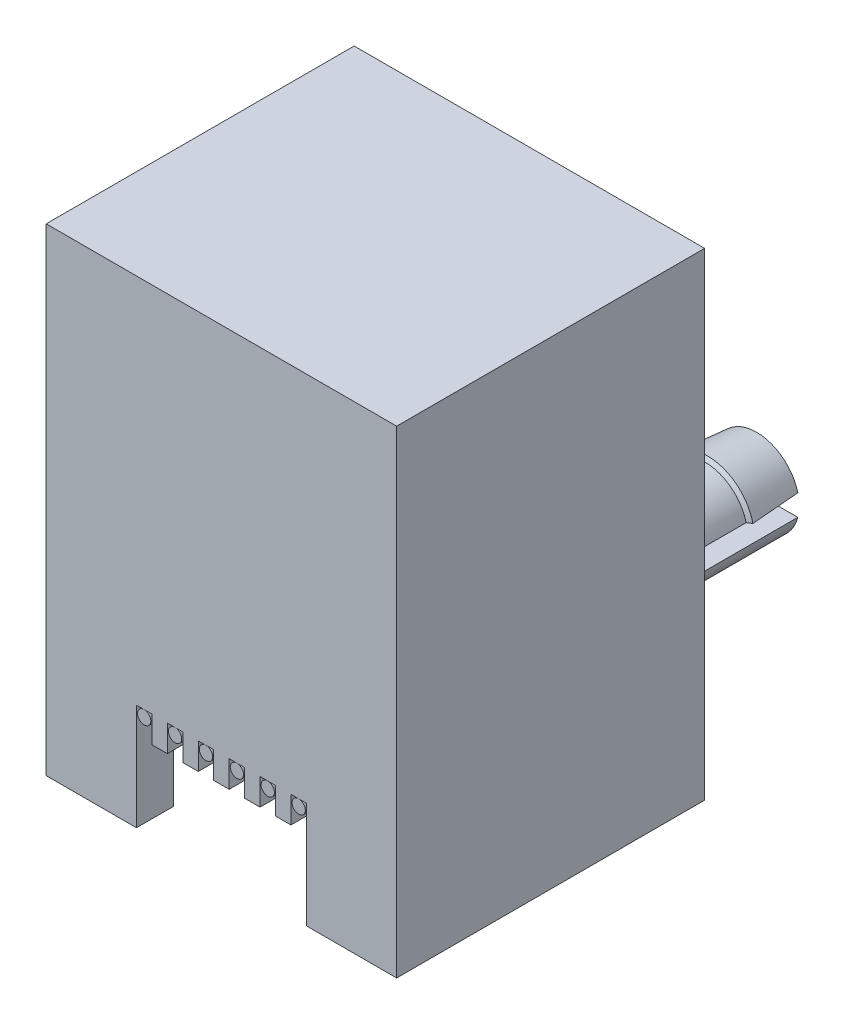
ISO-10303-21;
HEADER;
FILE_DESCRIPTION(('STEP AP214'),'2;1');
FILE_NAME('part.step','',(''),(''),'','','');
FILE_SCHEMA(('AUTOMOTIVE_DESIGN { 1 0 10303 214 1 1 1 1 }'));
ENDSEC;
DATA;
#1=APPLICATION_CONTEXT('core data for automotive mechanical design processes');
#2=APPLICATION_PROTOCOL_DEFINITION('international standard','automotive_design',2000,#1);
#3=PRODUCT_CONTEXT('',#1,'mechanical');
#4=PRODUCT('Part','Part','',(#3));
#5=PRODUCT_RELATED_PRODUCT_CATEGORY('part','',(#4));
#6=PRODUCT_DEFINITION_FORMATION('','',#4);
#7=PRODUCT_DEFINITION_CONTEXT('part definition',#1,'design');
#8=PRODUCT_DEFINITION('design','',#6,#7);
#9=PRODUCT_DEFINITION_SHAPE('','',#8);
#10=(LENGTH_UNIT() NAMED_UNIT(*) SI_UNIT(.MILLI.,.METRE.));
#11=(NAMED_UNIT(*) PLANE_ANGLE_UNIT() SI_UNIT($,.RADIAN.));
#12=(NAMED_UNIT(*) SI_UNIT($,.STERADIAN.) SOLID_ANGLE_UNIT());
#13=UNCERTAINTY_MEASURE_WITH_UNIT(LENGTH_MEASURE(1.E-05),#10,'distance_accuracy_value','');
#14=(GEOMETRIC_REPRESENTATION_CONTEXT(3) GLOBAL_UNCERTAINTY_ASSIGNED_CONTEXT((#13)) GLOBAL_UNIT_ASSIGNED_CONTEXT((#10,
#11,#12)) REPRESENTATION_CONTEXT('',''));
#15=CARTESIAN_POINT('',(0.,0.,0.));
#16=DIRECTION('',(0.,0.,1.));
#17=DIRECTION('',(1.,0.,0.));
#18=AXIS2_PLACEMENT_3D('',#15,#16,#17);
#19=CARTESIAN_POINT('',(2.90890909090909,-4.63023613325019,4.08094400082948));
#20=DIRECTION('',(0.,0.984807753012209,-0.173648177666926));
#21=DIRECTION('',(0.,0.173648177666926,0.984807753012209));
#22=AXIS2_PLACEMENT_3D('',#19,#20,#21);
#23=CYLINDRICAL_SURFACE('',#22,0.25);
#24=CARTESIAN_POINT('',(2.90890909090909,-4.63023613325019,4.08094400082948));
#25=DIRECTION('',(0.,-0.984807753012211,0.173648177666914));
#26=DIRECTION('',(1.,0.,0.));
#27=AXIS2_PLACEMENT_3D('',#24,#25,#26);
#28=CIRCLE('',#27,0.25);
#29=CARTESIAN_POINT('',(2.90890909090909,-4.67364817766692,3.83474206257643));
#30=VERTEX_POINT('',#29);
#31=EDGE_CURVE('E53',#30,#30,#28,.T.);
#32=ORIENTED_EDGE('',*,*,#31,.F.);
#33=EDGE_LOOP('',(#32));
#34=FACE_BOUND('',#33,.T.);
#35=CARTESIAN_POINT('',(2.90890909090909,1.55658795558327,2.9900399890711));
#36=DIRECTION('',(0.,-0.984807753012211,0.173648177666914));
#37=DIRECTION('',(1.,0.,0.));
#38=AXIS2_PLACEMENT_3D('',#35,#36,#37);
#39=CIRCLE('',#38,0.25);
#40=CARTESIAN_POINT('',(3.15890909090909,1.55658795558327,2.9900399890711));
#41=VERTEX_POINT('',#40);
#42=EDGE_CURVE('E12',#41,#41,#39,.T.);
#43=ORIENTED_EDGE('',*,*,#42,.T.);
#44=EDGE_LOOP('',(#43));
#45=FACE_BOUND('',#44,.T.);
#46=ADVANCED_FACE('F47',(#34,#45),#23,.T.);
#47=CARTESIAN_POINT('',(2.90890909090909,-4.5,4.81954981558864));
#48=DIRECTION('',(1.,0.,0.));
#49=DIRECTION('',(0.,0.,-1.));
#50=AXIS2_PLACEMENT_3D('',#47,#48,#49);
#51=TOROIDAL_SURFACE('',#50,0.750000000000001,0.25);
#52=CARTESIAN_POINT('',(2.90890909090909,-5.25,4.81954981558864));
#53=DIRECTION('',(0.,0.,1.));
#54=DIRECTION('',(1.,0.,0.));
#55=AXIS2_PLACEMENT_3D('',#52,#53,#54);
#56=CIRCLE('',#55,0.25);
#57=CARTESIAN_POINT('',(2.90890909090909,-5.5,4.81954981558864));
#58=VERTEX_POINT('',#57);
#59=EDGE_CURVE('E57',#58,#58,#56,.T.);
#60=CARTESIAN_POINT('',(2.90890909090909,-4.5,4.81954981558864));
#61=DIRECTION('',(1.,0.,0.));
#62=DIRECTION('',(0.,0.,-1.));
#63=AXIS2_PLACEMENT_3D('',#60,#61,#62);
#64=CIRCLE('',#63,1.);
#65=EDGE_CURVE('',#58,#30,#64,.T.);
#66=ORIENTED_EDGE('',*,*,#59,.F.);
#67=ORIENTED_EDGE('',*,*,#31,.T.);
#68=ORIENTED_EDGE('',*,*,#65,.T.);
#69=ORIENTED_EDGE('',*,*,#65,.F.);
#70=EDGE_LOOP('',(#66,#68,#67,#69));
#71=FACE_BOUND('',#70,.T.);
#72=ADVANCED_FACE('F72',(#71),#51,.T.);
#73=CARTESIAN_POINT('',(2.90890909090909,-5.25,4.81954981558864));
#74=DIRECTION('',(0.,0.,1.));
#75=DIRECTION('',(0.,-1.,0.));
#76=AXIS2_PLACEMENT_3D('',#73,#74,#75);
#77=CYLINDRICAL_SURFACE('',#76,0.25);
#78=ORIENTED_EDGE('',*,*,#59,.T.);
#79=EDGE_LOOP('',(#78));
#80=FACE_BOUND('',#79,.T.);
#81=CARTESIAN_POINT('',(2.90890909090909,-5.25,5.8));
#82=DIRECTION('',(0.,0.,1.));
#83=DIRECTION('',(1.,0.,0.));
#84=AXIS2_PLACEMENT_3D('',#81,#82,#83);
#85=CIRCLE('',#84,0.25);
#86=CARTESIAN_POINT('',(3.15890909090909,-5.25,5.8));
#87=VERTEX_POINT('',#86);
#88=EDGE_CURVE('E61',#87,#87,#85,.T.);
#89=ORIENTED_EDGE('',*,*,#88,.F.);
#90=EDGE_LOOP('',(#89));
#91=FACE_BOUND('',#90,.T.);
#92=ADVANCED_FACE('F69',(#80,#91),#77,.T.);
#93=CARTESIAN_POINT('',(2.90890909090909,1.55658795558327,2.9900399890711));
#94=DIRECTION('',(0.,-0.984807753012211,0.173648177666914));
#95=DIRECTION('',(1.,0.,0.));
#96=AXIS2_PLACEMENT_3D('',#93,#94,#95);
#97=PLANE('',#96);
#98=ORIENTED_EDGE('',*,*,#42,.F.);
#99=EDGE_LOOP('',(#98));
#100=FACE_BOUND('',#99,.T.);
#101=ADVANCED_FACE('F71',(#100),#97,.F.);
#102=CARTESIAN_POINT('',(2.90890909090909,-5.25,5.8));
#103=DIRECTION('',(0.,0.,1.));
#104=DIRECTION('',(1.,0.,0.));
#105=AXIS2_PLACEMENT_3D('',#102,#103,#104);
#106=PLANE('',#105);
#107=ORIENTED_EDGE('',*,*,#88,.T.);
#108=EDGE_LOOP('',(#107));
#109=FACE_BOUND('',#108,.T.);
#110=ADVANCED_FACE('F67',(#109),#106,.T.);
#111=CLOSED_SHELL('',(#46,#72,#92,#101,#110));
#112=MANIFOLD_SOLID_BREP('B2',#111);
#113=CARTESIAN_POINT('',(1.74530909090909,-4.63023613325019,4.08094400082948));
#114=DIRECTION('',(0.,0.984807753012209,-0.173648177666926));
#115=DIRECTION('',(0.,0.173648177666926,0.984807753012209));
#116=AXIS2_PLACEMENT_3D('',#113,#114,#115);
#117=CYLINDRICAL_SURFACE('',#116,0.25);
#118=CARTESIAN_POINT('',(1.74530909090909,-4.63023613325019,4.08094400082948));
#119=DIRECTION('',(0.,-0.984807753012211,0.173648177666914));
#120=DIRECTION('',(1.,0.,0.));
#121=AXIS2_PLACEMENT_3D('',#118,#119,#120);
#122=CIRCLE('',#121,0.25);
#123=CARTESIAN_POINT('',(1.74530909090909,-4.67364817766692,3.83474206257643));
#124=VERTEX_POINT('',#123);
#125=EDGE_CURVE('E131',#124,#124,#122,.T.);
#126=ORIENTED_EDGE('',*,*,#125,.F.);
#127=EDGE_LOOP('',(#126));
#128=FACE_BOUND('',#127,.T.);
#129=CARTESIAN_POINT('',(1.74530909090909,1.55658795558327,2.9900399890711));
#130=DIRECTION('',(0.,-0.984807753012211,0.173648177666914));
#131=DIRECTION('',(1.,0.,0.));
#132=AXIS2_PLACEMENT_3D('',#129,#130,#131);
#133=CIRCLE('',#132,0.25);
#134=CARTESIAN_POINT('',(1.99530909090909,1.55658795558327,2.9900399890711));
#135=VERTEX_POINT('',#134);
#136=EDGE_CURVE('E46',#135,#135,#133,.T.);
#137=ORIENTED_EDGE('',*,*,#136,.T.);
#138=EDGE_LOOP('',(#137));
#139=FACE_BOUND('',#138,.T.);
#140=ADVANCED_FACE('F125',(#128,#139),#117,.T.);
#141=CARTESIAN_POINT('',(1.74530909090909,-4.5,4.81954981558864));
#142=DIRECTION('',(1.,0.,0.));
#143=DIRECTION('',(0.,0.,-1.));
#144=AXIS2_PLACEMENT_3D('',#141,#142,#143);
#145=TOROIDAL_SURFACE('',#144,0.750000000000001,0.25);
#146=CARTESIAN_POINT('',(1.74530909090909,-5.25,4.81954981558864));
#147=DIRECTION('',(0.,0.,1.));
#148=DIRECTION('',(1.,0.,0.));
#149=AXIS2_PLACEMENT_3D('',#146,#147,#148);
#150=CIRCLE('',#149,0.25);
#151=CARTESIAN_POINT('',(1.74530909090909,-5.5,4.81954981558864));
#152=VERTEX_POINT('',#151);
#153=EDGE_CURVE('E135',#152,#152,#150,.T.);
#154=CARTESIAN_POINT('',(1.74530909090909,-4.5,4.81954981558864));
#155=DIRECTION('',(1.,0.,0.));
#156=DIRECTION('',(0.,0.,-1.));
#157=AXIS2_PLACEMENT_3D('',#154,#155,#156);
#158=CIRCLE('',#157,1.);
#159=EDGE_CURVE('',#152,#124,#158,.T.);
#160=ORIENTED_EDGE('',*,*,#153,.F.);
#161=ORIENTED_EDGE('',*,*,#125,.T.);
#162=ORIENTED_EDGE('',*,*,#159,.T.);
#163=ORIENTED_EDGE('',*,*,#159,.F.);
#164=EDGE_LOOP('',(#160,#162,#161,#163));
#165=FACE_BOUND('',#164,.T.);
#166=ADVANCED_FACE('F150',(#165),#145,.T.);
#167=CARTESIAN_POINT('',(1.74530909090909,-5.25,4.81954981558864));
#168=DIRECTION('',(0.,0.,1.));
#169=DIRECTION('',(0.,-1.,0.));
#170=AXIS2_PLACEMENT_3D('',#167,#168,#169);
#171=CYLINDRICAL_SURFACE('',#170,0.25);
#172=ORIENTED_EDGE('',*,*,#153,.T.);
#173=EDGE_LOOP('',(#172));
#174=FACE_BOUND('',#173,.T.);
#175=CARTESIAN_POINT('',(1.74530909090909,-5.25,5.8));
#176=DIRECTION('',(0.,0.,1.));
#177=DIRECTION('',(1.,0.,0.));
#178=AXIS2_PLACEMENT_3D('',#175,#176,#177);
#179=CIRCLE('',#178,0.25);
#180=CARTESIAN_POINT('',(1.99530909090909,-5.25,5.8));
#181=VERTEX_POINT('',#180);
#182=EDGE_CURVE('E139',#181,#181,#179,.T.);
#183=ORIENTED_EDGE('',*,*,#182,.F.);
#184=EDGE_LOOP('',(#183));
#185=FACE_BOUND('',#184,.T.);
#186=ADVANCED_FACE('F147',(#174,#185),#171,.T.);
#187=CARTESIAN_POINT('',(1.74530909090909,1.55658795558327,2.9900399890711));
#188=DIRECTION('',(0.,-0.984807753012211,0.173648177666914));
#189=DIRECTION('',(1.,0.,0.));
#190=AXIS2_PLACEMENT_3D('',#187,#188,#189);
#191=PLANE('',#190);
#192=ORIENTED_EDGE('',*,*,#136,.F.);
#193=EDGE_LOOP('',(#192));
#194=FACE_BOUND('',#193,.T.);
#195=ADVANCED_FACE('F149',(#194),#191,.F.);
#196=CARTESIAN_POINT('',(1.74530909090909,-5.25,5.8));
#197=DIRECTION('',(0.,0.,1.));
#198=DIRECTION('',(1.,0.,0.));
#199=AXIS2_PLACEMENT_3D('',#196,#197,#198);
#200=PLANE('',#199);
#201=ORIENTED_EDGE('',*,*,#182,.T.);
#202=EDGE_LOOP('',(#201));
#203=FACE_BOUND('',#202,.T.);
#204=ADVANCED_FACE('F145',(#203),#200,.T.);
#205=CLOSED_SHELL('',(#140,#166,#186,#195,#204));
#206=MANIFOLD_SOLID_BREP('B7',#205);
#207=CARTESIAN_POINT('',(0.581709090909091,-4.63023613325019,4.08094400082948));
#208=DIRECTION('',(0.,0.984807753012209,-0.173648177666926));
#209=DIRECTION('',(0.,0.173648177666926,0.984807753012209));
#210=AXIS2_PLACEMENT_3D('',#207,#208,#209);
#211=CYLINDRICAL_SURFACE('',#210,0.25);
#212=CARTESIAN_POINT('',(0.581709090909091,-4.63023613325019,4.08094400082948));
#213=DIRECTION('',(0.,-0.984807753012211,0.173648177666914));
#214=DIRECTION('',(1.,0.,0.));
#215=AXIS2_PLACEMENT_3D('',#212,#213,#214);
#216=CIRCLE('',#215,0.25);
#217=CARTESIAN_POINT('',(0.581709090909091,-4.67364817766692,3.83474206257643));
#218=VERTEX_POINT('',#217);
#219=EDGE_CURVE('E209',#218,#218,#216,.T.);
#220=ORIENTED_EDGE('',*,*,#219,.F.);
#221=EDGE_LOOP('',(#220));
#222=FACE_BOUND('',#221,.T.);
#223=CARTESIAN_POINT('',(0.581709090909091,1.55658795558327,2.9900399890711));
#224=DIRECTION('',(0.,-0.984807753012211,0.173648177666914));
#225=DIRECTION('',(1.,0.,0.));
#226=AXIS2_PLACEMENT_3D('',#223,#224,#225);
#227=CIRCLE('',#226,0.25);
#228=CARTESIAN_POINT('',(0.831709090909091,1.55658795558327,2.9900399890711));
#229=VERTEX_POINT('',#228);
#230=EDGE_CURVE('E124',#229,#229,#227,.T.);
#231=ORIENTED_EDGE('',*,*,#230,.T.);
#232=EDGE_LOOP('',(#231));
#233=FACE_BOUND('',#232,.T.);
#234=ADVANCED_FACE('F203',(#222,#233),#211,.T.);
#235=CARTESIAN_POINT('',(0.581709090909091,-4.5,4.81954981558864));
#236=DIRECTION('',(1.,0.,0.));
#237=DIRECTION('',(0.,0.,-1.));
#238=AXIS2_PLACEMENT_3D('',#235,#236,#237);
#239=TOROIDAL_SURFACE('',#238,0.750000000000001,0.25);
#240=CARTESIAN_POINT('',(0.581709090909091,-5.25,4.81954981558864));
#241=DIRECTION('',(0.,0.,1.));
#242=DIRECTION('',(1.,0.,0.));
#243=AXIS2_PLACEMENT_3D('',#240,#241,#242);
#244=CIRCLE('',#243,0.25);
#245=CARTESIAN_POINT('',(0.581709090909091,-5.5,4.81954981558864));
#246=VERTEX_POINT('',#245);
#247=EDGE_CURVE('E213',#246,#246,#244,.T.);
#248=CARTESIAN_POINT('',(0.581709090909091,-4.5,4.81954981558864));
#249=DIRECTION('',(1.,0.,0.));
#250=DIRECTION('',(0.,0.,-1.));
#251=AXIS2_PLACEMENT_3D('',#248,#249,#250);
#252=CIRCLE('',#251,1.);
#253=EDGE_CURVE('',#246,#218,#252,.T.);
#254=ORIENTED_EDGE('',*,*,#247,.F.);
#255=ORIENTED_EDGE('',*,*,#219,.T.);
#256=ORIENTED_EDGE('',*,*,#253,.T.);
#257=ORIENTED_EDGE('',*,*,#253,.F.);
#258=EDGE_LOOP('',(#254,#256,#255,#257));
#259=FACE_BOUND('',#258,.T.);
#260=ADVANCED_FACE('F228',(#259),#239,.T.);
#261=CARTESIAN_POINT('',(0.581709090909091,-5.25,4.81954981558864));
#262=DIRECTION('',(0.,0.,1.));
#263=DIRECTION('',(0.,-1.,0.));
#264=AXIS2_PLACEMENT_3D('',#261,#262,#263);
#265=CYLINDRICAL_SURFACE('',#264,0.25);
#266=ORIENTED_EDGE('',*,*,#247,.T.);
#267=EDGE_LOOP('',(#266));
#268=FACE_BOUND('',#267,.T.);
#269=CARTESIAN_POINT('',(0.581709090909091,-5.25,5.8));
#270=DIRECTION('',(0.,0.,1.));
#271=DIRECTION('',(1.,0.,0.));
#272=AXIS2_PLACEMENT_3D('',#269,#270,#271);
#273=CIRCLE('',#272,0.25);
#274=CARTESIAN_POINT('',(0.831709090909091,-5.25,5.8));
#275=VERTEX_POINT('',#274);
#276=EDGE_CURVE('E217',#275,#275,#273,.T.);
#277=ORIENTED_EDGE('',*,*,#276,.F.);
#278=EDGE_LOOP('',(#277));
#279=FACE_BOUND('',#278,.T.);
#280=ADVANCED_FACE('F225',(#268,#279),#265,.T.);
#281=CARTESIAN_POINT('',(0.581709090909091,1.55658795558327,2.9900399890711));
#282=DIRECTION('',(0.,-0.984807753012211,0.173648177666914));
#283=DIRECTION('',(1.,0.,0.));
#284=AXIS2_PLACEMENT_3D('',#281,#282,#283);
#285=PLANE('',#284);
#286=ORIENTED_EDGE('',*,*,#230,.F.);
#287=EDGE_LOOP('',(#286));
#288=FACE_BOUND('',#287,.T.);
#289=ADVANCED_FACE('F227',(#288),#285,.F.);
#290=CARTESIAN_POINT('',(0.581709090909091,-5.25,5.8));
#291=DIRECTION('',(0.,0.,1.));
#292=DIRECTION('',(1.,0.,0.));
#293=AXIS2_PLACEMENT_3D('',#290,#291,#292);
#294=PLANE('',#293);
#295=ORIENTED_EDGE('',*,*,#276,.T.);
#296=EDGE_LOOP('',(#295));
#297=FACE_BOUND('',#296,.T.);
#298=ADVANCED_FACE('F223',(#297),#294,.T.);
#299=CLOSED_SHELL('',(#234,#260,#280,#289,#298));
#300=MANIFOLD_SOLID_BREP('B41',#299);
#301=CARTESIAN_POINT('',(-0.581890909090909,-4.63023613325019,4.08094400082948));
#302=DIRECTION('',(0.,0.984807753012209,-0.173648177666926));
#303=DIRECTION('',(0.,0.173648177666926,0.984807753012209));
#304=AXIS2_PLACEMENT_3D('',#301,#302,#303);
#305=CYLINDRICAL_SURFACE('',#304,0.25);
#306=CARTESIAN_POINT('',(-0.581890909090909,-4.63023613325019,4.08094400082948));
#307=DIRECTION('',(0.,-0.984807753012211,0.173648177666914));
#308=DIRECTION('',(1.,0.,0.));
#309=AXIS2_PLACEMENT_3D('',#306,#307,#308);
#310=CIRCLE('',#309,0.25);
#311=CARTESIAN_POINT('',(-0.581890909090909,-4.67364817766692,3.83474206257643));
#312=VERTEX_POINT('',#311);
#313=EDGE_CURVE('E287',#312,#312,#310,.T.);
#314=ORIENTED_EDGE('',*,*,#313,.F.);
#315=EDGE_LOOP('',(#314));
#316=FACE_BOUND('',#315,.T.);
#317=CARTESIAN_POINT('',(-0.581890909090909,1.55658795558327,2.9900399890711));
#318=DIRECTION('',(0.,-0.984807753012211,0.173648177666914));
#319=DIRECTION('',(1.,0.,0.));
#320=AXIS2_PLACEMENT_3D('',#317,#318,#319);
#321=CIRCLE('',#320,0.25);
#322=CARTESIAN_POINT('',(-0.331890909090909,1.55658795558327,2.9900399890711));
#323=VERTEX_POINT('',#322);
#324=EDGE_CURVE('E202',#323,#323,#321,.T.);
#325=ORIENTED_EDGE('',*,*,#324,.T.);
#326=EDGE_LOOP('',(#325));
#327=FACE_BOUND('',#326,.T.);
#328=ADVANCED_FACE('F281',(#316,#327),#305,.T.);
#329=CARTESIAN_POINT('',(-0.581890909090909,-4.5,4.81954981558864));
#330=DIRECTION('',(1.,0.,0.));
#331=DIRECTION('',(0.,0.,-1.));
#332=AXIS2_PLACEMENT_3D('',#329,#330,#331);
#333=TOROIDAL_SURFACE('',#332,0.750000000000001,0.25);
#334=CARTESIAN_POINT('',(-0.581890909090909,-5.25,4.81954981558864));
#335=DIRECTION('',(0.,0.,1.));
#336=DIRECTION('',(1.,0.,0.));
#337=AXIS2_PLACEMENT_3D('',#334,#335,#336);
#338=CIRCLE('',#337,0.25);
#339=CARTESIAN_POINT('',(-0.581890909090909,-5.5,4.81954981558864));
#340=VERTEX_POINT('',#339);
#341=EDGE_CURVE('E291',#340,#340,#338,.T.);
#342=CARTESIAN_POINT('',(-0.581890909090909,-4.5,4.81954981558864));
#343=DIRECTION('',(1.,0.,0.));
#344=DIRECTION('',(0.,0.,-1.));
#345=AXIS2_PLACEMENT_3D('',#342,#343,#344);
#346=CIRCLE('',#345,1.);
#347=EDGE_CURVE('',#340,#312,#346,.T.);
#348=ORIENTED_EDGE('',*,*,#341,.F.);
#349=ORIENTED_EDGE('',*,*,#313,.T.);
#350=ORIENTED_EDGE('',*,*,#347,.T.);
#351=ORIENTED_EDGE('',*,*,#347,.F.);
#352=EDGE_LOOP('',(#348,#350,#349,#351));
#353=FACE_BOUND('',#352,.T.);
#354=ADVANCED_FACE('F306',(#353),#333,.T.);
#355=CARTESIAN_POINT('',(-0.581890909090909,-5.25,4.81954981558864));
#356=DIRECTION('',(0.,0.,1.));
#357=DIRECTION('',(0.,-1.,0.));
#358=AXIS2_PLACEMENT_3D('',#355,#356,#357);
#359=CYLINDRICAL_SURFACE('',#358,0.25);
#360=ORIENTED_EDGE('',*,*,#341,.T.);
#361=EDGE_LOOP('',(#360));
#362=FACE_BOUND('',#361,.T.);
#363=CARTESIAN_POINT('',(-0.581890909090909,-5.25,5.8));
#364=DIRECTION('',(0.,0.,1.));
#365=DIRECTION('',(1.,0.,0.));
#366=AXIS2_PLACEMENT_3D('',#363,#364,#365);
#367=CIRCLE('',#366,0.25);
#368=CARTESIAN_POINT('',(-0.331890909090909,-5.25,5.8));
#369=VERTEX_POINT('',#368);
#370=EDGE_CURVE('E295',#369,#369,#367,.T.);
#371=ORIENTED_EDGE('',*,*,#370,.F.);
#372=EDGE_LOOP('',(#371));
#373=FACE_BOUND('',#372,.T.);
#374=ADVANCED_FACE('F303',(#362,#373),#359,.T.);
#375=CARTESIAN_POINT('',(-0.581890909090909,1.55658795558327,2.9900399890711));
#376=DIRECTION('',(0.,-0.984807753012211,0.173648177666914));
#377=DIRECTION('',(1.,0.,0.));
#378=AXIS2_PLACEMENT_3D('',#375,#376,#377);
#379=PLANE('',#378);
#380=ORIENTED_EDGE('',*,*,#324,.F.);
#381=EDGE_LOOP('',(#380));
#382=FACE_BOUND('',#381,.T.);
#383=ADVANCED_FACE('F305',(#382),#379,.F.);
#384=CARTESIAN_POINT('',(-0.581890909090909,-5.25,5.8));
#385=DIRECTION('',(0.,0.,1.));
#386=DIRECTION('',(1.,0.,0.));
#387=AXIS2_PLACEMENT_3D('',#384,#385,#386);
#388=PLANE('',#387);
#389=ORIENTED_EDGE('',*,*,#370,.T.);
#390=EDGE_LOOP('',(#389));
#391=FACE_BOUND('',#390,.T.);
#392=ADVANCED_FACE('F301',(#391),#388,.T.);
#393=CLOSED_SHELL('',(#328,#354,#374,#383,#392));
#394=MANIFOLD_SOLID_BREP('B119',#393);
#395=CARTESIAN_POINT('',(-1.74549090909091,-4.63023613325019,4.08094400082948));
#396=DIRECTION('',(0.,0.984807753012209,-0.173648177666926));
#397=DIRECTION('',(0.,0.173648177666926,0.984807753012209));
#398=AXIS2_PLACEMENT_3D('',#395,#396,#397);
#399=CYLINDRICAL_SURFACE('',#398,0.25);
#400=CARTESIAN_POINT('',(-1.74549090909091,-4.63023613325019,4.08094400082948));
#401=DIRECTION('',(0.,-0.984807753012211,0.173648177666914));
#402=DIRECTION('',(1.,0.,0.));
#403=AXIS2_PLACEMENT_3D('',#400,#401,#402);
#404=CIRCLE('',#403,0.25);
#405=CARTESIAN_POINT('',(-1.74549090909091,-4.67364817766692,3.83474206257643));
#406=VERTEX_POINT('',#405);
#407=EDGE_CURVE('E365',#406,#406,#404,.T.);
#408=ORIENTED_EDGE('',*,*,#407,.F.);
#409=EDGE_LOOP('',(#408));
#410=FACE_BOUND('',#409,.T.);
#411=CARTESIAN_POINT('',(-1.74549090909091,1.55658795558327,2.9900399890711));
#412=DIRECTION('',(0.,-0.984807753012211,0.173648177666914));
#413=DIRECTION('',(1.,0.,0.));
#414=AXIS2_PLACEMENT_3D('',#411,#412,#413);
#415=CIRCLE('',#414,0.25);
#416=CARTESIAN_POINT('',(-1.49549090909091,1.55658795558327,2.9900399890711));
#417=VERTEX_POINT('',#416);
#418=EDGE_CURVE('E280',#417,#417,#415,.T.);
#419=ORIENTED_EDGE('',*,*,#418,.T.);
#420=EDGE_LOOP('',(#419));
#421=FACE_BOUND('',#420,.T.);
#422=ADVANCED_FACE('F359',(#410,#421),#399,.T.);
#423=CARTESIAN_POINT('',(-1.74549090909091,-4.5,4.81954981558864));
#424=DIRECTION('',(1.,0.,0.));
#425=DIRECTION('',(0.,0.,-1.));
#426=AXIS2_PLACEMENT_3D('',#423,#424,#425);
#427=TOROIDAL_SURFACE('',#426,0.750000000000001,0.25);
#428=CARTESIAN_POINT('',(-1.74549090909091,-5.25,4.81954981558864));
#429=DIRECTION('',(0.,0.,1.));
#430=DIRECTION('',(1.,0.,0.));
#431=AXIS2_PLACEMENT_3D('',#428,#429,#430);
#432=CIRCLE('',#431,0.25);
#433=CARTESIAN_POINT('',(-1.74549090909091,-5.5,4.81954981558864));
#434=VERTEX_POINT('',#433);
#435=EDGE_CURVE('E369',#434,#434,#432,.T.);
#436=CARTESIAN_POINT('',(-1.74549090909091,-4.5,4.81954981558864));
#437=DIRECTION('',(1.,0.,0.));
#438=DIRECTION('',(0.,0.,-1.));
#439=AXIS2_PLACEMENT_3D('',#436,#437,#438);
#440=CIRCLE('',#439,1.);
#441=EDGE_CURVE('',#434,#406,#440,.T.);
#442=ORIENTED_EDGE('',*,*,#435,.F.);
#443=ORIENTED_EDGE('',*,*,#407,.T.);
#444=ORIENTED_EDGE('',*,*,#441,.T.);
#445=ORIENTED_EDGE('',*,*,#441,.F.);
#446=EDGE_LOOP('',(#442,#444,#443,#445));
#447=FACE_BOUND('',#446,.T.);
#448=ADVANCED_FACE('F384',(#447),#427,.T.);
#449=CARTESIAN_POINT('',(-1.74549090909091,-5.25,4.81954981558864));
#450=DIRECTION('',(0.,0.,1.));
#451=DIRECTION('',(0.,-1.,0.));
#452=AXIS2_PLACEMENT_3D('',#449,#450,#451);
#453=CYLINDRICAL_SURFACE('',#452,0.25);
#454=ORIENTED_EDGE('',*,*,#435,.T.);
#455=EDGE_LOOP('',(#454));
#456=FACE_BOUND('',#455,.T.);
#457=CARTESIAN_POINT('',(-1.74549090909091,-5.25,5.8));
#458=DIRECTION('',(0.,0.,1.));
#459=DIRECTION('',(1.,0.,0.));
#460=AXIS2_PLACEMENT_3D('',#457,#458,#459);
#461=CIRCLE('',#460,0.25);
#462=CARTESIAN_POINT('',(-1.49549090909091,-5.25,5.8));
#463=VERTEX_POINT('',#462);
#464=EDGE_CURVE('E373',#463,#463,#461,.T.);
#465=ORIENTED_EDGE('',*,*,#464,.F.);
#466=EDGE_LOOP('',(#465));
#467=FACE_BOUND('',#466,.T.);
#468=ADVANCED_FACE('F381',(#456,#467),#453,.T.);
#469=CARTESIAN_POINT('',(-1.74549090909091,1.55658795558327,2.9900399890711));
#470=DIRECTION('',(0.,-0.984807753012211,0.173648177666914));
#471=DIRECTION('',(1.,0.,0.));
#472=AXIS2_PLACEMENT_3D('',#469,#470,#471);
#473=PLANE('',#472);
#474=ORIENTED_EDGE('',*,*,#418,.F.);
#475=EDGE_LOOP('',(#474));
#476=FACE_BOUND('',#475,.T.);
#477=ADVANCED_FACE('F383',(#476),#473,.F.);
#478=CARTESIAN_POINT('',(-1.74549090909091,-5.25,5.8));
#479=DIRECTION('',(0.,0.,1.));
#480=DIRECTION('',(1.,0.,0.));
#481=AXIS2_PLACEMENT_3D('',#478,#479,#480);
#482=PLANE('',#481);
#483=ORIENTED_EDGE('',*,*,#464,.T.);
#484=EDGE_LOOP('',(#483));
#485=FACE_BOUND('',#484,.T.);
#486=ADVANCED_FACE('F379',(#485),#482,.T.);
#487=CLOSED_SHELL('',(#422,#448,#468,#477,#486));
#488=MANIFOLD_SOLID_BREP('B197',#487);
#489=CARTESIAN_POINT('',(-2.90909090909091,-4.63023613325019,4.08094400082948));
#490=DIRECTION('',(0.,0.984807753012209,-0.173648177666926));
#491=DIRECTION('',(0.,0.173648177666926,0.984807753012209));
#492=AXIS2_PLACEMENT_3D('',#489,#490,#491);
#493=CYLINDRICAL_SURFACE('',#492,0.25);
#494=CARTESIAN_POINT('',(-2.90909090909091,-4.63023613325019,4.08094400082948));
#495=DIRECTION('',(0.,-0.984807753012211,0.173648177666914));
#496=DIRECTION('',(1.,0.,0.));
#497=AXIS2_PLACEMENT_3D('',#494,#495,#496);
#498=CIRCLE('',#497,0.25);
#499=CARTESIAN_POINT('',(-2.90909090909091,-4.67364817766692,3.83474206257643));
#500=VERTEX_POINT('',#499);
#501=EDGE_CURVE('E444',#500,#500,#498,.T.);
#502=ORIENTED_EDGE('',*,*,#501,.F.);
#503=EDGE_LOOP('',(#502));
#504=FACE_BOUND('',#503,.T.);
#505=CARTESIAN_POINT('',(-2.90909090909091,1.55658795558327,2.9900399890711));
#506=DIRECTION('',(0.,-0.984807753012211,0.173648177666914));
#507=DIRECTION('',(1.,0.,0.));
#508=AXIS2_PLACEMENT_3D('',#505,#506,#507);
#509=CIRCLE('',#508,0.25);
#510=CARTESIAN_POINT('',(-2.65909090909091,1.55658795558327,2.9900399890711));
#511=VERTEX_POINT('',#510);
#512=EDGE_CURVE('E358',#511,#511,#509,.T.);
#513=ORIENTED_EDGE('',*,*,#512,.T.);
#514=EDGE_LOOP('',(#513));
#515=FACE_BOUND('',#514,.T.);
#516=ADVANCED_FACE('F438',(#504,#515),#493,.T.);
#517=CARTESIAN_POINT('',(-2.90909090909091,-4.5,4.81954981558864));
#518=DIRECTION('',(1.,0.,0.));
#519=DIRECTION('',(0.,0.,-1.));
#520=AXIS2_PLACEMENT_3D('',#517,#518,#519);
#521=TOROIDAL_SURFACE('',#520,0.750000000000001,0.25);
#522=CARTESIAN_POINT('',(-2.90909090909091,-5.25,4.81954981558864));
#523=DIRECTION('',(0.,0.,1.));
#524=DIRECTION('',(1.,0.,0.));
#525=AXIS2_PLACEMENT_3D('',#522,#523,#524);
#526=CIRCLE('',#525,0.25);
#527=CARTESIAN_POINT('',(-2.90909090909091,-5.5,4.81954981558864));
#528=VERTEX_POINT('',#527);
#529=EDGE_CURVE('E448',#528,#528,#526,.T.);
#530=CARTESIAN_POINT('',(-2.90909090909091,-4.5,4.81954981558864));
#531=DIRECTION('',(1.,0.,0.));
#532=DIRECTION('',(0.,0.,-1.));
#533=AXIS2_PLACEMENT_3D('',#530,#531,#532);
#534=CIRCLE('',#533,1.);
#535=EDGE_CURVE('',#528,#500,#534,.T.);
#536=ORIENTED_EDGE('',*,*,#529,.F.);
#537=ORIENTED_EDGE('',*,*,#501,.T.);
#538=ORIENTED_EDGE('',*,*,#535,.T.);
#539=ORIENTED_EDGE('',*,*,#535,.F.);
#540=EDGE_LOOP('',(#536,#538,#537,#539));
#541=FACE_BOUND('',#540,.T.);
#542=ADVANCED_FACE('F463',(#541),#521,.T.);
#543=CARTESIAN_POINT('',(-2.90909090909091,-5.25,4.81954981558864));
#544=DIRECTION('',(0.,0.,1.));
#545=DIRECTION('',(0.,-1.,0.));
#546=AXIS2_PLACEMENT_3D('',#543,#544,#545);
#547=CYLINDRICAL_SURFACE('',#546,0.25);
#548=ORIENTED_EDGE('',*,*,#529,.T.);
#549=EDGE_LOOP('',(#548));
#550=FACE_BOUND('',#549,.T.);
#551=CARTESIAN_POINT('',(-2.90909090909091,-5.25,5.8));
#552=DIRECTION('',(0.,0.,1.));
#553=DIRECTION('',(1.,0.,0.));
#554=AXIS2_PLACEMENT_3D('',#551,#552,#553);
#555=CIRCLE('',#554,0.25);
#556=CARTESIAN_POINT('',(-2.65909090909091,-5.25,5.8));
#557=VERTEX_POINT('',#556);
#558=EDGE_CURVE('E452',#557,#557,#555,.T.);
#559=ORIENTED_EDGE('',*,*,#558,.F.);
#560=EDGE_LOOP('',(#559));
#561=FACE_BOUND('',#560,.T.);
#562=ADVANCED_FACE('F460',(#550,#561),#547,.T.);
#563=CARTESIAN_POINT('',(-2.90909090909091,1.55658795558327,2.9900399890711));
#564=DIRECTION('',(0.,-0.984807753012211,0.173648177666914));
#565=DIRECTION('',(1.,0.,0.));
#566=AXIS2_PLACEMENT_3D('',#563,#564,#565);
#567=PLANE('',#566);
#568=ORIENTED_EDGE('',*,*,#512,.F.);
#569=EDGE_LOOP('',(#568));
#570=FACE_BOUND('',#569,.T.);
#571=ADVANCED_FACE('F462',(#570),#567,.F.);
#572=CARTESIAN_POINT('',(-2.90909090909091,-5.25,5.8));
#573=DIRECTION('',(0.,0.,1.));
#574=DIRECTION('',(1.,0.,0.));
#575=AXIS2_PLACEMENT_3D('',#572,#573,#574);
#576=PLANE('',#575);
#577=ORIENTED_EDGE('',*,*,#558,.T.);
#578=EDGE_LOOP('',(#577));
#579=FACE_BOUND('',#578,.T.);
#580=ADVANCED_FACE('F458',(#579),#576,.T.);
#581=CLOSED_SHELL('',(#516,#542,#562,#571,#580));
#582=MANIFOLD_SOLID_BREP('B275',#581);
#583=CARTESIAN_POINT('',(-3.3,1.3,0.));
#584=DIRECTION('',(0.,0.,1.));
#585=DIRECTION('',(1.,0.,0.));
#586=AXIS2_PLACEMENT_3D('',#583,#584,#585);
#587=PLANE('',#586);
#588=DIRECTION('',(-1.,0.,0.));
#589=VECTOR('',#588,1.);
#590=CARTESIAN_POINT('',(-3.3,1.3,0.));
#591=LINE('',#590,#589);
#592=CARTESIAN_POINT('',(-3.2,1.3,0.));
#593=VERTEX_POINT('',#592);
#594=CARTESIAN_POINT('',(-3.3,1.3,0.));
#595=VERTEX_POINT('',#594);
#596=EDGE_CURVE('E1330',#593,#595,#591,.T.);
#597=ORIENTED_EDGE('',*,*,#596,.F.);
#598=DIRECTION('',(0.,-1.,0.));
#599=VECTOR('',#598,1.);
#600=CARTESIAN_POINT('',(-3.2,1.3,0.));
#601=LINE('',#600,#599);
#602=CARTESIAN_POINT('',(-3.2,1.,0.));
#603=VERTEX_POINT('',#602);
#604=EDGE_CURVE('E1160',#593,#603,#601,.T.);
#605=ORIENTED_EDGE('',*,*,#604,.T.);
#606=DIRECTION('',(-1.,0.,0.));
#607=VECTOR('',#606,1.);
#608=CARTESIAN_POINT('',(-3.3,1.,0.));
#609=LINE('',#608,#607);
#610=CARTESIAN_POINT('',(-3.3,1.,0.));
#611=VERTEX_POINT('',#610);
#612=EDGE_CURVE('E1343',#603,#611,#609,.T.);
#613=ORIENTED_EDGE('',*,*,#612,.T.);
#614=DIRECTION('',(0.,-1.,0.));
#615=VECTOR('',#614,1.);
#616=CARTESIAN_POINT('',(-3.3,1.3,0.));
#617=LINE('',#616,#615);
#618=EDGE_CURVE('E1353',#595,#611,#617,.T.);
#619=ORIENTED_EDGE('',*,*,#618,.F.);
#620=EDGE_LOOP('',(#597,#605,#613,#619));
#621=FACE_BOUND('',#620,.T.);
#622=ADVANCED_FACE('F508',(#621),#587,.F.);
#623=CARTESIAN_POINT('',(5.2,1.,4.4));
#624=DIRECTION('',(0.,-1.,0.));
#625=DIRECTION('',(0.,0.,-1.));
#626=AXIS2_PLACEMENT_3D('',#623,#624,#625);
#627=PLANE('',#626);
#628=DIRECTION('',(0.,0.,-1.));
#629=VECTOR('',#628,1.);
#630=CARTESIAN_POINT('',(-3.2,1.,4.4));
#631=LINE('',#630,#629);
#632=CARTESIAN_POINT('',(-3.2,1.,4.4));
#633=VERTEX_POINT('',#632);
#634=EDGE_CURVE('E1145',#633,#603,#631,.T.);
#635=ORIENTED_EDGE('',*,*,#634,.F.);
#636=DIRECTION('',(-1.,0.,0.));
#637=VECTOR('',#636,1.);
#638=CARTESIAN_POINT('',(5.2,1.,4.4));
#639=LINE('',#638,#637);
#640=CARTESIAN_POINT('',(-5.2,1.,4.4));
#641=VERTEX_POINT('',#640);
#642=EDGE_CURVE('E1646',#633,#641,#639,.T.);
#643=ORIENTED_EDGE('',*,*,#642,.T.);
#644=DIRECTION('',(0.,0.,-1.));
#645=VECTOR('',#644,1.);
#646=CARTESIAN_POINT('',(-5.2,1.,-2.8));
#647=LINE('',#646,#645);
#648=CARTESIAN_POINT('',(-5.2,1.,-2.8));
#649=VERTEX_POINT('',#648);
#650=EDGE_CURVE('E1643',#641,#649,#647,.T.);
#651=ORIENTED_EDGE('',*,*,#650,.T.);
#652=DIRECTION('',(1.,0.,0.));
#653=VECTOR('',#652,1.);
#654=CARTESIAN_POINT('',(-5.2,1.,-2.8));
#655=LINE('',#654,#653);
#656=CARTESIAN_POINT('',(-3.8,1.,-2.8));
#657=VERTEX_POINT('',#656);
#658=EDGE_CURVE('E1648',#649,#657,#655,.T.);
#659=ORIENTED_EDGE('',*,*,#658,.T.);
#660=DIRECTION('',(0.,0.,-1.));
#661=VECTOR('',#660,1.);
#662=CARTESIAN_POINT('',(-3.8,1.,-4.6));
#663=LINE('',#662,#661);
#664=CARTESIAN_POINT('',(-3.8,1.,-4.6));
#665=VERTEX_POINT('',#664);
#666=EDGE_CURVE('E2246',#657,#665,#663,.T.);
#667=ORIENTED_EDGE('',*,*,#666,.T.);
#668=DIRECTION('',(1.,0.,0.));
#669=VECTOR('',#668,1.);
#670=CARTESIAN_POINT('',(3.8,1.,-4.6));
#671=LINE('',#670,#669);
#672=CARTESIAN_POINT('',(3.8,1.,-4.6));
#673=VERTEX_POINT('',#672);
#674=EDGE_CURVE('E2248',#665,#673,#671,.T.);
#675=ORIENTED_EDGE('',*,*,#674,.T.);
#676=DIRECTION('',(0.,0.,1.));
#677=VECTOR('',#676,1.);
#678=CARTESIAN_POINT('',(3.8,1.,-4.6));
#679=LINE('',#678,#677);
#680=CARTESIAN_POINT('',(3.8,1.,-2.8));
#681=VERTEX_POINT('',#680);
#682=EDGE_CURVE('E2252',#673,#681,#679,.T.);
#683=ORIENTED_EDGE('',*,*,#682,.T.);
#684=DIRECTION('',(1.,0.,0.));
#685=VECTOR('',#684,1.);
#686=CARTESIAN_POINT('',(5.2,1.,-2.8));
#687=LINE('',#686,#685);
#688=CARTESIAN_POINT('',(5.2,1.,-2.8));
#689=VERTEX_POINT('',#688);
#690=EDGE_CURVE('E2255',#681,#689,#687,.T.);
#691=ORIENTED_EDGE('',*,*,#690,.T.);
#692=DIRECTION('',(0.,0.,1.));
#693=VECTOR('',#692,1.);
#694=CARTESIAN_POINT('',(5.2,1.,-2.8));
#695=LINE('',#694,#693);
#696=CARTESIAN_POINT('',(5.2,1.,4.4));
#697=VERTEX_POINT('',#696);
#698=EDGE_CURVE('E1640',#689,#697,#695,.T.);
#699=ORIENTED_EDGE('',*,*,#698,.T.);
#700=CARTESIAN_POINT('',(3.2,1.,4.4));
#701=VERTEX_POINT('',#700);
#702=EDGE_CURVE('E1637',#697,#701,#639,.T.);
#703=ORIENTED_EDGE('',*,*,#702,.T.);
#704=DIRECTION('',(0.,0.,1.));
#705=VECTOR('',#704,1.);
#706=CARTESIAN_POINT('',(3.2,1.,4.4));
#707=LINE('',#706,#705);
#708=CARTESIAN_POINT('',(3.2,1.,0.));
#709=VERTEX_POINT('',#708);
#710=EDGE_CURVE('E1295',#709,#701,#707,.T.);
#711=ORIENTED_EDGE('',*,*,#710,.F.);
#712=CARTESIAN_POINT('',(3.3,1.,0.));
#713=VERTEX_POINT('',#712);
#714=EDGE_CURVE('E1344',#713,#709,#609,.T.);
#715=ORIENTED_EDGE('',*,*,#714,.F.);
#716=DIRECTION('',(0.,0.,1.));
#717=VECTOR('',#716,1.);
#718=CARTESIAN_POINT('',(3.3,1.,0.));
#719=LINE('',#718,#717);
#720=CARTESIAN_POINT('',(3.3,1.,-4.1));
#721=VERTEX_POINT('',#720);
#722=EDGE_CURVE('E1340',#721,#713,#719,.T.);
#723=ORIENTED_EDGE('',*,*,#722,.F.);
#724=DIRECTION('',(1.,0.,0.));
#725=VECTOR('',#724,1.);
#726=CARTESIAN_POINT('',(3.3,1.,-4.1));
#727=LINE('',#726,#725);
#728=CARTESIAN_POINT('',(-3.3,1.,-4.1));
#729=VERTEX_POINT('',#728);
#730=EDGE_CURVE('E1322',#729,#721,#727,.T.);
#731=ORIENTED_EDGE('',*,*,#730,.F.);
#732=DIRECTION('',(0.,0.,-1.));
#733=VECTOR('',#732,1.);
#734=CARTESIAN_POINT('',(-3.3,1.,-4.1));
#735=LINE('',#734,#733);
#736=EDGE_CURVE('E1327',#611,#729,#735,.T.);
#737=ORIENTED_EDGE('',*,*,#736,.F.);
#738=ORIENTED_EDGE('',*,*,#612,.F.);
#739=EDGE_LOOP('',(#635,#643,#651,#659,#667,#675,#683,#691,#699,#703,#711,#715,#723,#731,#737,#738));
#740=FACE_BOUND('',#739,.T.);
#741=ADVANCED_FACE('F1634',(#740),#627,.T.);
#742=CARTESIAN_POINT('',(-2.03636363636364,1.,0.));
#743=VERTEX_POINT('',#742);
#744=CARTESIAN_POINT('',(-2.61818181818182,1.,0.));
#745=VERTEX_POINT('',#744);
#746=EDGE_CURVE('E1600',#743,#745,#609,.T.);
#747=ORIENTED_EDGE('',*,*,#746,.T.);
#748=DIRECTION('',(0.,1.,0.));
#749=VECTOR('',#748,1.);
#750=CARTESIAN_POINT('',(-2.61818181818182,1.3,0.));
#751=LINE('',#750,#749);
#752=CARTESIAN_POINT('',(-2.61818181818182,1.3,0.));
#753=VERTEX_POINT('',#752);
#754=EDGE_CURVE('E1153',#745,#753,#751,.T.);
#755=ORIENTED_EDGE('',*,*,#754,.T.);
#756=CARTESIAN_POINT('',(-2.03636363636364,1.3,0.));
#757=VERTEX_POINT('',#756);
#758=EDGE_CURVE('E1598',#757,#753,#591,.T.);
#759=ORIENTED_EDGE('',*,*,#758,.F.);
#760=DIRECTION('',(0.,-1.,0.));
#761=VECTOR('',#760,1.);
#762=CARTESIAN_POINT('',(-2.03636363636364,1.3,0.));
#763=LINE('',#762,#761);
#764=EDGE_CURVE('E1191',#757,#743,#763,.T.);
#765=ORIENTED_EDGE('',*,*,#764,.T.);
#766=EDGE_LOOP('',(#747,#755,#759,#765));
#767=FACE_BOUND('',#766,.T.);
#768=ADVANCED_FACE('F1597',(#767),#587,.F.);
#769=DIRECTION('',(0.,0.,1.));
#770=VECTOR('',#769,1.);
#771=CARTESIAN_POINT('',(-2.61818181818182,1.,-2.05));
#772=LINE('',#771,#770);
#773=CARTESIAN_POINT('',(-2.61818181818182,1.,4.4));
#774=VERTEX_POINT('',#773);
#775=EDGE_CURVE('E1143',#745,#774,#772,.T.);
#776=ORIENTED_EDGE('',*,*,#775,.F.);
#777=ORIENTED_EDGE('',*,*,#746,.F.);
#778=DIRECTION('',(0.,0.,-1.));
#779=VECTOR('',#778,1.);
#780=CARTESIAN_POINT('',(-2.03636363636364,1.,4.4));
#781=LINE('',#780,#779);
#782=CARTESIAN_POINT('',(-2.03636363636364,1.,4.4));
#783=VERTEX_POINT('',#782);
#784=EDGE_CURVE('E1163',#783,#743,#781,.T.);
#785=ORIENTED_EDGE('',*,*,#784,.F.);
#786=EDGE_CURVE('E1653',#783,#774,#639,.T.);
#787=ORIENTED_EDGE('',*,*,#786,.T.);
#788=EDGE_LOOP('',(#776,#777,#785,#787));
#789=FACE_BOUND('',#788,.T.);
#790=ADVANCED_FACE('F1918',(#789),#627,.T.);
#791=CARTESIAN_POINT('',(-0.872727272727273,1.,0.));
#792=VERTEX_POINT('',#791);
#793=CARTESIAN_POINT('',(-1.45454545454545,1.,0.));
#794=VERTEX_POINT('',#793);
#795=EDGE_CURVE('E1965',#792,#794,#609,.T.);
#796=ORIENTED_EDGE('',*,*,#795,.T.);
#797=DIRECTION('',(0.,1.,0.));
#798=VECTOR('',#797,1.);
#799=CARTESIAN_POINT('',(-1.45454545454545,1.3,0.));
#800=LINE('',#799,#798);
#801=CARTESIAN_POINT('',(-1.45454545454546,1.3,0.));
#802=VERTEX_POINT('',#801);
#803=EDGE_CURVE('E1181',#794,#802,#800,.T.);
#804=ORIENTED_EDGE('',*,*,#803,.T.);
#805=CARTESIAN_POINT('',(-0.872727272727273,1.3,0.));
#806=VERTEX_POINT('',#805);
#807=EDGE_CURVE('E1604',#806,#802,#591,.T.);
#808=ORIENTED_EDGE('',*,*,#807,.F.);
#809=DIRECTION('',(0.,-1.,0.));
#810=VECTOR('',#809,1.);
#811=CARTESIAN_POINT('',(-0.872727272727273,1.3,0.));
#812=LINE('',#811,#810);
#813=EDGE_CURVE('E1223',#806,#792,#812,.T.);
#814=ORIENTED_EDGE('',*,*,#813,.T.);
#815=EDGE_LOOP('',(#796,#804,#808,#814));
#816=FACE_BOUND('',#815,.T.);
#817=ADVANCED_FACE('F1922',(#816),#587,.F.);
#818=DIRECTION('',(0.,0.,1.));
#819=VECTOR('',#818,1.);
#820=CARTESIAN_POINT('',(-1.45454545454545,1.,-2.05));
#821=LINE('',#820,#819);
#822=CARTESIAN_POINT('',(-1.45454545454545,1.,4.4));
#823=VERTEX_POINT('',#822);
#824=EDGE_CURVE('E1168',#794,#823,#821,.T.);
#825=ORIENTED_EDGE('',*,*,#824,.F.);
#826=ORIENTED_EDGE('',*,*,#795,.F.);
#827=DIRECTION('',(0.,0.,-1.));
#828=VECTOR('',#827,1.);
#829=CARTESIAN_POINT('',(-0.872727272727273,1.,4.4));
#830=LINE('',#829,#828);
#831=CARTESIAN_POINT('',(-0.872727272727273,1.,4.4));
#832=VERTEX_POINT('',#831);
#833=EDGE_CURVE('E1194',#832,#792,#830,.T.);
#834=ORIENTED_EDGE('',*,*,#833,.F.);
#835=EDGE_CURVE('E1657',#832,#823,#639,.T.);
#836=ORIENTED_EDGE('',*,*,#835,.T.);
#837=EDGE_LOOP('',(#825,#826,#834,#836));
#838=FACE_BOUND('',#837,.T.);
#839=ADVANCED_FACE('F1948',(#838),#627,.T.);
#840=CARTESIAN_POINT('',(0.290909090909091,1.,0.));
#841=VERTEX_POINT('',#840);
#842=CARTESIAN_POINT('',(-0.290909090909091,1.,0.));
#843=VERTEX_POINT('',#842);
#844=EDGE_CURVE('E1969',#841,#843,#609,.T.);
#845=ORIENTED_EDGE('',*,*,#844,.T.);
#846=DIRECTION('',(0.,1.,0.));
#847=VECTOR('',#846,1.);
#848=CARTESIAN_POINT('',(-0.290909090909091,1.3,0.));
#849=LINE('',#848,#847);
#850=CARTESIAN_POINT('',(-0.290909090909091,1.3,0.));
#851=VERTEX_POINT('',#850);
#852=EDGE_CURVE('E1213',#843,#851,#849,.T.);
#853=ORIENTED_EDGE('',*,*,#852,.T.);
#854=CARTESIAN_POINT('',(0.290909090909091,1.3,0.));
#855=VERTEX_POINT('',#854);
#856=EDGE_CURVE('E1606',#855,#851,#591,.T.);
#857=ORIENTED_EDGE('',*,*,#856,.F.);
#858=DIRECTION('',(0.,-1.,0.));
#859=VECTOR('',#858,1.);
#860=CARTESIAN_POINT('',(0.29090909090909,1.3,0.));
#861=LINE('',#860,#859);
#862=EDGE_CURVE('E1255',#855,#841,#861,.T.);
#863=ORIENTED_EDGE('',*,*,#862,.T.);
#864=EDGE_LOOP('',(#845,#853,#857,#863));
#865=FACE_BOUND('',#864,.T.);
#866=ADVANCED_FACE('F1943',(#865),#587,.F.);
#867=DIRECTION('',(0.,0.,1.));
#868=VECTOR('',#867,1.);
#869=CARTESIAN_POINT('',(-0.290909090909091,1.,-2.05));
#870=LINE('',#869,#868);
#871=CARTESIAN_POINT('',(-0.290909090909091,1.,4.4));
#872=VERTEX_POINT('',#871);
#873=EDGE_CURVE('E1199',#843,#872,#870,.T.);
#874=ORIENTED_EDGE('',*,*,#873,.F.);
#875=ORIENTED_EDGE('',*,*,#844,.F.);
#876=DIRECTION('',(0.,0.,-1.));
#877=VECTOR('',#876,1.);
#878=CARTESIAN_POINT('',(0.290909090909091,1.,4.4));
#879=LINE('',#878,#877);
#880=CARTESIAN_POINT('',(0.290909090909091,1.,4.4));
#881=VERTEX_POINT('',#880);
#882=EDGE_CURVE('E1226',#881,#841,#879,.T.);
#883=ORIENTED_EDGE('',*,*,#882,.F.);
#884=EDGE_CURVE('E2011',#881,#872,#639,.T.);
#885=ORIENTED_EDGE('',*,*,#884,.T.);
#886=EDGE_LOOP('',(#874,#875,#883,#885));
#887=FACE_BOUND('',#886,.T.);
#888=ADVANCED_FACE('F1939',(#887),#627,.T.);
#889=CARTESIAN_POINT('',(1.45454545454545,1.,0.));
#890=VERTEX_POINT('',#889);
#891=CARTESIAN_POINT('',(0.872727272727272,1.,0.));
#892=VERTEX_POINT('',#891);
#893=EDGE_CURVE('E1970',#890,#892,#609,.T.);
#894=ORIENTED_EDGE('',*,*,#893,.T.);
#895=DIRECTION('',(0.,1.,0.));
#896=VECTOR('',#895,1.);
#897=CARTESIAN_POINT('',(0.872727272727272,1.3,0.));
#898=LINE('',#897,#896);
#899=CARTESIAN_POINT('',(0.872727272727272,1.3,0.));
#900=VERTEX_POINT('',#899);
#901=EDGE_CURVE('E1245',#892,#900,#898,.T.);
#902=ORIENTED_EDGE('',*,*,#901,.T.);
#903=CARTESIAN_POINT('',(1.45454545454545,1.3,0.));
#904=VERTEX_POINT('',#903);
#905=EDGE_CURVE('E1995',#904,#900,#591,.T.);
#906=ORIENTED_EDGE('',*,*,#905,.F.);
#907=DIRECTION('',(0.,-1.,0.));
#908=VECTOR('',#907,1.);
#909=CARTESIAN_POINT('',(1.45454545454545,1.3,0.));
#910=LINE('',#909,#908);
#911=EDGE_CURVE('E1287',#904,#890,#910,.T.);
#912=ORIENTED_EDGE('',*,*,#911,.T.);
#913=EDGE_LOOP('',(#894,#902,#906,#912));
#914=FACE_BOUND('',#913,.T.);
#915=ADVANCED_FACE('F1931',(#914),#587,.F.);
#916=DIRECTION('',(0.,0.,1.));
#917=VECTOR('',#916,1.);
#918=CARTESIAN_POINT('',(0.872727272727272,1.,-2.05));
#919=LINE('',#918,#917);
#920=CARTESIAN_POINT('',(0.872727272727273,1.,4.4));
#921=VERTEX_POINT('',#920);
#922=EDGE_CURVE('E1231',#892,#921,#919,.T.);
#923=ORIENTED_EDGE('',*,*,#922,.F.);
#924=ORIENTED_EDGE('',*,*,#893,.F.);
#925=DIRECTION('',(0.,0.,-1.));
#926=VECTOR('',#925,1.);
#927=CARTESIAN_POINT('',(1.45454545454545,1.,4.4));
#928=LINE('',#927,#926);
#929=CARTESIAN_POINT('',(1.45454545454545,1.,4.4));
#930=VERTEX_POINT('',#929);
#931=EDGE_CURVE('E1258',#930,#890,#928,.T.);
#932=ORIENTED_EDGE('',*,*,#931,.F.);
#933=EDGE_CURVE('E1651',#930,#921,#639,.T.);
#934=ORIENTED_EDGE('',*,*,#933,.T.);
#935=EDGE_LOOP('',(#923,#924,#932,#934));
#936=FACE_BOUND('',#935,.T.);
#937=ADVANCED_FACE('F1859',(#936),#627,.T.);
#938=CARTESIAN_POINT('',(2.61818181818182,1.,0.));
#939=VERTEX_POINT('',#938);
#940=CARTESIAN_POINT('',(2.03636363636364,1.,0.));
#941=VERTEX_POINT('',#940);
#942=EDGE_CURVE('E1347',#939,#941,#609,.T.);
#943=ORIENTED_EDGE('',*,*,#942,.T.);
#944=DIRECTION('',(0.,1.,0.));
#945=VECTOR('',#944,1.);
#946=CARTESIAN_POINT('',(2.03636363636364,1.3,0.));
#947=LINE('',#946,#945);
#948=CARTESIAN_POINT('',(2.03636363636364,1.3,0.));
#949=VERTEX_POINT('',#948);
#950=EDGE_CURVE('E1277',#941,#949,#947,.T.);
#951=ORIENTED_EDGE('',*,*,#950,.T.);
#952=CARTESIAN_POINT('',(2.61818181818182,1.3,0.));
#953=VERTEX_POINT('',#952);
#954=EDGE_CURVE('E1335',#953,#949,#591,.T.);
#955=ORIENTED_EDGE('',*,*,#954,.F.);
#956=DIRECTION('',(0.,-1.,0.));
#957=VECTOR('',#956,1.);
#958=CARTESIAN_POINT('',(2.61818181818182,1.3,0.));
#959=LINE('',#958,#957);
#960=EDGE_CURVE('E1319',#953,#939,#959,.T.);
#961=ORIENTED_EDGE('',*,*,#960,.T.);
#962=EDGE_LOOP('',(#943,#951,#955,#961));
#963=FACE_BOUND('',#962,.T.);
#964=ADVANCED_FACE('F1924',(#963),#587,.F.);
#965=CARTESIAN_POINT('',(-3.2,-6.,-2.66823881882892));
#966=DIRECTION('',(0.,1.,0.));
#967=DIRECTION('',(0.,0.,1.));
#968=AXIS2_PLACEMENT_3D('',#965,#966,#967);
#969=PLANE('',#968);
#970=DIRECTION('',(1.,0.,0.));
#971=VECTOR('',#970,1.);
#972=CARTESIAN_POINT('',(-3.2,-6.,4.4));
#973=LINE('',#972,#971);
#974=CARTESIAN_POINT('',(0.872727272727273,-6.,4.4));
#975=VERTEX_POINT('',#974);
#976=CARTESIAN_POINT('',(1.45454545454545,-6.,4.4));
#977=VERTEX_POINT('',#976);
#978=EDGE_CURVE('E3075',#975,#977,#973,.T.);
#979=ORIENTED_EDGE('',*,*,#978,.T.);
#980=DIRECTION('',(0.,0.,-1.));
#981=VECTOR('',#980,1.);
#982=CARTESIAN_POINT('',(1.45454545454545,-6.,6.95694096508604));
#983=LINE('',#982,#981);
#984=CARTESIAN_POINT('',(1.45454545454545,-6.,5.8));
#985=VERTEX_POINT('',#984);
#986=EDGE_CURVE('E1380',#985,#977,#983,.T.);
#987=ORIENTED_EDGE('',*,*,#986,.F.);
#988=DIRECTION('',(-1.,0.,0.));
#989=VECTOR('',#988,1.);
#990=CARTESIAN_POINT('',(-3.2,-6.,5.8));
#991=LINE('',#990,#989);
#992=CARTESIAN_POINT('',(0.872727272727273,-6.,5.8));
#993=VERTEX_POINT('',#992);
#994=EDGE_CURVE('E1677',#985,#993,#991,.T.);
#995=ORIENTED_EDGE('',*,*,#994,.T.);
#996=DIRECTION('',(0.,0.,-1.));
#997=VECTOR('',#996,1.);
#998=CARTESIAN_POINT('',(0.872727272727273,-6.,6.95694096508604));
#999=LINE('',#998,#997);
#1000=EDGE_CURVE('E1415',#993,#975,#999,.T.);
#1001=ORIENTED_EDGE('',*,*,#1000,.T.);
#1002=EDGE_LOOP('',(#979,#987,#995,#1001));
#1003=FACE_BOUND('',#1002,.T.);
#1004=ADVANCED_FACE('F1850',(#1003),#969,.F.);
#1005=CARTESIAN_POINT('',(-0.290909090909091,-6.,4.4));
#1006=VERTEX_POINT('',#1005);
#1007=CARTESIAN_POINT('',(0.290909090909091,-6.,4.4));
#1008=VERTEX_POINT('',#1007);
#1009=EDGE_CURVE('E3070',#1006,#1008,#973,.T.);
#1010=ORIENTED_EDGE('',*,*,#1009,.T.);
#1011=DIRECTION('',(0.,0.,-1.));
#1012=VECTOR('',#1011,1.);
#1013=CARTESIAN_POINT('',(0.290909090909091,-6.,6.95694096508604));
#1014=LINE('',#1013,#1012);
#1015=CARTESIAN_POINT('',(0.290909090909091,-6.,5.8));
#1016=VERTEX_POINT('',#1015);
#1017=EDGE_CURVE('E1403',#1016,#1008,#1014,.T.);
#1018=ORIENTED_EDGE('',*,*,#1017,.F.);
#1019=CARTESIAN_POINT('',(-0.290909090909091,-6.,5.8));
#1020=VERTEX_POINT('',#1019);
#1021=EDGE_CURVE('E3102',#1016,#1020,#991,.T.);
#1022=ORIENTED_EDGE('',*,*,#1021,.T.);
#1023=DIRECTION('',(0.,0.,-1.));
#1024=VECTOR('',#1023,1.);
#1025=CARTESIAN_POINT('',(-0.290909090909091,-6.,6.95694096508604));
#1026=LINE('',#1025,#1024);
#1027=EDGE_CURVE('E1438',#1020,#1006,#1026,.T.);
#1028=ORIENTED_EDGE('',*,*,#1027,.T.);
#1029=EDGE_LOOP('',(#1010,#1018,#1022,#1028));
#1030=FACE_BOUND('',#1029,.T.);
#1031=ADVANCED_FACE('F1936',(#1030),#969,.F.);
#1032=CARTESIAN_POINT('',(-1.45454545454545,-6.,4.4));
#1033=VERTEX_POINT('',#1032);
#1034=CARTESIAN_POINT('',(-0.872727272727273,-6.,4.4));
#1035=VERTEX_POINT('',#1034);
#1036=EDGE_CURVE('E1686',#1033,#1035,#973,.T.);
#1037=ORIENTED_EDGE('',*,*,#1036,.T.);
#1038=DIRECTION('',(0.,0.,-1.));
#1039=VECTOR('',#1038,1.);
#1040=CARTESIAN_POINT('',(-0.872727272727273,-6.,6.95694096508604));
#1041=LINE('',#1040,#1039);
#1042=CARTESIAN_POINT('',(-0.872727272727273,-6.,5.8));
#1043=VERTEX_POINT('',#1042);
#1044=EDGE_CURVE('E1426',#1043,#1035,#1041,.T.);
#1045=ORIENTED_EDGE('',*,*,#1044,.F.);
#1046=CARTESIAN_POINT('',(-1.45454545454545,-6.,5.8));
#1047=VERTEX_POINT('',#1046);
#1048=EDGE_CURVE('E3103',#1043,#1047,#991,.T.);
#1049=ORIENTED_EDGE('',*,*,#1048,.T.);
#1050=DIRECTION('',(0.,0.,-1.));
#1051=VECTOR('',#1050,1.);
#1052=CARTESIAN_POINT('',(-1.45454545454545,-6.,6.95694096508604));
#1053=LINE('',#1052,#1051);
#1054=EDGE_CURVE('E1461',#1047,#1033,#1053,.T.);
#1055=ORIENTED_EDGE('',*,*,#1054,.T.);
#1056=EDGE_LOOP('',(#1037,#1045,#1049,#1055));
#1057=FACE_BOUND('',#1056,.T.);
#1058=ADVANCED_FACE('F2998',(#1057),#969,.F.);
#1059=CARTESIAN_POINT('',(-2.61818181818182,-6.,4.4));
#1060=VERTEX_POINT('',#1059);
#1061=CARTESIAN_POINT('',(-2.03636363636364,-6.,4.4));
#1062=VERTEX_POINT('',#1061);
#1063=EDGE_CURVE('E1683',#1060,#1062,#973,.T.);
#1064=ORIENTED_EDGE('',*,*,#1063,.T.);
#1065=DIRECTION('',(0.,0.,-1.));
#1066=VECTOR('',#1065,1.);
#1067=CARTESIAN_POINT('',(-2.03636363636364,-6.,6.95694096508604));
#1068=LINE('',#1067,#1066);
#1069=CARTESIAN_POINT('',(-2.03636363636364,-6.,5.8));
#1070=VERTEX_POINT('',#1069);
#1071=EDGE_CURVE('E1449',#1070,#1062,#1068,.T.);
#1072=ORIENTED_EDGE('',*,*,#1071,.F.);
#1073=CARTESIAN_POINT('',(-2.61818181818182,-6.,5.8));
#1074=VERTEX_POINT('',#1073);
#1075=EDGE_CURVE('E1678',#1070,#1074,#991,.T.);
#1076=ORIENTED_EDGE('',*,*,#1075,.T.);
#1077=DIRECTION('',(0.,0.,-1.));
#1078=VECTOR('',#1077,1.);
#1079=CARTESIAN_POINT('',(-2.61818181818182,-6.,6.95694096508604));
#1080=LINE('',#1079,#1078);
#1081=EDGE_CURVE('E1472',#1074,#1060,#1080,.T.);
#1082=ORIENTED_EDGE('',*,*,#1081,.T.);
#1083=EDGE_LOOP('',(#1064,#1072,#1076,#1082));
#1084=FACE_BOUND('',#1083,.T.);
#1085=ADVANCED_FACE('F1851',(#1084),#969,.F.);
#1086=CARTESIAN_POINT('',(-5.06,-1.12,-9.3));
#1087=DIRECTION('',(0.,0.,1.));
#1088=DIRECTION('',(1.,0.,0.));
#1089=AXIS2_PLACEMENT_3D('',#1086,#1087,#1088);
#1090=CYLINDRICAL_SURFACE('',#1089,1.6);
#1091=CARTESIAN_POINT('',(-5.06,-1.12,-7.3537));
#1092=DIRECTION('',(0.,0.,1.));
#1093=DIRECTION('',(1.,0.,0.));
#1094=AXIS2_PLACEMENT_3D('',#1091,#1092,#1093);
#1095=CIRCLE('',#1094,1.6);
#1096=CARTESIAN_POINT('',(-3.51080666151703,-0.719999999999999,-7.3537));
#1097=VERTEX_POINT('',#1096);
#1098=CARTESIAN_POINT('',(-6.60919333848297,-0.72,-7.3537));
#1099=VERTEX_POINT('',#1098);
#1100=EDGE_CURVE('E1486',#1097,#1099,#1095,.T.);
#1101=ORIENTED_EDGE('',*,*,#1100,.T.);
#1102=DIRECTION('',(0.,0.,1.));
#1103=VECTOR('',#1102,1.);
#1104=CARTESIAN_POINT('',(-6.60919333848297,-0.72,-9.3));
#1105=LINE('',#1104,#1103);
#1106=CARTESIAN_POINT('',(-6.60919333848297,-0.72,-5.8));
#1107=VERTEX_POINT('',#1106);
#1108=EDGE_CURVE('E2397',#1099,#1107,#1105,.T.);
#1109=ORIENTED_EDGE('',*,*,#1108,.T.);
#1110=CARTESIAN_POINT('',(-5.06,-1.12,-5.8));
#1111=DIRECTION('',(0.,0.,1.));
#1112=DIRECTION('',(1.,0.,0.));
#1113=AXIS2_PLACEMENT_3D('',#1110,#1111,#1112);
#1114=CIRCLE('',#1113,1.6);
#1115=CARTESIAN_POINT('',(-6.6,-0.685949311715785,-5.8));
#1116=VERTEX_POINT('',#1115);
#1117=EDGE_CURVE('E2384',#1116,#1107,#1114,.T.);
#1118=ORIENTED_EDGE('',*,*,#1117,.F.);
#1119=CARTESIAN_POINT('',(-3.51080666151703,-0.719999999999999,-5.8));
#1120=VERTEX_POINT('',#1119);
#1121=EDGE_CURVE('E2378',#1120,#1116,#1114,.T.);
#1122=ORIENTED_EDGE('',*,*,#1121,.F.);
#1123=DIRECTION('',(0.,0.,1.));
#1124=VECTOR('',#1123,1.);
#1125=CARTESIAN_POINT('',(-3.51080666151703,-0.719999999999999,-9.3));
#1126=LINE('',#1125,#1124);
#1127=EDGE_CURVE('E2400',#1097,#1120,#1126,.T.);
#1128=ORIENTED_EDGE('',*,*,#1127,.F.);
#1129=EDGE_LOOP('',(#1101,#1109,#1118,#1122,#1128));
#1130=FACE_BOUND('',#1129,.T.);
#1131=ADVANCED_FACE('F1792',(#1130),#1090,.T.);
#1132=CARTESIAN_POINT('',(5.06,-1.12,-9.3));
#1133=DIRECTION('',(0.,0.,1.));
#1134=DIRECTION('',(1.,0.,0.));
#1135=AXIS2_PLACEMENT_3D('',#1132,#1133,#1134);
#1136=CYLINDRICAL_SURFACE('',#1135,1.6);
#1137=DIRECTION('',(0.,0.,1.));
#1138=VECTOR('',#1137,1.);
#1139=CARTESIAN_POINT('',(6.60919333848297,-0.72,-9.3));
#1140=LINE('',#1139,#1138);
#1141=CARTESIAN_POINT('',(6.60919333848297,-0.72,-7.3537));
#1142=VERTEX_POINT('',#1141);
#1143=CARTESIAN_POINT('',(6.60919333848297,-0.72,-5.8));
#1144=VERTEX_POINT('',#1143);
#1145=EDGE_CURVE('E1753',#1142,#1144,#1140,.T.);
#1146=ORIENTED_EDGE('',*,*,#1145,.F.);
#1147=CARTESIAN_POINT('',(5.06,-1.12,-7.3537));
#1148=DIRECTION('',(0.,0.,-1.));
#1149=DIRECTION('',(-1.,0.,0.));
#1150=AXIS2_PLACEMENT_3D('',#1147,#1148,#1149);
#1151=CIRCLE('',#1150,1.6);
#1152=CARTESIAN_POINT('',(3.51080666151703,-0.719999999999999,-7.3537));
#1153=VERTEX_POINT('',#1152);
#1154=EDGE_CURVE('E1773',#1153,#1142,#1151,.T.);
#1155=ORIENTED_EDGE('',*,*,#1154,.F.);
#1156=DIRECTION('',(0.,0.,1.));
#1157=VECTOR('',#1156,1.);
#1158=CARTESIAN_POINT('',(3.51080666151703,-0.719999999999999,-9.3));
#1159=LINE('',#1158,#1157);
#1160=CARTESIAN_POINT('',(3.51080666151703,-0.72,-5.8));
#1161=VERTEX_POINT('',#1160);
#1162=EDGE_CURVE('E1764',#1153,#1161,#1159,.T.);
#1163=ORIENTED_EDGE('',*,*,#1162,.T.);
#1164=CARTESIAN_POINT('',(5.06,-1.12,-5.8));
#1165=DIRECTION('',(0.,0.,-1.));
#1166=DIRECTION('',(-1.,0.,0.));
#1167=AXIS2_PLACEMENT_3D('',#1164,#1165,#1166);
#1168=CIRCLE('',#1167,1.6);
#1169=CARTESIAN_POINT('',(6.6,-0.685949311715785,-5.8));
#1170=VERTEX_POINT('',#1169);
#1171=EDGE_CURVE('E2511',#1161,#1170,#1168,.T.);
#1172=ORIENTED_EDGE('',*,*,#1171,.T.);
#1173=EDGE_CURVE('E2482',#1170,#1144,#1168,.T.);
#1174=ORIENTED_EDGE('',*,*,#1173,.T.);
#1175=EDGE_LOOP('',(#1146,#1155,#1163,#1172,#1174));
#1176=FACE_BOUND('',#1175,.T.);
#1177=ADVANCED_FACE('F1781',(#1176),#1136,.T.);
#1178=CARTESIAN_POINT('',(6.6,9.,-5.8));
#1179=DIRECTION('',(0.,0.,1.));
#1180=DIRECTION('',(1.,0.,0.));
#1181=AXIS2_PLACEMENT_3D('',#1178,#1179,#1180);
#1182=PLANE('',#1181);
#1183=DIRECTION('',(1.,0.,0.));
#1184=VECTOR('',#1183,1.);
#1185=CARTESIAN_POINT('',(-6.60919333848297,-0.72,-5.8));
#1186=LINE('',#1185,#1184);
#1187=CARTESIAN_POINT('',(-6.6,-0.72,-5.8));
#1188=VERTEX_POINT('',#1187);
#1189=EDGE_CURVE('E2381',#1188,#1120,#1186,.T.);
#1190=ORIENTED_EDGE('',*,*,#1189,.T.);
#1191=ORIENTED_EDGE('',*,*,#1121,.T.);
#1192=DIRECTION('',(0.,-1.,0.));
#1193=VECTOR('',#1192,1.);
#1194=CARTESIAN_POINT('',(-6.6,9.,-5.8));
#1195=LINE('',#1194,#1193);
#1196=CARTESIAN_POINT('',(-6.6,9.,-5.8));
#1197=VERTEX_POINT('',#1196);
#1198=EDGE_CURVE('E2313',#1197,#1116,#1195,.T.);
#1199=ORIENTED_EDGE('',*,*,#1198,.F.);
#1200=DIRECTION('',(-1.,0.,0.));
#1201=VECTOR('',#1200,1.);
#1202=CARTESIAN_POINT('',(6.6,9.,-5.8));
#1203=LINE('',#1202,#1201);
#1204=CARTESIAN_POINT('',(6.6,9.,-5.8));
#1205=VERTEX_POINT('',#1204);
#1206=EDGE_CURVE('E2295',#1205,#1197,#1203,.T.);
#1207=ORIENTED_EDGE('',*,*,#1206,.F.);
#1208=DIRECTION('',(0.,-1.,0.));
#1209=VECTOR('',#1208,1.);
#1210=CARTESIAN_POINT('',(6.6,9.,-5.8));
#1211=LINE('',#1210,#1209);
#1212=EDGE_CURVE('E2319',#1205,#1170,#1211,.T.);
#1213=ORIENTED_EDGE('',*,*,#1212,.T.);
#1214=ORIENTED_EDGE('',*,*,#1171,.F.);
#1215=DIRECTION('',(-1.,0.,0.));
#1216=VECTOR('',#1215,1.);
#1217=CARTESIAN_POINT('',(6.60919333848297,-0.72,-5.8));
#1218=LINE('',#1217,#1216);
#1219=CARTESIAN_POINT('',(6.6,-0.72,-5.8));
#1220=VERTEX_POINT('',#1219);
#1221=EDGE_CURVE('E2508',#1220,#1161,#1218,.T.);
#1222=ORIENTED_EDGE('',*,*,#1221,.F.);
#1223=CARTESIAN_POINT('',(6.6,-1.52,-5.8));
#1224=VERTEX_POINT('',#1223);
#1225=EDGE_CURVE('E2322',#1220,#1224,#1211,.T.);
#1226=ORIENTED_EDGE('',*,*,#1225,.T.);
#1227=DIRECTION('',(1.,0.,0.));
#1228=VECTOR('',#1227,1.);
#1229=CARTESIAN_POINT('',(6.60919333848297,-1.52,-5.8));
#1230=LINE('',#1229,#1228);
#1231=CARTESIAN_POINT('',(3.51080666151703,-1.52,-5.8));
#1232=VERTEX_POINT('',#1231);
#1233=EDGE_CURVE('E1745',#1232,#1224,#1230,.T.);
#1234=ORIENTED_EDGE('',*,*,#1233,.F.);
#1235=CARTESIAN_POINT('',(5.06,-1.12,-5.8));
#1236=DIRECTION('',(0.,0.,-1.));
#1237=DIRECTION('',(-1.,0.,0.));
#1238=AXIS2_PLACEMENT_3D('',#1235,#1236,#1237);
#1239=CIRCLE('',#1238,1.6);
#1240=CARTESIAN_POINT('',(6.6,-1.55405068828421,-5.8));
#1241=VERTEX_POINT('',#1240);
#1242=EDGE_CURVE('E1555',#1241,#1232,#1239,.T.);
#1243=ORIENTED_EDGE('',*,*,#1242,.F.);
#1244=CARTESIAN_POINT('',(6.6,-9.,-5.8));
#1245=VERTEX_POINT('',#1244);
#1246=EDGE_CURVE('E2315',#1241,#1245,#1211,.T.);
#1247=ORIENTED_EDGE('',*,*,#1246,.T.);
#1248=DIRECTION('',(-1.,0.,0.));
#1249=VECTOR('',#1248,1.);
#1250=CARTESIAN_POINT('',(6.6,-9.,-5.8));
#1251=LINE('',#1250,#1249);
#1252=CARTESIAN_POINT('',(2.4,-9.,-5.8));
#1253=VERTEX_POINT('',#1252);
#1254=EDGE_CURVE('E2306',#1245,#1253,#1251,.T.);
#1255=ORIENTED_EDGE('',*,*,#1254,.T.);
#1256=DIRECTION('',(0.,-1.,0.));
#1257=VECTOR('',#1256,1.);
#1258=CARTESIAN_POINT('',(2.4,-9.,-5.8));
#1259=LINE('',#1258,#1257);
#1260=CARTESIAN_POINT('',(2.4,-7.2,-5.8));
#1261=VERTEX_POINT('',#1260);
#1262=EDGE_CURVE('E1710',#1261,#1253,#1259,.T.);
#1263=ORIENTED_EDGE('',*,*,#1262,.F.);
#1264=DIRECTION('',(-1.,0.,0.));
#1265=VECTOR('',#1264,1.);
#1266=CARTESIAN_POINT('',(2.4,-7.2,-5.8));
#1267=LINE('',#1266,#1265);
#1268=CARTESIAN_POINT('',(3.2,-7.2,-5.8));
#1269=VERTEX_POINT('',#1268);
#1270=EDGE_CURVE('E1712',#1269,#1261,#1267,.T.);
#1271=ORIENTED_EDGE('',*,*,#1270,.F.);
#1272=DIRECTION('',(0.,-1.,0.));
#1273=VECTOR('',#1272,1.);
#1274=CARTESIAN_POINT('',(3.2,-7.2,-5.8));
#1275=LINE('',#1274,#1273);
#1276=CARTESIAN_POINT('',(3.2,-4.2,-5.8));
#1277=VERTEX_POINT('',#1276);
#1278=EDGE_CURVE('E1715',#1277,#1269,#1275,.T.);
#1279=ORIENTED_EDGE('',*,*,#1278,.F.);
#1280=DIRECTION('',(1.,0.,0.));
#1281=VECTOR('',#1280,1.);
#1282=CARTESIAN_POINT('',(3.2,-4.2,-5.8));
#1283=LINE('',#1282,#1281);
#1284=CARTESIAN_POINT('',(-3.2,-4.2,-5.8));
#1285=VERTEX_POINT('',#1284);
#1286=EDGE_CURVE('E1718',#1285,#1277,#1283,.T.);
#1287=ORIENTED_EDGE('',*,*,#1286,.F.);
#1288=DIRECTION('',(0.,1.,0.));
#1289=VECTOR('',#1288,1.);
#1290=CARTESIAN_POINT('',(-3.2,-4.2,-5.8));
#1291=LINE('',#1290,#1289);
#1292=CARTESIAN_POINT('',(-3.2,-7.2,-5.8));
#1293=VERTEX_POINT('',#1292);
#1294=EDGE_CURVE('E1721',#1293,#1285,#1291,.T.);
#1295=ORIENTED_EDGE('',*,*,#1294,.F.);
#1296=DIRECTION('',(-1.,0.,0.));
#1297=VECTOR('',#1296,1.);
#1298=CARTESIAN_POINT('',(-3.2,-7.2,-5.8));
#1299=LINE('',#1298,#1297);
#1300=CARTESIAN_POINT('',(-2.4,-7.2,-5.8));
#1301=VERTEX_POINT('',#1300);
#1302=EDGE_CURVE('E1724',#1301,#1293,#1299,.T.);
#1303=ORIENTED_EDGE('',*,*,#1302,.F.);
#1304=DIRECTION('',(0.,1.,0.));
#1305=VECTOR('',#1304,1.);
#1306=CARTESIAN_POINT('',(-2.4,-7.2,-5.8));
#1307=LINE('',#1306,#1305);
#1308=CARTESIAN_POINT('',(-2.4,-9.,-5.8));
#1309=VERTEX_POINT('',#1308);
#1310=EDGE_CURVE('E1692',#1309,#1301,#1307,.T.);
#1311=ORIENTED_EDGE('',*,*,#1310,.F.);
#1312=CARTESIAN_POINT('',(-6.6,-9.,-5.8));
#1313=VERTEX_POINT('',#1312);
#1314=EDGE_CURVE('E2305',#1309,#1313,#1251,.T.);
#1315=ORIENTED_EDGE('',*,*,#1314,.T.);
#1316=CARTESIAN_POINT('',(-6.6,-1.55405068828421,-5.8));
#1317=VERTEX_POINT('',#1316);
#1318=EDGE_CURVE('E2312',#1317,#1313,#1195,.T.);
#1319=ORIENTED_EDGE('',*,*,#1318,.F.);
#1320=CARTESIAN_POINT('',(-5.06,-1.12,-5.8));
#1321=DIRECTION('',(0.,0.,1.));
#1322=DIRECTION('',(1.,0.,0.));
#1323=AXIS2_PLACEMENT_3D('',#1320,#1321,#1322);
#1324=CIRCLE('',#1323,1.6);
#1325=CARTESIAN_POINT('',(-3.51080666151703,-1.52,-5.8));
#1326=VERTEX_POINT('',#1325);
#1327=EDGE_CURVE('E2536',#1317,#1326,#1324,.T.);
#1328=ORIENTED_EDGE('',*,*,#1327,.T.);
#1329=DIRECTION('',(-1.,0.,0.));
#1330=VECTOR('',#1329,1.);
#1331=CARTESIAN_POINT('',(-6.60919333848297,-1.52,-5.8));
#1332=LINE('',#1331,#1330);
#1333=CARTESIAN_POINT('',(-6.6,-1.52,-5.8));
#1334=VERTEX_POINT('',#1333);
#1335=EDGE_CURVE('E2529',#1326,#1334,#1332,.T.);
#1336=ORIENTED_EDGE('',*,*,#1335,.T.);
#1337=EDGE_CURVE('E2317',#1188,#1334,#1195,.T.);
#1338=ORIENTED_EDGE('',*,*,#1337,.F.);
#1339=EDGE_LOOP('',(#1190,#1191,#1199,#1207,#1213,#1214,#1222,#1226,#1234,#1243,#1247,#1255,
#1263,#1271,#1279,#1287,#1295,#1303,#1311,#1315,#1319,#1328,#1336,#1338));
#1340=FACE_BOUND('',#1339,.T.);
#1341=ADVANCED_FACE('F1791',(#1340),#1182,.F.);
#1342=CARTESIAN_POINT('',(6.6,-9.,5.8));
#1343=DIRECTION('',(0.,1.,0.));
#1344=DIRECTION('',(0.,0.,1.));
#1345=AXIS2_PLACEMENT_3D('',#1342,#1343,#1344);
#1346=PLANE('',#1345);
#1347=ORIENTED_EDGE('',*,*,#1314,.F.);
#1348=DIRECTION('',(0.,0.,-1.));
#1349=VECTOR('',#1348,1.);
#1350=CARTESIAN_POINT('',(-2.4,-9.,3.4));
#1351=LINE('',#1350,#1349);
#1352=CARTESIAN_POINT('',(-2.4,-9.,-4.6));
#1353=VERTEX_POINT('',#1352);
#1354=EDGE_CURVE('E1703',#1353,#1309,#1351,.T.);
#1355=ORIENTED_EDGE('',*,*,#1354,.F.);
#1356=DIRECTION('',(1.,0.,0.));
#1357=VECTOR('',#1356,1.);
#1358=CARTESIAN_POINT('',(3.8,-9.,-4.6));
#1359=LINE('',#1358,#1357);
#1360=CARTESIAN_POINT('',(-3.8,-9.,-4.6));
#1361=VERTEX_POINT('',#1360);
#1362=EDGE_CURVE('E2270',#1361,#1353,#1359,.T.);
#1363=ORIENTED_EDGE('',*,*,#1362,.F.);
#1364=DIRECTION('',(0.,0.,-1.));
#1365=VECTOR('',#1364,1.);
#1366=CARTESIAN_POINT('',(-3.8,-9.,-4.6));
#1367=LINE('',#1366,#1365);
#1368=CARTESIAN_POINT('',(-3.8,-9.,-2.8));
#1369=VERTEX_POINT('',#1368);
#1370=EDGE_CURVE('E2266',#1369,#1361,#1367,.T.);
#1371=ORIENTED_EDGE('',*,*,#1370,.F.);
#1372=DIRECTION('',(1.,0.,0.));
#1373=VECTOR('',#1372,1.);
#1374=CARTESIAN_POINT('',(-5.2,-9.,-2.8));
#1375=LINE('',#1374,#1373);
#1376=CARTESIAN_POINT('',(-5.2,-9.,-2.8));
#1377=VERTEX_POINT('',#1376);
#1378=EDGE_CURVE('E2263',#1377,#1369,#1375,.T.);
#1379=ORIENTED_EDGE('',*,*,#1378,.F.);
#1380=DIRECTION('',(0.,0.,-1.));
#1381=VECTOR('',#1380,1.);
#1382=CARTESIAN_POINT('',(-5.2,-9.,-2.8));
#1383=LINE('',#1382,#1381);
#1384=CARTESIAN_POINT('',(-5.2,-9.,4.4));
#1385=VERTEX_POINT('',#1384);
#1386=EDGE_CURVE('E2261',#1385,#1377,#1383,.T.);
#1387=ORIENTED_EDGE('',*,*,#1386,.F.);
#1388=DIRECTION('',(-1.,0.,0.));
#1389=VECTOR('',#1388,1.);
#1390=CARTESIAN_POINT('',(5.2,-9.,4.4));
#1391=LINE('',#1390,#1389);
#1392=CARTESIAN_POINT('',(-3.2,-9.,4.4));
#1393=VERTEX_POINT('',#1392);
#1394=EDGE_CURVE('E2235',#1393,#1385,#1391,.T.);
#1395=ORIENTED_EDGE('',*,*,#1394,.F.);
#1396=DIRECTION('',(0.,0.,1.));
#1397=VECTOR('',#1396,1.);
#1398=CARTESIAN_POINT('',(-3.2,-9.,-2.66823881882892));
#1399=LINE('',#1398,#1397);
#1400=CARTESIAN_POINT('',(-3.2,-9.,5.8));
#1401=VERTEX_POINT('',#1400);
#1402=EDGE_CURVE('E1669',#1393,#1401,#1399,.T.);
#1403=ORIENTED_EDGE('',*,*,#1402,.T.);
#1404=DIRECTION('',(1.,0.,0.));
#1405=VECTOR('',#1404,1.);
#1406=CARTESIAN_POINT('',(-6.6,-9.,5.8));
#1407=LINE('',#1406,#1405);
#1408=CARTESIAN_POINT('',(-6.6,-9.,5.8));
#1409=VERTEX_POINT('',#1408);
#1410=EDGE_CURVE('E2300',#1409,#1401,#1407,.T.);
#1411=ORIENTED_EDGE('',*,*,#1410,.F.);
#1412=DIRECTION('',(0.,0.,1.));
#1413=VECTOR('',#1412,1.);
#1414=CARTESIAN_POINT('',(-6.6,-9.,5.8));
#1415=LINE('',#1414,#1413);
#1416=EDGE_CURVE('E2293',#1313,#1409,#1415,.T.);
#1417=ORIENTED_EDGE('',*,*,#1416,.F.);
#1418=EDGE_LOOP('',(#1347,#1355,#1363,#1371,#1379,#1387,#1395,#1403,#1411,#1417));
#1419=FACE_BOUND('',#1418,.T.);
#1420=ADVANCED_FACE('F1899',(#1419),#1346,.F.);
#1421=CARTESIAN_POINT('',(-6.6,9.,5.8));
#1422=DIRECTION('',(0.,0.,-1.));
#1423=DIRECTION('',(-1.,0.,0.));
#1424=AXIS2_PLACEMENT_3D('',#1421,#1422,#1423);
#1425=PLANE('',#1424);
#1426=CARTESIAN_POINT('',(2.61818181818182,-6.,5.8));
#1427=VERTEX_POINT('',#1426);
#1428=CARTESIAN_POINT('',(2.03636363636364,-6.,5.8));
#1429=VERTEX_POINT('',#1428);
#1430=EDGE_CURVE('E1675',#1427,#1429,#991,.T.);
#1431=ORIENTED_EDGE('',*,*,#1430,.F.);
#1432=DIRECTION('',(0.,-1.,0.));
#1433=VECTOR('',#1432,1.);
#1434=CARTESIAN_POINT('',(2.61818181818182,-6.,5.8));
#1435=LINE('',#1434,#1433);
#1436=CARTESIAN_POINT('',(2.61818181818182,-5.,5.8));
#1437=VERTEX_POINT('',#1436);
#1438=EDGE_CURVE('E1360',#1437,#1427,#1435,.T.);
#1439=ORIENTED_EDGE('',*,*,#1438,.F.);
#1440=DIRECTION('',(-1.,0.,0.));
#1441=VECTOR('',#1440,1.);
#1442=CARTESIAN_POINT('',(2.61818181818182,-5.,5.8));
#1443=LINE('',#1442,#1441);
#1444=CARTESIAN_POINT('',(3.2,-5.,5.8));
#1445=VERTEX_POINT('',#1444);
#1446=EDGE_CURVE('E1362',#1445,#1437,#1443,.T.);
#1447=ORIENTED_EDGE('',*,*,#1446,.F.);
#1448=DIRECTION('',(0.,1.,0.));
#1449=VECTOR('',#1448,1.);
#1450=CARTESIAN_POINT('',(3.2,-6.,5.8));
#1451=LINE('',#1450,#1449);
#1452=CARTESIAN_POINT('',(3.2,-9.,5.8));
#1453=VERTEX_POINT('',#1452);
#1454=EDGE_CURVE('E1679',#1453,#1445,#1451,.T.);
#1455=ORIENTED_EDGE('',*,*,#1454,.F.);
#1456=CARTESIAN_POINT('',(6.6,-9.,5.8));
#1457=VERTEX_POINT('',#1456);
#1458=EDGE_CURVE('E2277',#1453,#1457,#1407,.T.);
#1459=ORIENTED_EDGE('',*,*,#1458,.T.);
#1460=DIRECTION('',(0.,-1.,0.));
#1461=VECTOR('',#1460,1.);
#1462=CARTESIAN_POINT('',(6.6,9.,5.8));
#1463=LINE('',#1462,#1461);
#1464=CARTESIAN_POINT('',(6.6,9.,5.8));
#1465=VERTEX_POINT('',#1464);
#1466=EDGE_CURVE('E1765',#1465,#1457,#1463,.T.);
#1467=ORIENTED_EDGE('',*,*,#1466,.F.);
#1468=DIRECTION('',(1.,0.,0.));
#1469=VECTOR('',#1468,1.);
#1470=CARTESIAN_POINT('',(-6.6,9.,5.8));
#1471=LINE('',#1470,#1469);
#1472=CARTESIAN_POINT('',(-6.6,9.,5.8));
#1473=VERTEX_POINT('',#1472);
#1474=EDGE_CURVE('E2289',#1473,#1465,#1471,.T.);
#1475=ORIENTED_EDGE('',*,*,#1474,.F.);
#1476=DIRECTION('',(0.,-1.,0.));
#1477=VECTOR('',#1476,1.);
#1478=CARTESIAN_POINT('',(-6.6,9.,5.8));
#1479=LINE('',#1478,#1477);
#1480=EDGE_CURVE('E2299',#1473,#1409,#1479,.T.);
#1481=ORIENTED_EDGE('',*,*,#1480,.T.);
#1482=ORIENTED_EDGE('',*,*,#1410,.T.);
#1483=DIRECTION('',(0.,-1.,0.));
#1484=VECTOR('',#1483,1.);
#1485=CARTESIAN_POINT('',(-3.2,-9.,5.8));
#1486=LINE('',#1485,#1484);
#1487=CARTESIAN_POINT('',(-3.2,-5.,5.8));
#1488=VERTEX_POINT('',#1487);
#1489=EDGE_CURVE('E1670',#1488,#1401,#1486,.T.);
#1490=ORIENTED_EDGE('',*,*,#1489,.F.);
#1491=DIRECTION('',(-1.,0.,0.));
#1492=VECTOR('',#1491,1.);
#1493=CARTESIAN_POINT('',(-3.2,-5.,5.8));
#1494=LINE('',#1493,#1492);
#1495=CARTESIAN_POINT('',(-2.61818181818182,-5.,5.8));
#1496=VERTEX_POINT('',#1495);
#1497=EDGE_CURVE('E1471',#1496,#1488,#1494,.T.);
#1498=ORIENTED_EDGE('',*,*,#1497,.F.);
#1499=DIRECTION('',(0.,1.,0.));
#1500=VECTOR('',#1499,1.);
#1501=CARTESIAN_POINT('',(-2.61818181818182,-6.,5.8));
#1502=LINE('',#1501,#1500);
#1503=EDGE_CURVE('E1469',#1074,#1496,#1502,.T.);
#1504=ORIENTED_EDGE('',*,*,#1503,.F.);
#1505=ORIENTED_EDGE('',*,*,#1075,.F.);
#1506=DIRECTION('',(0.,-1.,0.));
#1507=VECTOR('',#1506,1.);
#1508=CARTESIAN_POINT('',(-2.03636363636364,-6.,5.8));
#1509=LINE('',#1508,#1507);
#1510=CARTESIAN_POINT('',(-2.03636363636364,-5.,5.8));
#1511=VERTEX_POINT('',#1510);
#1512=EDGE_CURVE('E1448',#1511,#1070,#1509,.T.);
#1513=ORIENTED_EDGE('',*,*,#1512,.F.);
#1514=DIRECTION('',(-1.,0.,0.));
#1515=VECTOR('',#1514,1.);
#1516=CARTESIAN_POINT('',(-2.03636363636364,-5.,5.8));
#1517=LINE('',#1516,#1515);
#1518=CARTESIAN_POINT('',(-1.45454545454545,-5.,5.8));
#1519=VERTEX_POINT('',#1518);
#1520=EDGE_CURVE('E1451',#1519,#1511,#1517,.T.);
#1521=ORIENTED_EDGE('',*,*,#1520,.F.);
#1522=DIRECTION('',(0.,1.,0.));
#1523=VECTOR('',#1522,1.);
#1524=CARTESIAN_POINT('',(-1.45454545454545,-6.,5.8));
#1525=LINE('',#1524,#1523);
#1526=EDGE_CURVE('E1446',#1047,#1519,#1525,.T.);
#1527=ORIENTED_EDGE('',*,*,#1526,.F.);
#1528=ORIENTED_EDGE('',*,*,#1048,.F.);
#1529=DIRECTION('',(0.,-1.,0.));
#1530=VECTOR('',#1529,1.);
#1531=CARTESIAN_POINT('',(-0.872727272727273,-6.,5.8));
#1532=LINE('',#1531,#1530);
#1533=CARTESIAN_POINT('',(-0.872727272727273,-5.,5.8));
#1534=VERTEX_POINT('',#1533);
#1535=EDGE_CURVE('E1425',#1534,#1043,#1532,.T.);
#1536=ORIENTED_EDGE('',*,*,#1535,.F.);
#1537=DIRECTION('',(-1.,0.,0.));
#1538=VECTOR('',#1537,1.);
#1539=CARTESIAN_POINT('',(-0.872727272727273,-5.,5.8));
#1540=LINE('',#1539,#1538);
#1541=CARTESIAN_POINT('',(-0.290909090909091,-5.,5.8));
#1542=VERTEX_POINT('',#1541);
#1543=EDGE_CURVE('E1428',#1542,#1534,#1540,.T.);
#1544=ORIENTED_EDGE('',*,*,#1543,.F.);
#1545=DIRECTION('',(0.,1.,0.));
#1546=VECTOR('',#1545,1.);
#1547=CARTESIAN_POINT('',(-0.290909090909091,-6.,5.8));
#1548=LINE('',#1547,#1546);
#1549=EDGE_CURVE('E1423',#1020,#1542,#1548,.T.);
#1550=ORIENTED_EDGE('',*,*,#1549,.F.);
#1551=ORIENTED_EDGE('',*,*,#1021,.F.);
#1552=DIRECTION('',(0.,-1.,0.));
#1553=VECTOR('',#1552,1.);
#1554=CARTESIAN_POINT('',(0.290909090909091,-6.,5.8));
#1555=LINE('',#1554,#1553);
#1556=CARTESIAN_POINT('',(0.290909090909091,-5.,5.8));
#1557=VERTEX_POINT('',#1556);
#1558=EDGE_CURVE('E1402',#1557,#1016,#1555,.T.);
#1559=ORIENTED_EDGE('',*,*,#1558,.F.);
#1560=DIRECTION('',(-1.,0.,0.));
#1561=VECTOR('',#1560,1.);
#1562=CARTESIAN_POINT('',(0.290909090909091,-5.,5.8));
#1563=LINE('',#1562,#1561);
#1564=CARTESIAN_POINT('',(0.872727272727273,-5.,5.8));
#1565=VERTEX_POINT('',#1564);
#1566=EDGE_CURVE('E1405',#1565,#1557,#1563,.T.);
#1567=ORIENTED_EDGE('',*,*,#1566,.F.);
#1568=DIRECTION('',(0.,1.,0.));
#1569=VECTOR('',#1568,1.);
#1570=CARTESIAN_POINT('',(0.872727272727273,-6.,5.8));
#1571=LINE('',#1570,#1569);
#1572=EDGE_CURVE('E1400',#993,#1565,#1571,.T.);
#1573=ORIENTED_EDGE('',*,*,#1572,.F.);
#1574=ORIENTED_EDGE('',*,*,#994,.F.);
#1575=DIRECTION('',(0.,-1.,0.));
#1576=VECTOR('',#1575,1.);
#1577=CARTESIAN_POINT('',(1.45454545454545,-6.,5.8));
#1578=LINE('',#1577,#1576);
#1579=CARTESIAN_POINT('',(1.45454545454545,-5.,5.8));
#1580=VERTEX_POINT('',#1579);
#1581=EDGE_CURVE('E1379',#1580,#985,#1578,.T.);
#1582=ORIENTED_EDGE('',*,*,#1581,.F.);
#1583=DIRECTION('',(-1.,0.,0.));
#1584=VECTOR('',#1583,1.);
#1585=CARTESIAN_POINT('',(1.45454545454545,-5.,5.8));
#1586=LINE('',#1585,#1584);
#1587=CARTESIAN_POINT('',(2.03636363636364,-5.,5.8));
#1588=VERTEX_POINT('',#1587);
#1589=EDGE_CURVE('E1382',#1588,#1580,#1586,.T.);
#1590=ORIENTED_EDGE('',*,*,#1589,.F.);
#1591=DIRECTION('',(0.,1.,0.));
#1592=VECTOR('',#1591,1.);
#1593=CARTESIAN_POINT('',(2.03636363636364,-6.,5.8));
#1594=LINE('',#1593,#1592);
#1595=EDGE_CURVE('E1377',#1429,#1588,#1594,.T.);
#1596=ORIENTED_EDGE('',*,*,#1595,.F.);
#1597=EDGE_LOOP('',(#1431,#1439,#1447,#1455,#1459,#1467,#1475,#1481,#1482,#1490,#1498,#1504,
#1505,#1513,#1521,#1527,#1528,#1536,#1544,#1550,#1551,#1559,#1567,#1573,#1574,#1582,#1590,#1596));
#1598=FACE_BOUND('',#1597,.T.);
#1599=ADVANCED_FACE('F510',(#1598),#1425,.F.);
#1600=CARTESIAN_POINT('',(6.6,9.,5.8));
#1601=DIRECTION('',(-1.,0.,0.));
#1602=DIRECTION('',(0.,0.,1.));
#1603=AXIS2_PLACEMENT_3D('',#1600,#1601,#1602);
#1604=PLANE('',#1603);
#1605=DIRECTION('',(0.,0.,-1.));
#1606=VECTOR('',#1605,1.);
#1607=CARTESIAN_POINT('',(6.6,-9.,5.8));
#1608=LINE('',#1607,#1606);
#1609=EDGE_CURVE('E2303',#1457,#1245,#1608,.T.);
#1610=ORIENTED_EDGE('',*,*,#1609,.T.);
#1611=ORIENTED_EDGE('',*,*,#1246,.F.);
#1612=EDGE_CURVE('E2323',#1224,#1241,#1211,.T.);
#1613=ORIENTED_EDGE('',*,*,#1612,.F.);
#1614=ORIENTED_EDGE('',*,*,#1225,.F.);
#1615=EDGE_CURVE('E2321',#1170,#1220,#1211,.T.);
#1616=ORIENTED_EDGE('',*,*,#1615,.F.);
#1617=ORIENTED_EDGE('',*,*,#1212,.F.);
#1618=DIRECTION('',(0.,0.,-1.));
#1619=VECTOR('',#1618,1.);
#1620=CARTESIAN_POINT('',(6.6,9.,5.8));
#1621=LINE('',#1620,#1619);
#1622=EDGE_CURVE('E2292',#1465,#1205,#1621,.T.);
#1623=ORIENTED_EDGE('',*,*,#1622,.F.);
#1624=ORIENTED_EDGE('',*,*,#1466,.T.);
#1625=EDGE_LOOP('',(#1610,#1611,#1613,#1614,#1616,#1617,#1623,#1624));
#1626=FACE_BOUND('',#1625,.T.);
#1627=ADVANCED_FACE('F1902',(#1626),#1604,.F.);
#1628=CARTESIAN_POINT('',(-6.6,9.,5.8));
#1629=DIRECTION('',(1.,0.,0.));
#1630=DIRECTION('',(0.,0.,-1.));
#1631=AXIS2_PLACEMENT_3D('',#1628,#1629,#1630);
#1632=PLANE('',#1631);
#1633=ORIENTED_EDGE('',*,*,#1416,.T.);
#1634=ORIENTED_EDGE('',*,*,#1480,.F.);
#1635=DIRECTION('',(0.,0.,1.));
#1636=VECTOR('',#1635,1.);
#1637=CARTESIAN_POINT('',(-6.6,9.,5.8));
#1638=LINE('',#1637,#1636);
#1639=EDGE_CURVE('E2297',#1197,#1473,#1638,.T.);
#1640=ORIENTED_EDGE('',*,*,#1639,.F.);
#1641=ORIENTED_EDGE('',*,*,#1198,.T.);
#1642=EDGE_CURVE('E2316',#1116,#1188,#1195,.T.);
#1643=ORIENTED_EDGE('',*,*,#1642,.T.);
#1644=ORIENTED_EDGE('',*,*,#1337,.T.);
#1645=EDGE_CURVE('E2318',#1334,#1317,#1195,.T.);
#1646=ORIENTED_EDGE('',*,*,#1645,.T.);
#1647=ORIENTED_EDGE('',*,*,#1318,.T.);
#1648=EDGE_LOOP('',(#1633,#1634,#1640,#1641,#1643,#1644,#1646,#1647));
#1649=FACE_BOUND('',#1648,.T.);
#1650=ADVANCED_FACE('F1894',(#1649),#1632,.F.);
#1651=CARTESIAN_POINT('',(6.6,9.,5.8));
#1652=DIRECTION('',(0.,1.,0.));
#1653=DIRECTION('',(0.,0.,1.));
#1654=AXIS2_PLACEMENT_3D('',#1651,#1652,#1653);
#1655=PLANE('',#1654);
#1656=ORIENTED_EDGE('',*,*,#1474,.T.);
#1657=ORIENTED_EDGE('',*,*,#1622,.T.);
#1658=ORIENTED_EDGE('',*,*,#1206,.T.);
#1659=ORIENTED_EDGE('',*,*,#1639,.T.);
#1660=EDGE_LOOP('',(#1656,#1657,#1658,#1659));
#1661=FACE_BOUND('',#1660,.T.);
#1662=ADVANCED_FACE('F1891',(#1661),#1655,.T.);
#1663=CARTESIAN_POINT('',(2.4,-9.,-4.6));
#1664=VERTEX_POINT('',#1663);
#1665=CARTESIAN_POINT('',(3.8,-9.,-4.6));
#1666=VERTEX_POINT('',#1665);
#1667=EDGE_CURVE('E2269',#1664,#1666,#1359,.T.);
#1668=ORIENTED_EDGE('',*,*,#1667,.F.);
#1669=DIRECTION('',(0.,0.,-1.));
#1670=VECTOR('',#1669,1.);
#1671=CARTESIAN_POINT('',(2.4,-9.,3.4));
#1672=LINE('',#1671,#1670);
#1673=EDGE_CURVE('E1700',#1664,#1253,#1672,.T.);
#1674=ORIENTED_EDGE('',*,*,#1673,.T.);
#1675=ORIENTED_EDGE('',*,*,#1254,.F.);
#1676=ORIENTED_EDGE('',*,*,#1609,.F.);
#1677=ORIENTED_EDGE('',*,*,#1458,.F.);
#1678=DIRECTION('',(0.,0.,1.));
#1679=VECTOR('',#1678,1.);
#1680=CARTESIAN_POINT('',(3.2,-9.,-2.66823881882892));
#1681=LINE('',#1680,#1679);
#1682=CARTESIAN_POINT('',(3.2,-9.,4.4));
#1683=VERTEX_POINT('',#1682);
#1684=EDGE_CURVE('E1667',#1683,#1453,#1681,.T.);
#1685=ORIENTED_EDGE('',*,*,#1684,.F.);
#1686=CARTESIAN_POINT('',(5.2,-9.,4.4));
#1687=VERTEX_POINT('',#1686);
#1688=EDGE_CURVE('E2258',#1687,#1683,#1391,.T.);
#1689=ORIENTED_EDGE('',*,*,#1688,.F.);
#1690=DIRECTION('',(0.,0.,1.));
#1691=VECTOR('',#1690,1.);
#1692=CARTESIAN_POINT('',(5.2,-9.,-2.8));
#1693=LINE('',#1692,#1691);
#1694=CARTESIAN_POINT('',(5.2,-9.,-2.8));
#1695=VERTEX_POINT('',#1694);
#1696=EDGE_CURVE('E1665',#1695,#1687,#1693,.T.);
#1697=ORIENTED_EDGE('',*,*,#1696,.F.);
#1698=DIRECTION('',(1.,0.,0.));
#1699=VECTOR('',#1698,1.);
#1700=CARTESIAN_POINT('',(5.2,-9.,-2.8));
#1701=LINE('',#1700,#1699);
#1702=CARTESIAN_POINT('',(3.8,-9.,-2.8));
#1703=VERTEX_POINT('',#1702);
#1704=EDGE_CURVE('E1658',#1703,#1695,#1701,.T.);
#1705=ORIENTED_EDGE('',*,*,#1704,.F.);
#1706=DIRECTION('',(0.,0.,1.));
#1707=VECTOR('',#1706,1.);
#1708=CARTESIAN_POINT('',(3.8,-9.,-4.6));
#1709=LINE('',#1708,#1707);
#1710=EDGE_CURVE('E1660',#1666,#1703,#1709,.T.);
#1711=ORIENTED_EDGE('',*,*,#1710,.F.);
#1712=EDGE_LOOP('',(#1668,#1674,#1675,#1676,#1677,#1685,#1689,#1697,#1705,#1711));
#1713=FACE_BOUND('',#1712,.T.);
#1714=ADVANCED_FACE('F1889',(#1713),#1346,.F.);
#1715=CARTESIAN_POINT('',(5.2,1.,-2.8));
#1716=DIRECTION('',(1.,0.,0.));
#1717=DIRECTION('',(0.,0.,-1.));
#1718=AXIS2_PLACEMENT_3D('',#1715,#1716,#1717);
#1719=PLANE('',#1718);
#1720=ORIENTED_EDGE('',*,*,#1696,.T.);
#1721=DIRECTION('',(0.,-1.,0.));
#1722=VECTOR('',#1721,1.);
#1723=CARTESIAN_POINT('',(5.2,1.,4.4));
#1724=LINE('',#1723,#1722);
#1725=EDGE_CURVE('E2239',#697,#1687,#1724,.T.);
#1726=ORIENTED_EDGE('',*,*,#1725,.F.);
#1727=ORIENTED_EDGE('',*,*,#698,.F.);
#1728=DIRECTION('',(0.,-1.,0.));
#1729=VECTOR('',#1728,1.);
#1730=CARTESIAN_POINT('',(5.2,1.,-2.8));
#1731=LINE('',#1730,#1729);
#1732=EDGE_CURVE('E2275',#689,#1695,#1731,.T.);
#1733=ORIENTED_EDGE('',*,*,#1732,.T.);
#1734=EDGE_LOOP('',(#1720,#1726,#1727,#1733));
#1735=FACE_BOUND('',#1734,.T.);
#1736=ADVANCED_FACE('F1864',(#1735),#1719,.F.);
#1737=CARTESIAN_POINT('',(5.2,1.,-2.8));
#1738=DIRECTION('',(0.,0.,-1.));
#1739=DIRECTION('',(-1.,0.,0.));
#1740=AXIS2_PLACEMENT_3D('',#1737,#1738,#1739);
#1741=PLANE('',#1740);
#1742=ORIENTED_EDGE('',*,*,#1704,.T.);
#1743=ORIENTED_EDGE('',*,*,#1732,.F.);
#1744=ORIENTED_EDGE('',*,*,#690,.F.);
#1745=DIRECTION('',(0.,-1.,0.));
#1746=VECTOR('',#1745,1.);
#1747=CARTESIAN_POINT('',(3.8,1.,-2.8));
#1748=LINE('',#1747,#1746);
#1749=EDGE_CURVE('E2278',#681,#1703,#1748,.T.);
#1750=ORIENTED_EDGE('',*,*,#1749,.T.);
#1751=EDGE_LOOP('',(#1742,#1743,#1744,#1750));
#1752=FACE_BOUND('',#1751,.T.);
#1753=ADVANCED_FACE('F1860',(#1752),#1741,.F.);
#1754=CARTESIAN_POINT('',(3.8,1.,-4.6));
#1755=DIRECTION('',(1.,0.,0.));
#1756=DIRECTION('',(0.,0.,-1.));
#1757=AXIS2_PLACEMENT_3D('',#1754,#1755,#1756);
#1758=PLANE('',#1757);
#1759=ORIENTED_EDGE('',*,*,#1710,.T.);
#1760=ORIENTED_EDGE('',*,*,#1749,.F.);
#1761=ORIENTED_EDGE('',*,*,#682,.F.);
#1762=DIRECTION('',(0.,-1.,0.));
#1763=VECTOR('',#1762,1.);
#1764=CARTESIAN_POINT('',(3.8,1.,-4.6));
#1765=LINE('',#1764,#1763);
#1766=EDGE_CURVE('E2280',#673,#1666,#1765,.T.);
#1767=ORIENTED_EDGE('',*,*,#1766,.T.);
#1768=EDGE_LOOP('',(#1759,#1760,#1761,#1767));
#1769=FACE_BOUND('',#1768,.T.);
#1770=ADVANCED_FACE('F1863',(#1769),#1758,.F.);
#1771=CARTESIAN_POINT('',(3.8,1.,-4.6));
#1772=DIRECTION('',(0.,0.,-1.));
#1773=DIRECTION('',(-1.,0.,0.));
#1774=AXIS2_PLACEMENT_3D('',#1771,#1772,#1773);
#1775=PLANE('',#1774);
#1776=ORIENTED_EDGE('',*,*,#1362,.T.);
#1777=DIRECTION('',(0.,-1.,0.));
#1778=VECTOR('',#1777,1.);
#1779=CARTESIAN_POINT('',(-2.4,-7.2,-4.6));
#1780=LINE('',#1779,#1778);
#1781=CARTESIAN_POINT('',(-2.4,-7.2,-4.6));
#1782=VERTEX_POINT('',#1781);
#1783=EDGE_CURVE('E1729',#1782,#1353,#1780,.T.);
#1784=ORIENTED_EDGE('',*,*,#1783,.F.);
#1785=DIRECTION('',(1.,0.,0.));
#1786=VECTOR('',#1785,1.);
#1787=CARTESIAN_POINT('',(-3.2,-7.2,-4.6));
#1788=LINE('',#1787,#1786);
#1789=CARTESIAN_POINT('',(-3.2,-7.2,-4.6));
#1790=VERTEX_POINT('',#1789);
#1791=EDGE_CURVE('E1688',#1790,#1782,#1788,.T.);
#1792=ORIENTED_EDGE('',*,*,#1791,.F.);
#1793=DIRECTION('',(0.,-1.,0.));
#1794=VECTOR('',#1793,1.);
#1795=CARTESIAN_POINT('',(-3.2,-4.2,-4.6));
#1796=LINE('',#1795,#1794);
#1797=CARTESIAN_POINT('',(-3.2,-4.2,-4.6));
#1798=VERTEX_POINT('',#1797);
#1799=EDGE_CURVE('E1681',#1798,#1790,#1796,.T.);
#1800=ORIENTED_EDGE('',*,*,#1799,.F.);
#1801=DIRECTION('',(-1.,0.,0.));
#1802=VECTOR('',#1801,1.);
#1803=CARTESIAN_POINT('',(3.2,-4.2,-4.6));
#1804=LINE('',#1803,#1802);
#1805=CARTESIAN_POINT('',(3.2,-4.2,-4.6));
#1806=VERTEX_POINT('',#1805);
#1807=EDGE_CURVE('E1707',#1806,#1798,#1804,.T.);
#1808=ORIENTED_EDGE('',*,*,#1807,.F.);
#1809=DIRECTION('',(0.,1.,0.));
#1810=VECTOR('',#1809,1.);
#1811=CARTESIAN_POINT('',(3.2,-7.2,-4.6));
#1812=LINE('',#1811,#1810);
#1813=CARTESIAN_POINT('',(3.2,-7.2,-4.6));
#1814=VERTEX_POINT('',#1813);
#1815=EDGE_CURVE('E1735',#1814,#1806,#1812,.T.);
#1816=ORIENTED_EDGE('',*,*,#1815,.F.);
#1817=DIRECTION('',(1.,0.,0.));
#1818=VECTOR('',#1817,1.);
#1819=CARTESIAN_POINT('',(2.4,-7.2,-4.6));
#1820=LINE('',#1819,#1818);
#1821=CARTESIAN_POINT('',(2.4,-7.2,-4.6));
#1822=VERTEX_POINT('',#1821);
#1823=EDGE_CURVE('E1733',#1822,#1814,#1820,.T.);
#1824=ORIENTED_EDGE('',*,*,#1823,.F.);
#1825=DIRECTION('',(0.,1.,0.));
#1826=VECTOR('',#1825,1.);
#1827=CARTESIAN_POINT('',(2.4,-9.,-4.6));
#1828=LINE('',#1827,#1826);
#1829=EDGE_CURVE('E1731',#1664,#1822,#1828,.T.);
#1830=ORIENTED_EDGE('',*,*,#1829,.F.);
#1831=ORIENTED_EDGE('',*,*,#1667,.T.);
#1832=ORIENTED_EDGE('',*,*,#1766,.F.);
#1833=ORIENTED_EDGE('',*,*,#674,.F.);
#1834=DIRECTION('',(0.,-1.,0.));
#1835=VECTOR('',#1834,1.);
#1836=CARTESIAN_POINT('',(-3.8,1.,-4.6));
#1837=LINE('',#1836,#1835);
#1838=EDGE_CURVE('E2283',#665,#1361,#1837,.T.);
#1839=ORIENTED_EDGE('',*,*,#1838,.T.);
#1840=EDGE_LOOP('',(#1776,#1784,#1792,#1800,#1808,#1816,#1824,#1830,#1831,#1832,#1833,#1839));
#1841=FACE_BOUND('',#1840,.T.);
#1842=ADVANCED_FACE('F1868',(#1841),#1775,.F.);
#1843=CARTESIAN_POINT('',(-3.8,1.,-4.6));
#1844=DIRECTION('',(-1.,0.,0.));
#1845=DIRECTION('',(0.,0.,1.));
#1846=AXIS2_PLACEMENT_3D('',#1843,#1844,#1845);
#1847=PLANE('',#1846);
#1848=ORIENTED_EDGE('',*,*,#1370,.T.);
#1849=ORIENTED_EDGE('',*,*,#1838,.F.);
#1850=ORIENTED_EDGE('',*,*,#666,.F.);
#1851=DIRECTION('',(0.,-1.,0.));
#1852=VECTOR('',#1851,1.);
#1853=CARTESIAN_POINT('',(-3.8,1.,-2.8));
#1854=LINE('',#1853,#1852);
#1855=EDGE_CURVE('E2285',#657,#1369,#1854,.T.);
#1856=ORIENTED_EDGE('',*,*,#1855,.T.);
#1857=EDGE_LOOP('',(#1848,#1849,#1850,#1856));
#1858=FACE_BOUND('',#1857,.T.);
#1859=ADVANCED_FACE('F1872',(#1858),#1847,.F.);
#1860=CARTESIAN_POINT('',(-5.2,1.,-2.8));
#1861=DIRECTION('',(0.,0.,-1.));
#1862=DIRECTION('',(-1.,0.,0.));
#1863=AXIS2_PLACEMENT_3D('',#1860,#1861,#1862);
#1864=PLANE('',#1863);
#1865=ORIENTED_EDGE('',*,*,#1378,.T.);
#1866=ORIENTED_EDGE('',*,*,#1855,.F.);
#1867=ORIENTED_EDGE('',*,*,#658,.F.);
#1868=DIRECTION('',(0.,-1.,0.));
#1869=VECTOR('',#1868,1.);
#1870=CARTESIAN_POINT('',(-5.2,1.,-2.8));
#1871=LINE('',#1870,#1869);
#1872=EDGE_CURVE('E2238',#649,#1377,#1871,.T.);
#1873=ORIENTED_EDGE('',*,*,#1872,.T.);
#1874=EDGE_LOOP('',(#1865,#1866,#1867,#1873));
#1875=FACE_BOUND('',#1874,.T.);
#1876=ADVANCED_FACE('F1876',(#1875),#1864,.F.);
#1877=CARTESIAN_POINT('',(-5.2,1.,-2.8));
#1878=DIRECTION('',(-1.,0.,0.));
#1879=DIRECTION('',(0.,0.,1.));
#1880=AXIS2_PLACEMENT_3D('',#1877,#1878,#1879);
#1881=PLANE('',#1880);
#1882=ORIENTED_EDGE('',*,*,#1386,.T.);
#1883=ORIENTED_EDGE('',*,*,#1872,.F.);
#1884=ORIENTED_EDGE('',*,*,#650,.F.);
#1885=DIRECTION('',(0.,-1.,0.));
#1886=VECTOR('',#1885,1.);
#1887=CARTESIAN_POINT('',(-5.2,1.,4.4));
#1888=LINE('',#1887,#1886);
#1889=EDGE_CURVE('E2231',#641,#1385,#1888,.T.);
#1890=ORIENTED_EDGE('',*,*,#1889,.T.);
#1891=EDGE_LOOP('',(#1882,#1883,#1884,#1890));
#1892=FACE_BOUND('',#1891,.T.);
#1893=ADVANCED_FACE('F1880',(#1892),#1881,.F.);
#1894=CARTESIAN_POINT('',(5.2,1.,4.4));
#1895=DIRECTION('',(0.,0.,1.));
#1896=DIRECTION('',(1.,0.,0.));
#1897=AXIS2_PLACEMENT_3D('',#1894,#1895,#1896);
#1898=PLANE('',#1897);
#1899=DIRECTION('',(1.,0.,0.));
#1900=VECTOR('',#1899,1.);
#1901=CARTESIAN_POINT('',(2.61818181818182,-5.,4.4));
#1902=LINE('',#1901,#1900);
#1903=CARTESIAN_POINT('',(2.61818181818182,-5.,4.4));
#1904=VERTEX_POINT('',#1903);
#1905=CARTESIAN_POINT('',(3.2,-5.,4.4));
#1906=VERTEX_POINT('',#1905);
#1907=EDGE_CURVE('E1366',#1904,#1906,#1902,.T.);
#1908=ORIENTED_EDGE('',*,*,#1907,.F.);
#1909=DIRECTION('',(0.,1.,0.));
#1910=VECTOR('',#1909,1.);
#1911=CARTESIAN_POINT('',(2.61818181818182,-6.,4.4));
#1912=LINE('',#1911,#1910);
#1913=CARTESIAN_POINT('',(2.61818181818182,-6.,4.4));
#1914=VERTEX_POINT('',#1913);
#1915=EDGE_CURVE('E1352',#1914,#1904,#1912,.T.);
#1916=ORIENTED_EDGE('',*,*,#1915,.F.);
#1917=CARTESIAN_POINT('',(2.03636363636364,-6.,4.4));
#1918=VERTEX_POINT('',#1917);
#1919=EDGE_CURVE('E1673',#1918,#1914,#973,.T.);
#1920=ORIENTED_EDGE('',*,*,#1919,.F.);
#1921=DIRECTION('',(0.,-1.,0.));
#1922=VECTOR('',#1921,1.);
#1923=CARTESIAN_POINT('',(2.03636363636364,-6.,4.4));
#1924=LINE('',#1923,#1922);
#1925=CARTESIAN_POINT('',(2.03636363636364,-5.,4.4));
#1926=VERTEX_POINT('',#1925);
#1927=EDGE_CURVE('E1388',#1926,#1918,#1924,.T.);
#1928=ORIENTED_EDGE('',*,*,#1927,.F.);
#1929=DIRECTION('',(1.,0.,0.));
#1930=VECTOR('',#1929,1.);
#1931=CARTESIAN_POINT('',(1.45454545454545,-5.,4.4));
#1932=LINE('',#1931,#1930);
#1933=CARTESIAN_POINT('',(1.45454545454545,-5.,4.4));
#1934=VERTEX_POINT('',#1933);
#1935=EDGE_CURVE('E1385',#1934,#1926,#1932,.T.);
#1936=ORIENTED_EDGE('',*,*,#1935,.F.);
#1937=DIRECTION('',(0.,1.,0.));
#1938=VECTOR('',#1937,1.);
#1939=CARTESIAN_POINT('',(1.45454545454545,-6.,4.4));
#1940=LINE('',#1939,#1938);
#1941=EDGE_CURVE('E1376',#977,#1934,#1940,.T.);
#1942=ORIENTED_EDGE('',*,*,#1941,.F.);
#1943=ORIENTED_EDGE('',*,*,#978,.F.);
#1944=DIRECTION('',(0.,-1.,0.));
#1945=VECTOR('',#1944,1.);
#1946=CARTESIAN_POINT('',(0.872727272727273,-6.,4.4));
#1947=LINE('',#1946,#1945);
#1948=CARTESIAN_POINT('',(0.872727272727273,-5.,4.4));
#1949=VERTEX_POINT('',#1948);
#1950=EDGE_CURVE('E1411',#1949,#975,#1947,.T.);
#1951=ORIENTED_EDGE('',*,*,#1950,.F.);
#1952=DIRECTION('',(1.,0.,0.));
#1953=VECTOR('',#1952,1.);
#1954=CARTESIAN_POINT('',(0.290909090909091,-5.,4.4));
#1955=LINE('',#1954,#1953);
#1956=CARTESIAN_POINT('',(0.290909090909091,-5.,4.4));
#1957=VERTEX_POINT('',#1956);
#1958=EDGE_CURVE('E1408',#1957,#1949,#1955,.T.);
#1959=ORIENTED_EDGE('',*,*,#1958,.F.);
#1960=DIRECTION('',(0.,1.,0.));
#1961=VECTOR('',#1960,1.);
#1962=CARTESIAN_POINT('',(0.290909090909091,-6.,4.4));
#1963=LINE('',#1962,#1961);
#1964=EDGE_CURVE('E1399',#1008,#1957,#1963,.T.);
#1965=ORIENTED_EDGE('',*,*,#1964,.F.);
#1966=ORIENTED_EDGE('',*,*,#1009,.F.);
#1967=DIRECTION('',(0.,-1.,0.));
#1968=VECTOR('',#1967,1.);
#1969=CARTESIAN_POINT('',(-0.290909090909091,-6.,4.4));
#1970=LINE('',#1969,#1968);
#1971=CARTESIAN_POINT('',(-0.290909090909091,-5.,4.4));
#1972=VERTEX_POINT('',#1971);
#1973=EDGE_CURVE('E1434',#1972,#1006,#1970,.T.);
#1974=ORIENTED_EDGE('',*,*,#1973,.F.);
#1975=DIRECTION('',(1.,0.,0.));
#1976=VECTOR('',#1975,1.);
#1977=CARTESIAN_POINT('',(-0.872727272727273,-5.,4.4));
#1978=LINE('',#1977,#1976);
#1979=CARTESIAN_POINT('',(-0.872727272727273,-5.,4.4));
#1980=VERTEX_POINT('',#1979);
#1981=EDGE_CURVE('E1431',#1980,#1972,#1978,.T.);
#1982=ORIENTED_EDGE('',*,*,#1981,.F.);
#1983=DIRECTION('',(0.,1.,0.));
#1984=VECTOR('',#1983,1.);
#1985=CARTESIAN_POINT('',(-0.872727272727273,-6.,4.4));
#1986=LINE('',#1985,#1984);
#1987=EDGE_CURVE('E1422',#1035,#1980,#1986,.T.);
#1988=ORIENTED_EDGE('',*,*,#1987,.F.);
#1989=ORIENTED_EDGE('',*,*,#1036,.F.);
#1990=DIRECTION('',(0.,-1.,0.));
#1991=VECTOR('',#1990,1.);
#1992=CARTESIAN_POINT('',(-1.45454545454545,-6.,4.4));
#1993=LINE('',#1992,#1991);
#1994=CARTESIAN_POINT('',(-1.45454545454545,-5.,4.4));
#1995=VERTEX_POINT('',#1994);
#1996=EDGE_CURVE('E1457',#1995,#1033,#1993,.T.);
#1997=ORIENTED_EDGE('',*,*,#1996,.F.);
#1998=DIRECTION('',(1.,0.,0.));
#1999=VECTOR('',#1998,1.);
#2000=CARTESIAN_POINT('',(-2.03636363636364,-5.,4.4));
#2001=LINE('',#2000,#1999);
#2002=CARTESIAN_POINT('',(-2.03636363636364,-5.,4.4));
#2003=VERTEX_POINT('',#2002);
#2004=EDGE_CURVE('E1454',#2003,#1995,#2001,.T.);
#2005=ORIENTED_EDGE('',*,*,#2004,.F.);
#2006=DIRECTION('',(0.,1.,0.));
#2007=VECTOR('',#2006,1.);
#2008=CARTESIAN_POINT('',(-2.03636363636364,-6.,4.4));
#2009=LINE('',#2008,#2007);
#2010=EDGE_CURVE('E1445',#1062,#2003,#2009,.T.);
#2011=ORIENTED_EDGE('',*,*,#2010,.F.);
#2012=ORIENTED_EDGE('',*,*,#1063,.F.);
#2013=DIRECTION('',(0.,-1.,0.));
#2014=VECTOR('',#2013,1.);
#2015=CARTESIAN_POINT('',(-2.61818181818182,-6.,4.4));
#2016=LINE('',#2015,#2014);
#2017=CARTESIAN_POINT('',(-2.61818181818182,-5.,4.4));
#2018=VERTEX_POINT('',#2017);
#2019=EDGE_CURVE('E1475',#2018,#1060,#2016,.T.);
#2020=ORIENTED_EDGE('',*,*,#2019,.F.);
#2021=DIRECTION('',(1.,0.,0.));
#2022=VECTOR('',#2021,1.);
#2023=CARTESIAN_POINT('',(-3.2,-5.,4.4));
#2024=LINE('',#2023,#2022);
#2025=CARTESIAN_POINT('',(-3.2,-5.,4.4));
#2026=VERTEX_POINT('',#2025);
#2027=EDGE_CURVE('E1468',#2026,#2018,#2024,.T.);
#2028=ORIENTED_EDGE('',*,*,#2027,.F.);
#2029=DIRECTION('',(0.,1.,0.));
#2030=VECTOR('',#2029,1.);
#2031=CARTESIAN_POINT('',(-3.2,-9.,4.4));
#2032=LINE('',#2031,#2030);
#2033=EDGE_CURVE('E1666',#1393,#2026,#2032,.T.);
#2034=ORIENTED_EDGE('',*,*,#2033,.F.);
#2035=ORIENTED_EDGE('',*,*,#1394,.T.);
#2036=ORIENTED_EDGE('',*,*,#1889,.F.);
#2037=ORIENTED_EDGE('',*,*,#642,.F.);
#2038=DIRECTION('',(0.,-1.,0.));
#2039=VECTOR('',#2038,1.);
#2040=CARTESIAN_POINT('',(-3.2,1.6,4.4));
#2041=LINE('',#2040,#2039);
#2042=CARTESIAN_POINT('',(-3.2,1.6,4.4));
#2043=VERTEX_POINT('',#2042);
#2044=EDGE_CURVE('E1151',#2043,#633,#2041,.T.);
#2045=ORIENTED_EDGE('',*,*,#2044,.F.);
#2046=DIRECTION('',(-1.,0.,0.));
#2047=VECTOR('',#2046,1.);
#2048=CARTESIAN_POINT('',(-3.2,1.6,4.4));
#2049=LINE('',#2048,#2047);
#2050=CARTESIAN_POINT('',(-2.61818181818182,1.6,4.4));
#2051=VERTEX_POINT('',#2050);
#2052=EDGE_CURVE('E1130',#2051,#2043,#2049,.T.);
#2053=ORIENTED_EDGE('',*,*,#2052,.F.);
#2054=DIRECTION('',(0.,-1.,0.));
#2055=VECTOR('',#2054,1.);
#2056=CARTESIAN_POINT('',(-2.61818181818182,1.6,4.4));
#2057=LINE('',#2056,#2055);
#2058=EDGE_CURVE('E1154',#2051,#774,#2057,.T.);
#2059=ORIENTED_EDGE('',*,*,#2058,.T.);
#2060=ORIENTED_EDGE('',*,*,#786,.F.);
#2061=DIRECTION('',(0.,-1.,0.));
#2062=VECTOR('',#2061,1.);
#2063=CARTESIAN_POINT('',(-2.03636363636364,1.6,4.4));
#2064=LINE('',#2063,#2062);
#2065=CARTESIAN_POINT('',(-2.03636363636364,1.6,4.4));
#2066=VERTEX_POINT('',#2065);
#2067=EDGE_CURVE('E1179',#2066,#783,#2064,.T.);
#2068=ORIENTED_EDGE('',*,*,#2067,.F.);
#2069=DIRECTION('',(-1.,0.,0.));
#2070=VECTOR('',#2069,1.);
#2071=CARTESIAN_POINT('',(-2.03636363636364,1.6,4.4));
#2072=LINE('',#2071,#2070);
#2073=CARTESIAN_POINT('',(-1.45454545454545,1.6,4.4));
#2074=VERTEX_POINT('',#2073);
#2075=EDGE_CURVE('E1174',#2074,#2066,#2072,.T.);
#2076=ORIENTED_EDGE('',*,*,#2075,.F.);
#2077=DIRECTION('',(0.,-1.,0.));
#2078=VECTOR('',#2077,1.);
#2079=CARTESIAN_POINT('',(-1.45454545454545,1.6,4.4));
#2080=LINE('',#2079,#2078);
#2081=EDGE_CURVE('E1182',#2074,#823,#2080,.T.);
#2082=ORIENTED_EDGE('',*,*,#2081,.T.);
#2083=ORIENTED_EDGE('',*,*,#835,.F.);
#2084=DIRECTION('',(0.,-1.,0.));
#2085=VECTOR('',#2084,1.);
#2086=CARTESIAN_POINT('',(-0.872727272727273,1.6,4.4));
#2087=LINE('',#2086,#2085);
#2088=CARTESIAN_POINT('',(-0.872727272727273,1.6,4.4));
#2089=VERTEX_POINT('',#2088);
#2090=EDGE_CURVE('E1211',#2089,#832,#2087,.T.);
#2091=ORIENTED_EDGE('',*,*,#2090,.F.);
#2092=DIRECTION('',(-1.,0.,0.));
#2093=VECTOR('',#2092,1.);
#2094=CARTESIAN_POINT('',(-0.872727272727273,1.6,4.4));
#2095=LINE('',#2094,#2093);
#2096=CARTESIAN_POINT('',(-0.290909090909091,1.6,4.4));
#2097=VERTEX_POINT('',#2096);
#2098=EDGE_CURVE('E1205',#2097,#2089,#2095,.T.);
#2099=ORIENTED_EDGE('',*,*,#2098,.F.);
#2100=DIRECTION('',(0.,-1.,0.));
#2101=VECTOR('',#2100,1.);
#2102=CARTESIAN_POINT('',(-0.290909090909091,1.6,4.4));
#2103=LINE('',#2102,#2101);
#2104=EDGE_CURVE('E1214',#2097,#872,#2103,.T.);
#2105=ORIENTED_EDGE('',*,*,#2104,.T.);
#2106=ORIENTED_EDGE('',*,*,#884,.F.);
#2107=DIRECTION('',(0.,-1.,0.));
#2108=VECTOR('',#2107,1.);
#2109=CARTESIAN_POINT('',(0.290909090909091,1.6,4.4));
#2110=LINE('',#2109,#2108);
#2111=CARTESIAN_POINT('',(0.290909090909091,1.6,4.4));
#2112=VERTEX_POINT('',#2111);
#2113=EDGE_CURVE('E1243',#2112,#881,#2110,.T.);
#2114=ORIENTED_EDGE('',*,*,#2113,.F.);
#2115=DIRECTION('',(-1.,0.,0.));
#2116=VECTOR('',#2115,1.);
#2117=CARTESIAN_POINT('',(0.290909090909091,1.6,4.4));
#2118=LINE('',#2117,#2116);
#2119=CARTESIAN_POINT('',(0.872727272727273,1.6,4.4));
#2120=VERTEX_POINT('',#2119);
#2121=EDGE_CURVE('E1237',#2120,#2112,#2118,.T.);
#2122=ORIENTED_EDGE('',*,*,#2121,.F.);
#2123=DIRECTION('',(0.,-1.,0.));
#2124=VECTOR('',#2123,1.);
#2125=CARTESIAN_POINT('',(0.872727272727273,1.6,4.4));
#2126=LINE('',#2125,#2124);
#2127=EDGE_CURVE('E1246',#2120,#921,#2126,.T.);
#2128=ORIENTED_EDGE('',*,*,#2127,.T.);
#2129=ORIENTED_EDGE('',*,*,#933,.F.);
#2130=DIRECTION('',(0.,-1.,0.));
#2131=VECTOR('',#2130,1.);
#2132=CARTESIAN_POINT('',(1.45454545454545,1.6,4.4));
#2133=LINE('',#2132,#2131);
#2134=CARTESIAN_POINT('',(1.45454545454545,1.6,4.4));
#2135=VERTEX_POINT('',#2134);
#2136=EDGE_CURVE('E1275',#2135,#930,#2133,.T.);
#2137=ORIENTED_EDGE('',*,*,#2136,.F.);
#2138=DIRECTION('',(-1.,0.,0.));
#2139=VECTOR('',#2138,1.);
#2140=CARTESIAN_POINT('',(1.45454545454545,1.6,4.4));
#2141=LINE('',#2140,#2139);
#2142=CARTESIAN_POINT('',(2.03636363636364,1.6,4.4));
#2143=VERTEX_POINT('',#2142);
#2144=EDGE_CURVE('E1269',#2143,#2135,#2141,.T.);
#2145=ORIENTED_EDGE('',*,*,#2144,.F.);
#2146=DIRECTION('',(0.,-1.,0.));
#2147=VECTOR('',#2146,1.);
#2148=CARTESIAN_POINT('',(2.03636363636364,1.6,4.4));
#2149=LINE('',#2148,#2147);
#2150=CARTESIAN_POINT('',(2.03636363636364,1.,4.4));
#2151=VERTEX_POINT('',#2150);
#2152=EDGE_CURVE('E1278',#2143,#2151,#2149,.T.);
#2153=ORIENTED_EDGE('',*,*,#2152,.T.);
#2154=CARTESIAN_POINT('',(2.61818181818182,1.,4.4));
#2155=VERTEX_POINT('',#2154);
#2156=EDGE_CURVE('E1644',#2155,#2151,#639,.T.);
#2157=ORIENTED_EDGE('',*,*,#2156,.F.);
#2158=DIRECTION('',(0.,-1.,0.));
#2159=VECTOR('',#2158,1.);
#2160=CARTESIAN_POINT('',(2.61818181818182,1.6,4.4));
#2161=LINE('',#2160,#2159);
#2162=CARTESIAN_POINT('',(2.61818181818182,1.6,4.4));
#2163=VERTEX_POINT('',#2162);
#2164=EDGE_CURVE('E1307',#2163,#2155,#2161,.T.);
#2165=ORIENTED_EDGE('',*,*,#2164,.F.);
#2166=DIRECTION('',(-1.,0.,0.));
#2167=VECTOR('',#2166,1.);
#2168=CARTESIAN_POINT('',(2.61818181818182,1.6,4.4));
#2169=LINE('',#2168,#2167);
#2170=CARTESIAN_POINT('',(3.2,1.6,4.4));
#2171=VERTEX_POINT('',#2170);
#2172=EDGE_CURVE('E1301',#2171,#2163,#2169,.T.);
#2173=ORIENTED_EDGE('',*,*,#2172,.F.);
#2174=DIRECTION('',(0.,-1.,0.));
#2175=VECTOR('',#2174,1.);
#2176=CARTESIAN_POINT('',(3.2,1.6,4.4));
#2177=LINE('',#2176,#2175);
#2178=EDGE_CURVE('E1310',#2171,#701,#2177,.T.);
#2179=ORIENTED_EDGE('',*,*,#2178,.T.);
#2180=ORIENTED_EDGE('',*,*,#702,.F.);
#2181=ORIENTED_EDGE('',*,*,#1725,.T.);
#2182=ORIENTED_EDGE('',*,*,#1688,.T.);
#2183=DIRECTION('',(0.,-1.,0.));
#2184=VECTOR('',#2183,1.);
#2185=CARTESIAN_POINT('',(3.2,-6.,4.4));
#2186=LINE('',#2185,#2184);
#2187=EDGE_CURVE('E1663',#1906,#1683,#2186,.T.);
#2188=ORIENTED_EDGE('',*,*,#2187,.F.);
#2189=EDGE_LOOP('',(#1908,#1916,#1920,#1928,#1936,#1942,#1943,#1951,#1959,#1965,#1966,#1974,
#1982,#1988,#1989,#1997,#2005,#2011,#2012,#2020,#2028,#2034,#2035,#2036,#2037,#2045,#2053,#2059,
#2060,#2068,#2076,#2082,#2083,#2091,#2099,#2105,#2106,#2114,#2122,#2128,#2129,#2137,#2145,#2153,
#2157,#2165,#2173,#2179,#2180,#2181,#2182,#2188));
#2190=FACE_BOUND('',#2189,.T.);
#2191=ADVANCED_FACE('F1857',(#2190),#1898,.F.);
#2192=DIRECTION('',(0.,0.,1.));
#2193=VECTOR('',#2192,1.);
#2194=CARTESIAN_POINT('',(2.03636363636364,1.,-2.05));
#2195=LINE('',#2194,#2193);
#2196=EDGE_CURVE('E1263',#941,#2151,#2195,.T.);
#2197=ORIENTED_EDGE('',*,*,#2196,.F.);
#2198=ORIENTED_EDGE('',*,*,#942,.F.);
#2199=DIRECTION('',(0.,0.,-1.));
#2200=VECTOR('',#2199,1.);
#2201=CARTESIAN_POINT('',(2.61818181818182,1.,4.4));
#2202=LINE('',#2201,#2200);
#2203=EDGE_CURVE('E1290',#2155,#939,#2202,.T.);
#2204=ORIENTED_EDGE('',*,*,#2203,.F.);
#2205=ORIENTED_EDGE('',*,*,#2156,.T.);
#2206=EDGE_LOOP('',(#2197,#2198,#2204,#2205));
#2207=FACE_BOUND('',#2206,.T.);
#2208=ADVANCED_FACE('F1845',(#2207),#627,.T.);
#2209=CARTESIAN_POINT('',(-3.2,-9.,-2.66823881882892));
#2210=DIRECTION('',(-1.,0.,0.));
#2211=DIRECTION('',(0.,0.,1.));
#2212=AXIS2_PLACEMENT_3D('',#2209,#2210,#2211);
#2213=PLANE('',#2212);
#2214=ORIENTED_EDGE('',*,*,#2033,.T.);
#2215=DIRECTION('',(0.,0.,-1.));
#2216=VECTOR('',#2215,1.);
#2217=CARTESIAN_POINT('',(-3.2,-5.,6.95694096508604));
#2218=LINE('',#2217,#2216);
#2219=EDGE_CURVE('E1477',#1488,#2026,#2218,.T.);
#2220=ORIENTED_EDGE('',*,*,#2219,.F.);
#2221=ORIENTED_EDGE('',*,*,#1489,.T.);
#2222=ORIENTED_EDGE('',*,*,#1402,.F.);
#2223=EDGE_LOOP('',(#2214,#2220,#2221,#2222));
#2224=FACE_BOUND('',#2223,.T.);
#2225=ADVANCED_FACE('F1841',(#2224),#2213,.F.);
#2226=ORIENTED_EDGE('',*,*,#1919,.T.);
#2227=DIRECTION('',(0.,0.,-1.));
#2228=VECTOR('',#2227,1.);
#2229=CARTESIAN_POINT('',(2.61818181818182,-6.,6.95694096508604));
#2230=LINE('',#2229,#2228);
#2231=EDGE_CURVE('E1363',#1427,#1914,#2230,.T.);
#2232=ORIENTED_EDGE('',*,*,#2231,.F.);
#2233=ORIENTED_EDGE('',*,*,#1430,.T.);
#2234=DIRECTION('',(0.,0.,-1.));
#2235=VECTOR('',#2234,1.);
#2236=CARTESIAN_POINT('',(2.03636363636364,-6.,6.95694096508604));
#2237=LINE('',#2236,#2235);
#2238=EDGE_CURVE('E1392',#1429,#1918,#2237,.T.);
#2239=ORIENTED_EDGE('',*,*,#2238,.T.);
#2240=EDGE_LOOP('',(#2226,#2232,#2233,#2239));
#2241=FACE_BOUND('',#2240,.T.);
#2242=ADVANCED_FACE('F1844',(#2241),#969,.F.);
#2243=CARTESIAN_POINT('',(3.2,-6.,-2.66823881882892));
#2244=DIRECTION('',(1.,0.,0.));
#2245=DIRECTION('',(0.,0.,-1.));
#2246=AXIS2_PLACEMENT_3D('',#2243,#2244,#2245);
#2247=PLANE('',#2246);
#2248=ORIENTED_EDGE('',*,*,#2187,.T.);
#2249=ORIENTED_EDGE('',*,*,#1684,.T.);
#2250=ORIENTED_EDGE('',*,*,#1454,.T.);
#2251=DIRECTION('',(0.,0.,-1.));
#2252=VECTOR('',#2251,1.);
#2253=CARTESIAN_POINT('',(3.2,-5.,6.95694096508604));
#2254=LINE('',#2253,#2252);
#2255=EDGE_CURVE('E1371',#1445,#1906,#2254,.T.);
#2256=ORIENTED_EDGE('',*,*,#2255,.T.);
#2257=EDGE_LOOP('',(#2248,#2249,#2250,#2256));
#2258=FACE_BOUND('',#2257,.T.);
#2259=ADVANCED_FACE('F1839',(#2258),#2247,.F.);
#2260=CARTESIAN_POINT('',(-3.2,-7.2,3.4));
#2261=DIRECTION('',(0.,-1.,0.));
#2262=DIRECTION('',(0.,0.,-1.));
#2263=AXIS2_PLACEMENT_3D('',#2260,#2261,#2262);
#2264=PLANE('',#2263);
#2265=ORIENTED_EDGE('',*,*,#1791,.T.);
#2266=DIRECTION('',(0.,0.,-1.));
#2267=VECTOR('',#2266,1.);
#2268=CARTESIAN_POINT('',(-2.4,-7.2,3.4));
#2269=LINE('',#2268,#2267);
#2270=EDGE_CURVE('E1705',#1782,#1301,#2269,.T.);
#2271=ORIENTED_EDGE('',*,*,#2270,.T.);
#2272=ORIENTED_EDGE('',*,*,#1302,.T.);
#2273=DIRECTION('',(0.,0.,-1.));
#2274=VECTOR('',#2273,1.);
#2275=CARTESIAN_POINT('',(-3.2,-7.2,3.4));
#2276=LINE('',#2275,#2274);
#2277=EDGE_CURVE('E1689',#1790,#1293,#2276,.T.);
#2278=ORIENTED_EDGE('',*,*,#2277,.F.);
#2279=EDGE_LOOP('',(#2265,#2271,#2272,#2278));
#2280=FACE_BOUND('',#2279,.T.);
#2281=ADVANCED_FACE('F1817',(#2280),#2264,.F.);
#2282=CARTESIAN_POINT('',(-2.4,-7.2,3.4));
#2283=DIRECTION('',(-1.,0.,0.));
#2284=DIRECTION('',(0.,0.,1.));
#2285=AXIS2_PLACEMENT_3D('',#2282,#2283,#2284);
#2286=PLANE('',#2285);
#2287=ORIENTED_EDGE('',*,*,#1783,.T.);
#2288=ORIENTED_EDGE('',*,*,#1354,.T.);
#2289=ORIENTED_EDGE('',*,*,#1310,.T.);
#2290=ORIENTED_EDGE('',*,*,#2270,.F.);
#2291=EDGE_LOOP('',(#2287,#2288,#2289,#2290));
#2292=FACE_BOUND('',#2291,.T.);
#2293=ADVANCED_FACE('F1813',(#2292),#2286,.F.);
#2294=CARTESIAN_POINT('',(2.4,-9.,3.4));
#2295=DIRECTION('',(1.,0.,0.));
#2296=DIRECTION('',(0.,0.,-1.));
#2297=AXIS2_PLACEMENT_3D('',#2294,#2295,#2296);
#2298=PLANE('',#2297);
#2299=ORIENTED_EDGE('',*,*,#1829,.T.);
#2300=DIRECTION('',(0.,0.,-1.));
#2301=VECTOR('',#2300,1.);
#2302=CARTESIAN_POINT('',(2.4,-7.2,3.4));
#2303=LINE('',#2302,#2301);
#2304=EDGE_CURVE('E1698',#1822,#1261,#2303,.T.);
#2305=ORIENTED_EDGE('',*,*,#2304,.T.);
#2306=ORIENTED_EDGE('',*,*,#1262,.T.);
#2307=ORIENTED_EDGE('',*,*,#1673,.F.);
#2308=EDGE_LOOP('',(#2299,#2305,#2306,#2307));
#2309=FACE_BOUND('',#2308,.T.);
#2310=ADVANCED_FACE('F1816',(#2309),#2298,.F.);
#2311=CARTESIAN_POINT('',(2.4,-7.2,3.4));
#2312=DIRECTION('',(0.,-1.,0.));
#2313=DIRECTION('',(0.,0.,-1.));
#2314=AXIS2_PLACEMENT_3D('',#2311,#2312,#2313);
#2315=PLANE('',#2314);
#2316=ORIENTED_EDGE('',*,*,#1823,.T.);
#2317=DIRECTION('',(0.,0.,-1.));
#2318=VECTOR('',#2317,1.);
#2319=CARTESIAN_POINT('',(3.2,-7.2,3.4));
#2320=LINE('',#2319,#2318);
#2321=EDGE_CURVE('E1696',#1814,#1269,#2320,.T.);
#2322=ORIENTED_EDGE('',*,*,#2321,.T.);
#2323=ORIENTED_EDGE('',*,*,#1270,.T.);
#2324=ORIENTED_EDGE('',*,*,#2304,.F.);
#2325=EDGE_LOOP('',(#2316,#2322,#2323,#2324));
#2326=FACE_BOUND('',#2325,.T.);
#2327=ADVANCED_FACE('F1821',(#2326),#2315,.F.);
#2328=CARTESIAN_POINT('',(3.2,-7.2,3.4));
#2329=DIRECTION('',(1.,0.,0.));
#2330=DIRECTION('',(0.,0.,-1.));
#2331=AXIS2_PLACEMENT_3D('',#2328,#2329,#2330);
#2332=PLANE('',#2331);
#2333=ORIENTED_EDGE('',*,*,#1815,.T.);
#2334=DIRECTION('',(0.,0.,-1.));
#2335=VECTOR('',#2334,1.);
#2336=CARTESIAN_POINT('',(3.2,-4.2,3.4));
#2337=LINE('',#2336,#2335);
#2338=EDGE_CURVE('E1694',#1806,#1277,#2337,.T.);
#2339=ORIENTED_EDGE('',*,*,#2338,.T.);
#2340=ORIENTED_EDGE('',*,*,#1278,.T.);
#2341=ORIENTED_EDGE('',*,*,#2321,.F.);
#2342=EDGE_LOOP('',(#2333,#2339,#2340,#2341));
#2343=FACE_BOUND('',#2342,.T.);
#2344=ADVANCED_FACE('F1825',(#2343),#2332,.F.);
#2345=CARTESIAN_POINT('',(3.2,-4.2,3.4));
#2346=DIRECTION('',(0.,1.,0.));
#2347=DIRECTION('',(0.,0.,1.));
#2348=AXIS2_PLACEMENT_3D('',#2345,#2346,#2347);
#2349=PLANE('',#2348);
#2350=ORIENTED_EDGE('',*,*,#1807,.T.);
#2351=DIRECTION('',(0.,0.,-1.));
#2352=VECTOR('',#2351,1.);
#2353=CARTESIAN_POINT('',(-3.2,-4.2,3.4));
#2354=LINE('',#2353,#2352);
#2355=EDGE_CURVE('E1691',#1798,#1285,#2354,.T.);
#2356=ORIENTED_EDGE('',*,*,#2355,.T.);
#2357=ORIENTED_EDGE('',*,*,#1286,.T.);
#2358=ORIENTED_EDGE('',*,*,#2338,.F.);
#2359=EDGE_LOOP('',(#2350,#2356,#2357,#2358));
#2360=FACE_BOUND('',#2359,.T.);
#2361=ADVANCED_FACE('F1829',(#2360),#2349,.F.);
#2362=CARTESIAN_POINT('',(-3.2,-4.2,3.4));
#2363=DIRECTION('',(-1.,0.,0.));
#2364=DIRECTION('',(0.,0.,1.));
#2365=AXIS2_PLACEMENT_3D('',#2362,#2363,#2364);
#2366=PLANE('',#2365);
#2367=ORIENTED_EDGE('',*,*,#1799,.T.);
#2368=ORIENTED_EDGE('',*,*,#2277,.T.);
#2369=ORIENTED_EDGE('',*,*,#1294,.T.);
#2370=ORIENTED_EDGE('',*,*,#2355,.F.);
#2371=EDGE_LOOP('',(#2367,#2368,#2369,#2370));
#2372=FACE_BOUND('',#2371,.T.);
#2373=ADVANCED_FACE('F1805',(#2372),#2366,.F.);
#2374=CARTESIAN_POINT('',(5.06,-1.12,-5.8));
#2375=DIRECTION('',(0.,0.,-1.));
#2376=DIRECTION('',(-1.,0.,0.));
#2377=AXIS2_PLACEMENT_3D('',#2374,#2375,#2376);
#2378=PLANE('',#2377);
#2379=CARTESIAN_POINT('',(6.60919333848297,-1.52,-5.8));
#2380=VERTEX_POINT('',#2379);
#2381=EDGE_CURVE('E1749',#1224,#2380,#1230,.T.);
#2382=ORIENTED_EDGE('',*,*,#2381,.F.);
#2383=ORIENTED_EDGE('',*,*,#1612,.T.);
#2384=EDGE_CURVE('E1750',#2380,#1241,#1239,.T.);
#2385=ORIENTED_EDGE('',*,*,#2384,.F.);
#2386=EDGE_LOOP('',(#2382,#2383,#2385));
#2387=FACE_BOUND('',#2386,.T.);
#2388=ADVANCED_FACE('F1801',(#2387),#2378,.F.);
#2389=CARTESIAN_POINT('',(5.06,-1.12,-9.3));
#2390=DIRECTION('',(0.,0.,1.));
#2391=DIRECTION('',(1.,0.,0.));
#2392=AXIS2_PLACEMENT_3D('',#2389,#2390,#2391);
#2393=CYLINDRICAL_SURFACE('',#2392,1.6);
#2394=ORIENTED_EDGE('',*,*,#2384,.T.);
#2395=ORIENTED_EDGE('',*,*,#1242,.T.);
#2396=DIRECTION('',(0.,0.,1.));
#2397=VECTOR('',#2396,1.);
#2398=CARTESIAN_POINT('',(3.51080666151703,-1.52,-9.3));
#2399=LINE('',#2398,#2397);
#2400=CARTESIAN_POINT('',(3.51080666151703,-1.52,-9.3));
#2401=VERTEX_POINT('',#2400);
#2402=EDGE_CURVE('E1727',#2401,#1232,#2399,.T.);
#2403=ORIENTED_EDGE('',*,*,#2402,.F.);
#2404=CARTESIAN_POINT('',(5.06,-1.12,-9.3));
#2405=DIRECTION('',(0.,0.,-1.));
#2406=DIRECTION('',(-1.,0.,0.));
#2407=AXIS2_PLACEMENT_3D('',#2404,#2405,#2406);
#2408=CIRCLE('',#2407,1.6);
#2409=CARTESIAN_POINT('',(6.60919333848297,-1.52,-9.3));
#2410=VERTEX_POINT('',#2409);
#2411=EDGE_CURVE('E1748',#2410,#2401,#2408,.T.);
#2412=ORIENTED_EDGE('',*,*,#2411,.F.);
#2413=DIRECTION('',(0.,0.,1.));
#2414=VECTOR('',#2413,1.);
#2415=CARTESIAN_POINT('',(6.60919333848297,-1.52,-9.3));
#2416=LINE('',#2415,#2414);
#2417=EDGE_CURVE('E1741',#2410,#2380,#2416,.T.);
#2418=ORIENTED_EDGE('',*,*,#2417,.T.);
#2419=EDGE_LOOP('',(#2394,#2395,#2403,#2412,#2418));
#2420=FACE_BOUND('',#2419,.T.);
#2421=ADVANCED_FACE('F1804',(#2420),#2393,.T.);
#2422=CARTESIAN_POINT('',(6.60919333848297,-1.52,-9.3));
#2423=DIRECTION('',(0.,-1.,0.));
#2424=DIRECTION('',(0.,0.,-1.));
#2425=AXIS2_PLACEMENT_3D('',#2422,#2423,#2424);
#2426=PLANE('',#2425);
#2427=ORIENTED_EDGE('',*,*,#1233,.T.);
#2428=ORIENTED_EDGE('',*,*,#2381,.T.);
#2429=ORIENTED_EDGE('',*,*,#2417,.F.);
#2430=DIRECTION('',(1.,0.,0.));
#2431=VECTOR('',#2430,1.);
#2432=CARTESIAN_POINT('',(6.60919333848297,-1.52,-9.3));
#2433=LINE('',#2432,#2431);
#2434=EDGE_CURVE('E1744',#2401,#2410,#2433,.T.);
#2435=ORIENTED_EDGE('',*,*,#2434,.F.);
#2436=ORIENTED_EDGE('',*,*,#2402,.T.);
#2437=EDGE_LOOP('',(#2427,#2428,#2429,#2435,#2436));
#2438=FACE_BOUND('',#2437,.T.);
#2439=ADVANCED_FACE('F1799',(#2438),#2426,.F.);
#2440=CARTESIAN_POINT('',(5.06,-1.12,-9.3));
#2441=DIRECTION('',(0.,0.,-1.));
#2442=DIRECTION('',(-1.,0.,0.));
#2443=AXIS2_PLACEMENT_3D('',#2440,#2441,#2442);
#2444=PLANE('',#2443);
#2445=ORIENTED_EDGE('',*,*,#2411,.T.);
#2446=ORIENTED_EDGE('',*,*,#2434,.T.);
#2447=EDGE_LOOP('',(#2445,#2446));
#2448=FACE_BOUND('',#2447,.T.);
#2449=ADVANCED_FACE('F1795',(#2448),#2444,.T.);
#2450=CARTESIAN_POINT('',(5.06,-1.12,-5.8));
#2451=DIRECTION('',(0.,0.,-1.));
#2452=DIRECTION('',(-1.,0.,0.));
#2453=AXIS2_PLACEMENT_3D('',#2450,#2451,#2452);
#2454=PLANE('',#2453);
#2455=ORIENTED_EDGE('',*,*,#1173,.F.);
#2456=ORIENTED_EDGE('',*,*,#1615,.T.);
#2457=EDGE_CURVE('E2506',#1144,#1220,#1218,.T.);
#2458=ORIENTED_EDGE('',*,*,#2457,.F.);
#2459=EDGE_LOOP('',(#2455,#2456,#2458));
#2460=FACE_BOUND('',#2459,.T.);
#2461=ADVANCED_FACE('F1798',(#2460),#2454,.F.);
#2462=CARTESIAN_POINT('',(6.60919333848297,-0.72,-9.3));
#2463=DIRECTION('',(0.,1.,0.));
#2464=DIRECTION('',(-1.,0.,0.));
#2465=AXIS2_PLACEMENT_3D('',#2462,#2463,#2464);
#2466=PLANE('',#2465);
#2467=ORIENTED_EDGE('',*,*,#1162,.F.);
#2468=DIRECTION('',(0.839463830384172,0.,0.543415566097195));
#2469=VECTOR('',#2468,1.);
#2470=CARTESIAN_POINT('',(3.35632749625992,-0.72,-7.4537));
#2471=LINE('',#2470,#2469);
#2472=CARTESIAN_POINT('',(3.35632749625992,-0.72,-7.4537));
#2473=VERTEX_POINT('',#2472);
#2474=EDGE_CURVE('E2499',#2473,#1153,#2471,.T.);
#2475=ORIENTED_EDGE('',*,*,#2474,.F.);
#2476=DIRECTION('',(-0.0833782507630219,0.,0.996517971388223));
#2477=VECTOR('',#2476,1.);
#2478=CARTESIAN_POINT('',(3.43356707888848,-0.72,-8.37685));
#2479=LINE('',#2478,#2477);
#2480=CARTESIAN_POINT('',(3.51080666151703,-0.719999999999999,-9.3));
#2481=VERTEX_POINT('',#2480);
#2482=EDGE_CURVE('E2479',#2481,#2473,#2479,.T.);
#2483=ORIENTED_EDGE('',*,*,#2482,.F.);
#2484=DIRECTION('',(-1.,0.,0.));
#2485=VECTOR('',#2484,1.);
#2486=CARTESIAN_POINT('',(6.60919333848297,-0.72,-9.3));
#2487=LINE('',#2486,#2485);
#2488=CARTESIAN_POINT('',(6.60919333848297,-0.72,-9.3));
#2489=VERTEX_POINT('',#2488);
#2490=EDGE_CURVE('E1768',#2489,#2481,#2487,.T.);
#2491=ORIENTED_EDGE('',*,*,#2490,.F.);
#2492=DIRECTION('',(-0.0833782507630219,0.,-0.996517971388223));
#2493=VECTOR('',#2492,1.);
#2494=CARTESIAN_POINT('',(6.68643292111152,-0.72,-8.37685));
#2495=LINE('',#2494,#2493);
#2496=CARTESIAN_POINT('',(6.76367250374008,-0.72,-7.4537));
#2497=VERTEX_POINT('',#2496);
#2498=EDGE_CURVE('E1779',#2497,#2489,#2495,.T.);
#2499=ORIENTED_EDGE('',*,*,#2498,.F.);
#2500=DIRECTION('',(-0.839463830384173,0.,0.543415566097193));
#2501=VECTOR('',#2500,1.);
#2502=CARTESIAN_POINT('',(6.76367250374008,-0.72,-7.4537));
#2503=LINE('',#2502,#2501);
#2504=EDGE_CURVE('E2475',#2497,#1142,#2503,.T.);
#2505=ORIENTED_EDGE('',*,*,#2504,.T.);
#2506=ORIENTED_EDGE('',*,*,#1145,.T.);
#2507=ORIENTED_EDGE('',*,*,#2457,.T.);
#2508=ORIENTED_EDGE('',*,*,#1221,.T.);
#2509=EDGE_LOOP('',(#2467,#2475,#2483,#2491,#2499,#2505,#2506,#2507,#2508));
#2510=FACE_BOUND('',#2509,.T.);
#2511=ADVANCED_FACE('F1793',(#2510),#2466,.F.);
#2512=CARTESIAN_POINT('',(5.06,-1.12,-9.3));
#2513=DIRECTION('',(0.,0.,-1.));
#2514=DIRECTION('',(-1.,0.,0.));
#2515=AXIS2_PLACEMENT_3D('',#2512,#2513,#2514);
#2516=PLANE('',#2515);
#2517=CARTESIAN_POINT('',(5.06,-1.12,-9.3));
#2518=DIRECTION('',(0.,0.,-1.));
#2519=DIRECTION('',(-1.,0.,0.));
#2520=AXIS2_PLACEMENT_3D('',#2517,#2518,#2519);
#2521=CIRCLE('',#2520,1.6);
#2522=EDGE_CURVE('E2472',#2481,#2489,#2521,.T.);
#2523=ORIENTED_EDGE('',*,*,#2522,.T.);
#2524=ORIENTED_EDGE('',*,*,#2490,.T.);
#2525=EDGE_LOOP('',(#2523,#2524));
#2526=FACE_BOUND('',#2525,.T.);
#2527=ADVANCED_FACE('F2505',(#2526),#2516,.T.);
#2528=CARTESIAN_POINT('',(6.60919333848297,-0.72,-9.3));
#2529=CARTESIAN_POINT('',(6.76367250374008,-0.719999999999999,-7.4537));
#2530=CARTESIAN_POINT('',(6.09279555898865,1.28,-9.3));
#2531=CARTESIAN_POINT('',(6.22918701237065,1.55647058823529,-7.4537));
#2532=CARTESIAN_POINT('',(4.02720444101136,1.28,-9.3));
#2533=CARTESIAN_POINT('',(3.89081298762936,1.55647058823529,-7.4537));
#2534=CARTESIAN_POINT('',(3.51080666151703,-0.72,-9.3));
#2535=CARTESIAN_POINT('',(3.35632749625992,-0.72,-7.4537));
#2536=(BOUNDED_SURFACE() B_SPLINE_SURFACE(3,1,((#2528,#2529),(#2530,#2531),(#2532,#2533),(#2534,
#2535)),.UNSPECIFIED.,.F.,.F.,.F.) B_SPLINE_SURFACE_WITH_KNOTS((4,4),(2,2),(0.,1.),(0.,1.),
.UNSPECIFIED.) GEOMETRIC_REPRESENTATION_ITEM() RATIONAL_B_SPLINE_SURFACE(((1.,1.),(0.5,
0.485714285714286),(0.5,0.485714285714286),(1.,1.))) REPRESENTATION_ITEM('') SURFACE());
#2537=CARTESIAN_POINT('',(3.35632749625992,-0.72,-7.4537));
#2538=CARTESIAN_POINT('',(3.89081298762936,1.55647058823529,-7.4537));
#2539=CARTESIAN_POINT('',(6.22918701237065,1.55647058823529,-7.4537));
#2540=CARTESIAN_POINT('',(6.76367250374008,-0.719999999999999,-7.4537));
#2541=(BOUNDED_CURVE() B_SPLINE_CURVE(3,(#2537,#2538,#2539,#2540),.UNSPECIFIED.,.F.,
.F.) B_SPLINE_CURVE_WITH_KNOTS((4,4),(0.,1.),
.UNSPECIFIED.) CURVE() GEOMETRIC_REPRESENTATION_ITEM() RATIONAL_B_SPLINE_CURVE((1.,
0.485714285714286,0.485714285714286,1.)) REPRESENTATION_ITEM(''));
#2542=EDGE_CURVE('E2493',#2473,#2497,#2541,.T.);
#2543=ORIENTED_EDGE('',*,*,#2522,.F.);
#2544=ORIENTED_EDGE('',*,*,#2482,.T.);
#2545=ORIENTED_EDGE('',*,*,#2542,.T.);
#2546=ORIENTED_EDGE('',*,*,#2498,.T.);
#2547=EDGE_LOOP('',(#2543,#2544,#2545,#2546));
#2548=FACE_BOUND('',#2547,.T.);
#2549=ADVANCED_FACE('F2444',(#2548),#2536,.T.);
#2550=CARTESIAN_POINT('',(6.76367250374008,-0.719999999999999,-7.4537));
#2551=CARTESIAN_POINT('',(6.60919333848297,-0.72,-7.3537));
#2552=CARTESIAN_POINT('',(6.22918701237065,1.55647058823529,-7.4537));
#2553=CARTESIAN_POINT('',(6.09279555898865,1.28,-7.3537));
#2554=CARTESIAN_POINT('',(3.89081298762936,1.55647058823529,-7.4537));
#2555=CARTESIAN_POINT('',(4.02720444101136,1.28,-7.3537));
#2556=CARTESIAN_POINT('',(3.35632749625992,-0.72,-7.4537));
#2557=CARTESIAN_POINT('',(3.51080666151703,-0.72,-7.3537));
#2558=(BOUNDED_SURFACE() B_SPLINE_SURFACE(3,1,((#2550,#2551),(#2552,#2553),(#2554,#2555),(#2556,
#2557)),.UNSPECIFIED.,.F.,.F.,.F.) B_SPLINE_SURFACE_WITH_KNOTS((4,4),(2,2),(0.,1.),(0.,1.),
.UNSPECIFIED.) GEOMETRIC_REPRESENTATION_ITEM() RATIONAL_B_SPLINE_SURFACE(((1.,1.),
(0.485714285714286,0.5),(0.485714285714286,0.5),(1.,1.))) REPRESENTATION_ITEM('') SURFACE());
#2559=ORIENTED_EDGE('',*,*,#2542,.F.);
#2560=ORIENTED_EDGE('',*,*,#2474,.T.);
#2561=ORIENTED_EDGE('',*,*,#1154,.T.);
#2562=ORIENTED_EDGE('',*,*,#2504,.F.);
#2563=EDGE_LOOP('',(#2559,#2560,#2561,#2562));
#2564=FACE_BOUND('',#2563,.T.);
#2565=ADVANCED_FACE('F2431',(#2564),#2558,.T.);
#2566=CARTESIAN_POINT('',(-5.06,-1.12,-5.8));
#2567=DIRECTION('',(0.,0.,-1.));
#2568=DIRECTION('',(1.,0.,0.));
#2569=AXIS2_PLACEMENT_3D('',#2566,#2567,#2568);
#2570=PLANE('',#2569);
#2571=CARTESIAN_POINT('',(-6.60919333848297,-1.52,-5.8));
#2572=VERTEX_POINT('',#2571);
#2573=EDGE_CURVE('E2534',#2572,#1317,#1324,.T.);
#2574=ORIENTED_EDGE('',*,*,#2573,.T.);
#2575=ORIENTED_EDGE('',*,*,#1645,.F.);
#2576=EDGE_CURVE('E2533',#1334,#2572,#1332,.T.);
#2577=ORIENTED_EDGE('',*,*,#2576,.T.);
#2578=EDGE_LOOP('',(#2574,#2575,#2577));
#2579=FACE_BOUND('',#2578,.T.);
#2580=ADVANCED_FACE('F2427',(#2579),#2570,.F.);
#2581=CARTESIAN_POINT('',(-5.06,-1.12,-9.3));
#2582=DIRECTION('',(0.,0.,1.));
#2583=DIRECTION('',(1.,0.,0.));
#2584=AXIS2_PLACEMENT_3D('',#2581,#2582,#2583);
#2585=CYLINDRICAL_SURFACE('',#2584,1.6);
#2586=ORIENTED_EDGE('',*,*,#2573,.F.);
#2587=DIRECTION('',(0.,0.,1.));
#2588=VECTOR('',#2587,1.);
#2589=CARTESIAN_POINT('',(-6.60919333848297,-1.52,-9.3));
#2590=LINE('',#2589,#2588);
#2591=CARTESIAN_POINT('',(-6.60919333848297,-1.52,-9.3));
#2592=VERTEX_POINT('',#2591);
#2593=EDGE_CURVE('E2476',#2592,#2572,#2590,.T.);
#2594=ORIENTED_EDGE('',*,*,#2593,.F.);
#2595=CARTESIAN_POINT('',(-5.06,-1.12,-9.3));
#2596=DIRECTION('',(0.,0.,1.));
#2597=DIRECTION('',(1.,0.,0.));
#2598=AXIS2_PLACEMENT_3D('',#2595,#2596,#2597);
#2599=CIRCLE('',#2598,1.6);
#2600=CARTESIAN_POINT('',(-3.51080666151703,-1.52,-9.3));
#2601=VERTEX_POINT('',#2600);
#2602=EDGE_CURVE('E2532',#2592,#2601,#2599,.T.);
#2603=ORIENTED_EDGE('',*,*,#2602,.T.);
#2604=DIRECTION('',(0.,0.,1.));
#2605=VECTOR('',#2604,1.);
#2606=CARTESIAN_POINT('',(-3.51080666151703,-1.52,-9.3));
#2607=LINE('',#2606,#2605);
#2608=EDGE_CURVE('E2526',#2601,#1326,#2607,.T.);
#2609=ORIENTED_EDGE('',*,*,#2608,.T.);
#2610=ORIENTED_EDGE('',*,*,#1327,.F.);
#2611=EDGE_LOOP('',(#2586,#2594,#2603,#2609,#2610));
#2612=FACE_BOUND('',#2611,.T.);
#2613=ADVANCED_FACE('F2430',(#2612),#2585,.T.);
#2614=CARTESIAN_POINT('',(-6.60919333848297,-1.52,-9.3));
#2615=DIRECTION('',(0.,1.,0.));
#2616=DIRECTION('',(0.,0.,1.));
#2617=AXIS2_PLACEMENT_3D('',#2614,#2615,#2616);
#2618=PLANE('',#2617);
#2619=ORIENTED_EDGE('',*,*,#1335,.F.);
#2620=ORIENTED_EDGE('',*,*,#2608,.F.);
#2621=DIRECTION('',(-1.,0.,0.));
#2622=VECTOR('',#2621,1.);
#2623=CARTESIAN_POINT('',(-6.60919333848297,-1.52,-9.3));
#2624=LINE('',#2623,#2622);
#2625=EDGE_CURVE('E2528',#2601,#2592,#2624,.T.);
#2626=ORIENTED_EDGE('',*,*,#2625,.T.);
#2627=ORIENTED_EDGE('',*,*,#2593,.T.);
#2628=ORIENTED_EDGE('',*,*,#2576,.F.);
#2629=EDGE_LOOP('',(#2619,#2620,#2626,#2627,#2628));
#2630=FACE_BOUND('',#2629,.T.);
#2631=ADVANCED_FACE('F2425',(#2630),#2618,.T.);
#2632=CARTESIAN_POINT('',(-5.06,-1.12,-9.3));
#2633=DIRECTION('',(0.,0.,-1.));
#2634=DIRECTION('',(1.,0.,0.));
#2635=AXIS2_PLACEMENT_3D('',#2632,#2633,#2634);
#2636=PLANE('',#2635);
#2637=ORIENTED_EDGE('',*,*,#2602,.F.);
#2638=ORIENTED_EDGE('',*,*,#2625,.F.);
#2639=EDGE_LOOP('',(#2637,#2638));
#2640=FACE_BOUND('',#2639,.T.);
#2641=ADVANCED_FACE('F2421',(#2640),#2636,.T.);
#2642=CARTESIAN_POINT('',(-5.06,-1.12,-5.8));
#2643=DIRECTION('',(0.,0.,-1.));
#2644=DIRECTION('',(1.,0.,0.));
#2645=AXIS2_PLACEMENT_3D('',#2642,#2643,#2644);
#2646=PLANE('',#2645);
#2647=EDGE_CURVE('E2386',#1107,#1188,#1186,.T.);
#2648=ORIENTED_EDGE('',*,*,#2647,.T.);
#2649=ORIENTED_EDGE('',*,*,#1642,.F.);
#2650=ORIENTED_EDGE('',*,*,#1117,.T.);
#2651=EDGE_LOOP('',(#2648,#2649,#2650));
#2652=FACE_BOUND('',#2651,.T.);
#2653=ADVANCED_FACE('F2424',(#2652),#2646,.F.);
#2654=CARTESIAN_POINT('',(-6.60919333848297,-0.72,-9.3));
#2655=DIRECTION('',(0.,-1.,0.));
#2656=DIRECTION('',(1.,0.,0.));
#2657=AXIS2_PLACEMENT_3D('',#2654,#2655,#2656);
#2658=PLANE('',#2657);
#2659=ORIENTED_EDGE('',*,*,#1108,.F.);
#2660=DIRECTION('',(0.839463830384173,0.,0.543415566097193));
#2661=VECTOR('',#2660,1.);
#2662=CARTESIAN_POINT('',(-6.76367250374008,-0.72,-7.4537));
#2663=LINE('',#2662,#2661);
#2664=CARTESIAN_POINT('',(-6.76367250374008,-0.72,-7.4537));
#2665=VERTEX_POINT('',#2664);
#2666=EDGE_CURVE('E1487',#2665,#1099,#2663,.T.);
#2667=ORIENTED_EDGE('',*,*,#2666,.F.);
#2668=DIRECTION('',(0.0833782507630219,0.,-0.996517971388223));
#2669=VECTOR('',#2668,1.);
#2670=CARTESIAN_POINT('',(-6.68643292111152,-0.72,-8.37685));
#2671=LINE('',#2670,#2669);
#2672=CARTESIAN_POINT('',(-6.60919333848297,-0.72,-9.3));
#2673=VERTEX_POINT('',#2672);
#2674=EDGE_CURVE('E2408',#2665,#2673,#2671,.T.);
#2675=ORIENTED_EDGE('',*,*,#2674,.T.);
#2676=DIRECTION('',(1.,0.,0.));
#2677=VECTOR('',#2676,1.);
#2678=CARTESIAN_POINT('',(-6.60919333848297,-0.72,-9.3));
#2679=LINE('',#2678,#2677);
#2680=CARTESIAN_POINT('',(-3.51080666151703,-0.719999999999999,-9.3));
#2681=VERTEX_POINT('',#2680);
#2682=EDGE_CURVE('E2390',#2673,#2681,#2679,.T.);
#2683=ORIENTED_EDGE('',*,*,#2682,.T.);
#2684=DIRECTION('',(0.0833782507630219,0.,0.996517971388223));
#2685=VECTOR('',#2684,1.);
#2686=CARTESIAN_POINT('',(-3.43356707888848,-0.72,-8.37685));
#2687=LINE('',#2686,#2685);
#2688=CARTESIAN_POINT('',(-3.35632749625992,-0.72,-7.4537));
#2689=VERTEX_POINT('',#2688);
#2690=EDGE_CURVE('E2389',#2681,#2689,#2687,.T.);
#2691=ORIENTED_EDGE('',*,*,#2690,.T.);
#2692=DIRECTION('',(-0.839463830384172,0.,0.543415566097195));
#2693=VECTOR('',#2692,1.);
#2694=CARTESIAN_POINT('',(-3.35632749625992,-0.72,-7.4537));
#2695=LINE('',#2694,#2693);
#2696=EDGE_CURVE('E1490',#2689,#1097,#2695,.T.);
#2697=ORIENTED_EDGE('',*,*,#2696,.T.);
#2698=ORIENTED_EDGE('',*,*,#1127,.T.);
#2699=ORIENTED_EDGE('',*,*,#1189,.F.);
#2700=ORIENTED_EDGE('',*,*,#2647,.F.);
#2701=EDGE_LOOP('',(#2659,#2667,#2675,#2683,#2691,#2697,#2698,#2699,#2700));
#2702=FACE_BOUND('',#2701,.T.);
#2703=ADVANCED_FACE('F2419',(#2702),#2658,.T.);
#2704=CARTESIAN_POINT('',(-5.06,-1.12,-9.3));
#2705=DIRECTION('',(0.,0.,-1.));
#2706=DIRECTION('',(1.,0.,0.));
#2707=AXIS2_PLACEMENT_3D('',#2704,#2705,#2706);
#2708=PLANE('',#2707);
#2709=CARTESIAN_POINT('',(-5.06,-1.12,-9.3));
#2710=DIRECTION('',(0.,0.,1.));
#2711=DIRECTION('',(1.,0.,0.));
#2712=AXIS2_PLACEMENT_3D('',#2709,#2710,#2711);
#2713=CIRCLE('',#2712,1.6);
#2714=EDGE_CURVE('E1545',#2681,#2673,#2713,.T.);
#2715=ORIENTED_EDGE('',*,*,#2714,.F.);
#2716=ORIENTED_EDGE('',*,*,#2682,.F.);
#2717=EDGE_LOOP('',(#2715,#2716));
#2718=FACE_BOUND('',#2717,.T.);
#2719=ADVANCED_FACE('F2559',(#2718),#2708,.T.);
#2720=CARTESIAN_POINT('',(-6.60919333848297,-0.72,-9.3));
#2721=CARTESIAN_POINT('',(-6.76367250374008,-0.719999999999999,-7.4537));
#2722=CARTESIAN_POINT('',(-6.09279555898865,1.28,-9.3));
#2723=CARTESIAN_POINT('',(-6.22918701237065,1.55647058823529,-7.4537));
#2724=CARTESIAN_POINT('',(-4.02720444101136,1.28,-9.3));
#2725=CARTESIAN_POINT('',(-3.89081298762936,1.55647058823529,-7.4537));
#2726=CARTESIAN_POINT('',(-3.51080666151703,-0.72,-9.3));
#2727=CARTESIAN_POINT('',(-3.35632749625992,-0.72,-7.4537));
#2728=(BOUNDED_SURFACE() B_SPLINE_SURFACE(3,1,((#2720,#2721),(#2722,#2723),(#2724,#2725),(#2726,
#2727)),.UNSPECIFIED.,.F.,.F.,.F.) B_SPLINE_SURFACE_WITH_KNOTS((4,4),(2,2),(0.,1.),(0.,1.),
.UNSPECIFIED.) GEOMETRIC_REPRESENTATION_ITEM() RATIONAL_B_SPLINE_SURFACE(((1.,1.),(0.5,
0.485714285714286),(0.5,0.485714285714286),(1.,1.))) REPRESENTATION_ITEM('') SURFACE());
#2729=CARTESIAN_POINT('',(-3.35632749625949,-0.72,-7.45370000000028));
#2730=CARTESIAN_POINT('',(-3.36043292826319,-0.702513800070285,-7.45370000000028));
#2731=CARTESIAN_POINT('',(-3.3648077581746,-0.685090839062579,-7.45370000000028));
#2732=CARTESIAN_POINT('',(-3.37420402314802,-0.64996780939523,-7.45370000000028));
#2733=CARTESIAN_POINT('',(-3.37923854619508,-0.632271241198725,-7.45370000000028));
#2734=CARTESIAN_POINT('',(-3.38999054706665,-0.5966231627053,-7.45370000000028));
#2735=CARTESIAN_POINT('',(-3.39572150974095,-0.578675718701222,-7.45370000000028));
#2736=CARTESIAN_POINT('',(-3.40790281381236,-0.542551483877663,-7.45370000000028));
#2737=CARTESIAN_POINT('',(-3.41436700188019,-0.52437936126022,-7.45370000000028));
#2738=CARTESIAN_POINT('',(-3.42805114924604,-0.487835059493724,-7.45370000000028));
#2739=CARTESIAN_POINT('',(-3.43528527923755,-0.469468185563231,-7.45370000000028));
#2740=CARTESIAN_POINT('',(-3.45054529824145,-0.432567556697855,-7.45370000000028));
#2741=CARTESIAN_POINT('',(-3.45858563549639,-0.414039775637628,-7.45370000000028));
#2742=CARTESIAN_POINT('',(-3.47549329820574,-0.376854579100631,-7.45370000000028));
#2743=CARTESIAN_POINT('',(-3.4843752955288,-0.358203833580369,-7.45370000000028));
#2744=CARTESIAN_POINT('',(-3.50300033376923,-0.320814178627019,-7.45370000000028));
#2745=CARTESIAN_POINT('',(-3.51275820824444,-0.302082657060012,-7.45370000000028));
#2746=CARTESIAN_POINT('',(-3.53316742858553,-0.264577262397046,-7.45370000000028));
#2747=CARTESIAN_POINT('',(-3.54383369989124,-0.245811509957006,-7.45370000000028));
#2748=CARTESIAN_POINT('',(-3.56609001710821,-0.208287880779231,-7.45370000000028));
#2749=CARTESIAN_POINT('',(-3.57769500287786,-0.189538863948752,-7.45370000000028));
#2750=CARTESIAN_POINT('',(-3.60185639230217,-0.152103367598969,-7.45370000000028));
#2751=CARTESIAN_POINT('',(-3.61442766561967,-0.133426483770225,-7.45370000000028));
#2752=CARTESIAN_POINT('',(-3.6405460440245,-0.0961943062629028,-7.45370000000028));
#2753=CARTESIAN_POINT('',(-3.65410785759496,-0.07764932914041,-7.45370000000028));
#2754=CARTESIAN_POINT('',(-3.68222790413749,-0.0407442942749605,-7.45370000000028));
#2755=CARTESIAN_POINT('',(-3.69680058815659,-0.0223952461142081,-7.45370000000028));
#2756=CARTESIAN_POINT('',(-3.72695852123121,0.014050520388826,-7.45370000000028));
#2757=CARTESIAN_POINT('',(-3.742557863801,0.0321355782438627,-7.45370000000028));
#2758=CARTESIAN_POINT('',(-3.77478019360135,0.0679821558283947,-7.45370000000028));
#2759=CARTESIAN_POINT('',(-3.79141681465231,0.085731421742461,-7.45370000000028));
#2760=CARTESIAN_POINT('',(-3.82571909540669,0.120831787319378,-7.45370000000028));
#2761=CARTESIAN_POINT('',(-3.84339782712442,0.138170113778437,-7.45370000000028));
#2762=CARTESIAN_POINT('',(-3.87978343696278,0.172371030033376,-7.45370000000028));
#2763=CARTESIAN_POINT('',(-3.89850272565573,0.189220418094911,-7.45370000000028));
#2764=CARTESIAN_POINT('',(-3.93696170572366,0.222363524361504,-7.45370000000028));
#2765=CARTESIAN_POINT('',(-3.95671305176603,0.238643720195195,-7.45370000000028));
#2766=CARTESIAN_POINT('',(-3.9972210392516,0.270566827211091,-7.45370000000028));
#2767=CARTESIAN_POINT('',(-4.01798849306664,0.286196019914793,-7.45370000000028));
#2768=CARTESIAN_POINT('',(-4.06050578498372,0.316734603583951,-7.45370000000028));
#2769=CARTESIAN_POINT('',(-4.08226551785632,0.331630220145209,-7.45370000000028));
#2770=CARTESIAN_POINT('',(-4.12673630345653,0.360619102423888,-7.45370000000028));
#2771=CARTESIAN_POINT('',(-4.14945627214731,0.37469869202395,-7.45370000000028));
#2772=CARTESIAN_POINT('',(-4.19580807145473,0.401973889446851,-7.45370000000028));
#2773=CARTESIAN_POINT('',(-4.21944779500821,0.41515608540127,-7.45370000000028));
#2774=CARTESIAN_POINT('',(-4.2675911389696,0.440556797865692,-7.45370000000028));
#2775=CARTESIAN_POINT('',(-4.29210160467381,0.452762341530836,-7.45370000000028));
#2776=CARTESIAN_POINT('',(-4.34192998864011,0.476133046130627,-7.45370000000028));
#2777=CARTESIAN_POINT('',(-4.36725370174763,0.48728585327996,-7.45370000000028));
#2778=CARTESIAN_POINT('',(-4.41864383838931,0.50847846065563,-7.45370000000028));
#2779=CARTESIAN_POINT('',(-4.44471502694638,0.518506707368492,-7.45370000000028));
#2780=CARTESIAN_POINT('',(-4.4975274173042,0.537382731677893,-7.45370000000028));
#2781=CARTESIAN_POINT('',(-4.52427239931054,0.546219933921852,-7.45370000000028));
#2782=CARTESIAN_POINT('',(-4.57835223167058,0.562652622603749,-7.45370000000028));
#2783=CARTESIAN_POINT('',(-4.60568994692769,0.570238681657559,-7.45370000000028));
#2784=CARTESIAN_POINT('',(-4.66086832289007,0.5841150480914,-7.45370000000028));
#2785=CARTESIAN_POINT('',(-4.68871102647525,0.590397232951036,-7.45370000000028));
#2786=CARTESIAN_POINT('',(-4.74480650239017,0.601619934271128,-7.45370000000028));
#2787=CARTESIAN_POINT('',(-4.77306061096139,0.60655377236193,-7.45370000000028));
#2788=CARTESIAN_POINT('',(-4.82988103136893,0.615042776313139,-7.45370000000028));
#2789=CARTESIAN_POINT('',(-4.85844810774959,0.618592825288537,-7.45370000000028));
#2790=CARTESIAN_POINT('',(-4.91579269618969,0.624286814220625,-7.45370000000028));
#2791=CARTESIAN_POINT('',(-4.94457055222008,0.626427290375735,-7.45370000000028));
#2792=CARTESIAN_POINT('',(-5.00223221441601,0.629284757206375,-7.45370000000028));
#2793=CARTESIAN_POINT('',(-5.03111610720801,0.630000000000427,-7.45370000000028));
#2794=CARTESIAN_POINT('',(-5.08888389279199,0.630000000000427,-7.45370000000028));
#2795=CARTESIAN_POINT('',(-5.11776778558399,0.629284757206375,-7.45370000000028));
#2796=CARTESIAN_POINT('',(-5.17542944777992,0.626427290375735,-7.45370000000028));
#2797=CARTESIAN_POINT('',(-5.20420730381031,0.624286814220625,-7.45370000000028));
#2798=CARTESIAN_POINT('',(-5.26155189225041,0.618592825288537,-7.45370000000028));
#2799=CARTESIAN_POINT('',(-5.29011896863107,0.615042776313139,-7.45370000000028));
#2800=CARTESIAN_POINT('',(-5.34693938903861,0.60655377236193,-7.45370000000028));
#2801=CARTESIAN_POINT('',(-5.37519349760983,0.601619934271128,-7.45370000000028));
#2802=CARTESIAN_POINT('',(-5.43128897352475,0.590397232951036,-7.45370000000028));
#2803=CARTESIAN_POINT('',(-5.45913167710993,0.5841150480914,-7.45370000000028));
#2804=CARTESIAN_POINT('',(-5.51431005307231,0.570238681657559,-7.45370000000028));
#2805=CARTESIAN_POINT('',(-5.54164776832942,0.562652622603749,-7.45370000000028));
#2806=CARTESIAN_POINT('',(-5.59572760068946,0.546219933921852,-7.45370000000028));
#2807=CARTESIAN_POINT('',(-5.6224725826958,0.537382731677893,-7.45370000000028));
#2808=CARTESIAN_POINT('',(-5.67528497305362,0.518506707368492,-7.45370000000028));
#2809=CARTESIAN_POINT('',(-5.70135616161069,0.50847846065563,-7.45370000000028));
#2810=CARTESIAN_POINT('',(-5.75274629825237,0.48728585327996,-7.45370000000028));
#2811=CARTESIAN_POINT('',(-5.77807001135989,0.476133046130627,-7.45370000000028));
#2812=CARTESIAN_POINT('',(-5.82789839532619,0.452762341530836,-7.45370000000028));
#2813=CARTESIAN_POINT('',(-5.8524088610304,0.440556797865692,-7.45370000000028));
#2814=CARTESIAN_POINT('',(-5.90055220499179,0.41515608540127,-7.45370000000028));
#2815=CARTESIAN_POINT('',(-5.92419192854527,0.401973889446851,-7.45370000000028));
#2816=CARTESIAN_POINT('',(-5.97054372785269,0.37469869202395,-7.45370000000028));
#2817=CARTESIAN_POINT('',(-5.99326369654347,0.360619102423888,-7.45370000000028));
#2818=CARTESIAN_POINT('',(-6.03773448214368,0.331630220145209,-7.45370000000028));
#2819=CARTESIAN_POINT('',(-6.05949421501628,0.316734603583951,-7.45370000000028));
#2820=CARTESIAN_POINT('',(-6.10201150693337,0.286196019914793,-7.45370000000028));
#2821=CARTESIAN_POINT('',(-6.1227789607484,0.270566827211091,-7.45370000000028));
#2822=CARTESIAN_POINT('',(-6.16328694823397,0.238643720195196,-7.45370000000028));
#2823=CARTESIAN_POINT('',(-6.18303829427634,0.222363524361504,-7.45370000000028));
#2824=CARTESIAN_POINT('',(-6.22149727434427,0.189220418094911,-7.45370000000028));
#2825=CARTESIAN_POINT('',(-6.24021656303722,0.172371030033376,-7.45370000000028));
#2826=CARTESIAN_POINT('',(-6.27660217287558,0.138170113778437,-7.45370000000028));
#2827=CARTESIAN_POINT('',(-6.29428090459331,0.120831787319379,-7.45370000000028));
#2828=CARTESIAN_POINT('',(-6.32858318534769,0.0857314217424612,-7.45370000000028));
#2829=CARTESIAN_POINT('',(-6.34521980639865,0.0679821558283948,-7.45370000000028));
#2830=CARTESIAN_POINT('',(-6.377442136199,0.0321355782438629,-7.45370000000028));
#2831=CARTESIAN_POINT('',(-6.39304147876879,0.0140505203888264,-7.45370000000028));
#2832=CARTESIAN_POINT('',(-6.42319941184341,-0.0223952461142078,-7.45370000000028));
#2833=CARTESIAN_POINT('',(-6.43777209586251,-0.0407442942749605,-7.45370000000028));
#2834=CARTESIAN_POINT('',(-6.46589214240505,-0.0776493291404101,-7.45370000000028));
#2835=CARTESIAN_POINT('',(-6.4794539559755,-0.0961943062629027,-7.45370000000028));
#2836=CARTESIAN_POINT('',(-6.50557233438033,-0.133426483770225,-7.45370000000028));
#2837=CARTESIAN_POINT('',(-6.51814360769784,-0.152103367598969,-7.45370000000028));
#2838=CARTESIAN_POINT('',(-6.54230499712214,-0.189538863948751,-7.45370000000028));
#2839=CARTESIAN_POINT('',(-6.55390998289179,-0.208287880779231,-7.45370000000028));
#2840=CARTESIAN_POINT('',(-6.57616630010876,-0.245811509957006,-7.45370000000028));
#2841=CARTESIAN_POINT('',(-6.58683257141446,-0.264577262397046,-7.45370000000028));
#2842=CARTESIAN_POINT('',(-6.60724179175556,-0.302082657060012,-7.45370000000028));
#2843=CARTESIAN_POINT('',(-6.61699966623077,-0.320814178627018,-7.45370000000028));
#2844=CARTESIAN_POINT('',(-6.6356247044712,-0.358203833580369,-7.45370000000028));
#2845=CARTESIAN_POINT('',(-6.64450670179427,-0.376854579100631,-7.45370000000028));
#2846=CARTESIAN_POINT('',(-6.66141436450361,-0.414039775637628,-7.45370000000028));
#2847=CARTESIAN_POINT('',(-6.66945470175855,-0.432567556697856,-7.45370000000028));
#2848=CARTESIAN_POINT('',(-6.68471472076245,-0.469468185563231,-7.45370000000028));
#2849=CARTESIAN_POINT('',(-6.69194885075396,-0.487835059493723,-7.45370000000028));
#2850=CARTESIAN_POINT('',(-6.70563299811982,-0.524379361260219,-7.45370000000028));
#2851=CARTESIAN_POINT('',(-6.71209718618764,-0.542551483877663,-7.45370000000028));
#2852=CARTESIAN_POINT('',(-6.72427849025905,-0.578675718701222,-7.45370000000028));
#2853=CARTESIAN_POINT('',(-6.73000945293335,-0.5966231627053,-7.45370000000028));
#2854=CARTESIAN_POINT('',(-6.74076145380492,-0.632271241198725,-7.45370000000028));
#2855=CARTESIAN_POINT('',(-6.74579597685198,-0.64996780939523,-7.45370000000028));
#2856=CARTESIAN_POINT('',(-6.7551922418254,-0.685090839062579,-7.45370000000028));
#2857=CARTESIAN_POINT('',(-6.75956707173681,-0.702513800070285,-7.45370000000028));
#2858=CARTESIAN_POINT('',(-6.76367250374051,-0.719999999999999,-7.45370000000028));
#2859=B_SPLINE_CURVE_WITH_KNOTS('',3,(#2729,#2730,#2731,#2732,#2733,#2734,#2735,#2736,#2737,
#2738,#2739,#2740,#2741,#2742,#2743,#2744,#2745,#2746,#2747,#2748,#2749,#2750,#2751,#2752,#2753,
#2754,#2755,#2756,#2757,#2758,#2759,#2760,#2761,#2762,#2763,#2764,#2765,#2766,#2767,#2768,#2769,
#2770,#2771,#2772,#2773,#2774,#2775,#2776,#2777,#2778,#2779,#2780,#2781,#2782,#2783,#2784,#2785,
#2786,#2787,#2788,#2789,#2790,#2791,#2792,#2793,#2794,#2795,#2796,#2797,#2798,#2799,#2800,#2801,
#2802,#2803,#2804,#2805,#2806,#2807,#2808,#2809,#2810,#2811,#2812,#2813,#2814,#2815,#2816,#2817,
#2818,#2819,#2820,#2821,#2822,#2823,#2824,#2825,#2826,#2827,#2828,#2829,#2830,#2831,#2832,#2833,
#2834,#2835,#2836,#2837,#2838,#2839,#2840,#2841,#2842,#2843,#2844,#2845,#2846,#2847,#2848,#2849,
#2850,#2851,#2852,#2853,#2854,#2855,#2856,#2857,#2858),.UNSPECIFIED.,.F.,.F.,(4,2,2,2,2,2,2,2,2,
2,2,2,2,2,2,2,2,2,2,2,2,2,2,2,2,2,2,2,2,2,2,2,2,2,2,2,2,2,2,2,2,2,2,2,2,2,2,2,2,2,2,2,2,2,2,2,2,
2,2,2,2,2,2,2,4),(0.,0.0538829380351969,0.109070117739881,0.165581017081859,0.223433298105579,
0.282642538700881,0.343221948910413,0.405182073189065,0.468530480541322,0.533271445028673,
0.599405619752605,0.666929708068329,0.735836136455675,0.80611273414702,0.877742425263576,
0.950702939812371,1.02496655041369,1.10049984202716,1.17726352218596,1.25521227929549,
1.33429469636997,1.41445322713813,1.49562424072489,1.57773814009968,1.66071955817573,
1.74448763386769,1.82895636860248,1.91403506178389,1.99962882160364,2.0856391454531,
2.17196456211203,2.25850132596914,2.34514415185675,2.43178697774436,2.51832374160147,
2.60464915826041,2.69065948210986,2.77625324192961,2.86133193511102,2.94580066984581,
3.02956874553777,3.11255016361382,3.19466406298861,3.27583507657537,3.35599360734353,
3.43507602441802,3.51302478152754,3.58978846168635,3.66532175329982,3.73958536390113,
3.81254587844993,3.88417556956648,3.95445216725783,4.02335859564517,4.0908826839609,
4.15701685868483,4.22175782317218,4.28510623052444,4.34706635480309,4.40764576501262,
4.46685500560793,4.52470728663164,4.58121818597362,4.63640536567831,4.6902883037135),.UNSPECIFIED.);
#2860=EDGE_CURVE('E1495',#2689,#2665,#2859,.T.);
#2861=ORIENTED_EDGE('',*,*,#2714,.T.);
#2862=ORIENTED_EDGE('',*,*,#2674,.F.);
#2863=ORIENTED_EDGE('',*,*,#2860,.F.);
#2864=ORIENTED_EDGE('',*,*,#2690,.F.);
#2865=EDGE_LOOP('',(#2861,#2862,#2863,#2864));
#2866=FACE_BOUND('',#2865,.T.);
#2867=ADVANCED_FACE('F1522',(#2866),#2728,.F.);
#2868=CARTESIAN_POINT('',(-6.76367250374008,-0.719999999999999,-7.4537));
#2869=CARTESIAN_POINT('',(-6.60919333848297,-0.72,-7.3537));
#2870=CARTESIAN_POINT('',(-6.22918701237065,1.55647058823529,-7.4537));
#2871=CARTESIAN_POINT('',(-6.09279555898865,1.28,-7.3537));
#2872=CARTESIAN_POINT('',(-3.89081298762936,1.55647058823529,-7.4537));
#2873=CARTESIAN_POINT('',(-4.02720444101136,1.28,-7.3537));
#2874=CARTESIAN_POINT('',(-3.35632749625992,-0.72,-7.4537));
#2875=CARTESIAN_POINT('',(-3.51080666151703,-0.72,-7.3537));
#2876=(BOUNDED_SURFACE() B_SPLINE_SURFACE(3,1,((#2868,#2869),(#2870,#2871),(#2872,#2873),(#2874,
#2875)),.UNSPECIFIED.,.F.,.F.,.F.) B_SPLINE_SURFACE_WITH_KNOTS((4,4),(2,2),(0.,1.),(0.,1.),
.UNSPECIFIED.) GEOMETRIC_REPRESENTATION_ITEM() RATIONAL_B_SPLINE_SURFACE(((1.,1.),
(0.485714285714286,0.5),(0.485714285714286,0.5),(1.,1.))) REPRESENTATION_ITEM('') SURFACE());
#2877=ORIENTED_EDGE('',*,*,#2860,.T.);
#2878=ORIENTED_EDGE('',*,*,#2666,.T.);
#2879=ORIENTED_EDGE('',*,*,#1100,.F.);
#2880=ORIENTED_EDGE('',*,*,#2696,.F.);
#2881=EDGE_LOOP('',(#2877,#2878,#2879,#2880));
#2882=FACE_BOUND('',#2881,.T.);
#2883=ADVANCED_FACE('F1509',(#2882),#2876,.F.);
#2884=CARTESIAN_POINT('',(-2.61818181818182,-6.,6.95694096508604));
#2885=DIRECTION('',(1.,0.,0.));
#2886=DIRECTION('',(0.,0.,-1.));
#2887=AXIS2_PLACEMENT_3D('',#2884,#2885,#2886);
#2888=PLANE('',#2887);
#2889=ORIENTED_EDGE('',*,*,#1503,.T.);
#2890=DIRECTION('',(0.,0.,-1.));
#2891=VECTOR('',#2890,1.);
#2892=CARTESIAN_POINT('',(-2.61818181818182,-5.,6.95694096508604));
#2893=LINE('',#2892,#2891);
#2894=EDGE_CURVE('E1480',#1496,#2018,#2893,.T.);
#2895=ORIENTED_EDGE('',*,*,#2894,.T.);
#2896=ORIENTED_EDGE('',*,*,#2019,.T.);
#2897=ORIENTED_EDGE('',*,*,#1081,.F.);
#2898=EDGE_LOOP('',(#2889,#2895,#2896,#2897));
#2899=FACE_BOUND('',#2898,.T.);
#2900=ADVANCED_FACE('F1521',(#2899),#2888,.F.);
#2901=CARTESIAN_POINT('',(-3.2,-5.,6.95694096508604));
#2902=DIRECTION('',(0.,1.,0.));
#2903=DIRECTION('',(-1.,0.,0.));
#2904=AXIS2_PLACEMENT_3D('',#2901,#2902,#2903);
#2905=PLANE('',#2904);
#2906=ORIENTED_EDGE('',*,*,#1497,.T.);
#2907=ORIENTED_EDGE('',*,*,#2219,.T.);
#2908=ORIENTED_EDGE('',*,*,#2027,.T.);
#2909=ORIENTED_EDGE('',*,*,#2894,.F.);
#2910=EDGE_LOOP('',(#2906,#2907,#2908,#2909));
#2911=FACE_BOUND('',#2910,.T.);
#2912=ADVANCED_FACE('F1523',(#2911),#2905,.F.);
#2913=CARTESIAN_POINT('',(-2.03636363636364,-6.,6.95694096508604));
#2914=DIRECTION('',(-1.,0.,0.));
#2915=DIRECTION('',(0.,0.,1.));
#2916=AXIS2_PLACEMENT_3D('',#2913,#2914,#2915);
#2917=PLANE('',#2916);
#2918=ORIENTED_EDGE('',*,*,#1512,.T.);
#2919=ORIENTED_EDGE('',*,*,#1071,.T.);
#2920=ORIENTED_EDGE('',*,*,#2010,.T.);
#2921=DIRECTION('',(0.,0.,-1.));
#2922=VECTOR('',#2921,1.);
#2923=CARTESIAN_POINT('',(-2.03636363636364,-5.,6.95694096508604));
#2924=LINE('',#2923,#2922);
#2925=EDGE_CURVE('E1459',#1511,#2003,#2924,.T.);
#2926=ORIENTED_EDGE('',*,*,#2925,.F.);
#2927=EDGE_LOOP('',(#2918,#2919,#2920,#2926));
#2928=FACE_BOUND('',#2927,.T.);
#2929=ADVANCED_FACE('F2596',(#2928),#2917,.F.);
#2930=CARTESIAN_POINT('',(-1.45454545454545,-6.,6.95694096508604));
#2931=DIRECTION('',(1.,0.,0.));
#2932=DIRECTION('',(0.,0.,-1.));
#2933=AXIS2_PLACEMENT_3D('',#2930,#2931,#2932);
#2934=PLANE('',#2933);
#2935=ORIENTED_EDGE('',*,*,#1526,.T.);
#2936=DIRECTION('',(0.,0.,-1.));
#2937=VECTOR('',#2936,1.);
#2938=CARTESIAN_POINT('',(-1.45454545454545,-5.,6.95694096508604));
#2939=LINE('',#2938,#2937);
#2940=EDGE_CURVE('E1464',#1519,#1995,#2939,.T.);
#2941=ORIENTED_EDGE('',*,*,#2940,.T.);
#2942=ORIENTED_EDGE('',*,*,#1996,.T.);
#2943=ORIENTED_EDGE('',*,*,#1054,.F.);
#2944=EDGE_LOOP('',(#2935,#2941,#2942,#2943));
#2945=FACE_BOUND('',#2944,.T.);
#2946=ADVANCED_FACE('F2603',(#2945),#2934,.F.);
#2947=CARTESIAN_POINT('',(-2.03636363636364,-5.,6.95694096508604));
#2948=DIRECTION('',(0.,1.,0.));
#2949=DIRECTION('',(0.,0.,1.));
#2950=AXIS2_PLACEMENT_3D('',#2947,#2948,#2949);
#2951=PLANE('',#2950);
#2952=ORIENTED_EDGE('',*,*,#1520,.T.);
#2953=ORIENTED_EDGE('',*,*,#2925,.T.);
#2954=ORIENTED_EDGE('',*,*,#2004,.T.);
#2955=ORIENTED_EDGE('',*,*,#2940,.F.);
#2956=EDGE_LOOP('',(#2952,#2953,#2954,#2955));
#2957=FACE_BOUND('',#2956,.T.);
#2958=ADVANCED_FACE('F2611',(#2957),#2951,.F.);
#2959=CARTESIAN_POINT('',(-0.872727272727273,-6.,6.95694096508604));
#2960=DIRECTION('',(-1.,0.,0.));
#2961=DIRECTION('',(0.,0.,1.));
#2962=AXIS2_PLACEMENT_3D('',#2959,#2960,#2961);
#2963=PLANE('',#2962);
#2964=ORIENTED_EDGE('',*,*,#1535,.T.);
#2965=ORIENTED_EDGE('',*,*,#1044,.T.);
#2966=ORIENTED_EDGE('',*,*,#1987,.T.);
#2967=DIRECTION('',(0.,0.,-1.));
#2968=VECTOR('',#2967,1.);
#2969=CARTESIAN_POINT('',(-0.872727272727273,-5.,6.95694096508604));
#2970=LINE('',#2969,#2968);
#2971=EDGE_CURVE('E1436',#1534,#1980,#2970,.T.);
#2972=ORIENTED_EDGE('',*,*,#2971,.F.);
#2973=EDGE_LOOP('',(#2964,#2965,#2966,#2972));
#2974=FACE_BOUND('',#2973,.T.);
#2975=ADVANCED_FACE('F2619',(#2974),#2963,.F.);
#2976=CARTESIAN_POINT('',(-0.290909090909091,-6.,6.95694096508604));
#2977=DIRECTION('',(1.,0.,0.));
#2978=DIRECTION('',(0.,0.,-1.));
#2979=AXIS2_PLACEMENT_3D('',#2976,#2977,#2978);
#2980=PLANE('',#2979);
#2981=ORIENTED_EDGE('',*,*,#1549,.T.);
#2982=DIRECTION('',(0.,0.,-1.));
#2983=VECTOR('',#2982,1.);
#2984=CARTESIAN_POINT('',(-0.290909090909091,-5.,6.95694096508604));
#2985=LINE('',#2984,#2983);
#2986=EDGE_CURVE('E1441',#1542,#1972,#2985,.T.);
#2987=ORIENTED_EDGE('',*,*,#2986,.T.);
#2988=ORIENTED_EDGE('',*,*,#1973,.T.);
#2989=ORIENTED_EDGE('',*,*,#1027,.F.);
#2990=EDGE_LOOP('',(#2981,#2987,#2988,#2989));
#2991=FACE_BOUND('',#2990,.T.);
#2992=ADVANCED_FACE('F2627',(#2991),#2980,.F.);
#2993=CARTESIAN_POINT('',(-0.872727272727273,-5.,6.95694096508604));
#2994=DIRECTION('',(0.,1.,0.));
#2995=DIRECTION('',(0.,0.,1.));
#2996=AXIS2_PLACEMENT_3D('',#2993,#2994,#2995);
#2997=PLANE('',#2996);
#2998=ORIENTED_EDGE('',*,*,#1543,.T.);
#2999=ORIENTED_EDGE('',*,*,#2971,.T.);
#3000=ORIENTED_EDGE('',*,*,#1981,.T.);
#3001=ORIENTED_EDGE('',*,*,#2986,.F.);
#3002=EDGE_LOOP('',(#2998,#2999,#3000,#3001));
#3003=FACE_BOUND('',#3002,.T.);
#3004=ADVANCED_FACE('F2635',(#3003),#2997,.F.);
#3005=CARTESIAN_POINT('',(0.290909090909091,-6.,6.95694096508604));
#3006=DIRECTION('',(-1.,0.,0.));
#3007=DIRECTION('',(0.,0.,1.));
#3008=AXIS2_PLACEMENT_3D('',#3005,#3006,#3007);
#3009=PLANE('',#3008);
#3010=ORIENTED_EDGE('',*,*,#1558,.T.);
#3011=ORIENTED_EDGE('',*,*,#1017,.T.);
#3012=ORIENTED_EDGE('',*,*,#1964,.T.);
#3013=DIRECTION('',(0.,0.,-1.));
#3014=VECTOR('',#3013,1.);
#3015=CARTESIAN_POINT('',(0.290909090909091,-5.,6.95694096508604));
#3016=LINE('',#3015,#3014);
#3017=EDGE_CURVE('E1413',#1557,#1957,#3016,.T.);
#3018=ORIENTED_EDGE('',*,*,#3017,.F.);
#3019=EDGE_LOOP('',(#3010,#3011,#3012,#3018));
#3020=FACE_BOUND('',#3019,.T.);
#3021=ADVANCED_FACE('F2643',(#3020),#3009,.F.);
#3022=CARTESIAN_POINT('',(0.872727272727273,-6.,6.95694096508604));
#3023=DIRECTION('',(1.,0.,0.));
#3024=DIRECTION('',(0.,0.,-1.));
#3025=AXIS2_PLACEMENT_3D('',#3022,#3023,#3024);
#3026=PLANE('',#3025);
#3027=ORIENTED_EDGE('',*,*,#1572,.T.);
#3028=DIRECTION('',(0.,0.,-1.));
#3029=VECTOR('',#3028,1.);
#3030=CARTESIAN_POINT('',(0.872727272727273,-5.,6.95694096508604));
#3031=LINE('',#3030,#3029);
#3032=EDGE_CURVE('E1418',#1565,#1949,#3031,.T.);
#3033=ORIENTED_EDGE('',*,*,#3032,.T.);
#3034=ORIENTED_EDGE('',*,*,#1950,.T.);
#3035=ORIENTED_EDGE('',*,*,#1000,.F.);
#3036=EDGE_LOOP('',(#3027,#3033,#3034,#3035));
#3037=FACE_BOUND('',#3036,.T.);
#3038=ADVANCED_FACE('F2651',(#3037),#3026,.F.);
#3039=CARTESIAN_POINT('',(0.290909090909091,-5.,6.95694096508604));
#3040=DIRECTION('',(0.,1.,0.));
#3041=DIRECTION('',(0.,0.,1.));
#3042=AXIS2_PLACEMENT_3D('',#3039,#3040,#3041);
#3043=PLANE('',#3042);
#3044=ORIENTED_EDGE('',*,*,#1566,.T.);
#3045=ORIENTED_EDGE('',*,*,#3017,.T.);
#3046=ORIENTED_EDGE('',*,*,#1958,.T.);
#3047=ORIENTED_EDGE('',*,*,#3032,.F.);
#3048=EDGE_LOOP('',(#3044,#3045,#3046,#3047));
#3049=FACE_BOUND('',#3048,.T.);
#3050=ADVANCED_FACE('F2659',(#3049),#3043,.F.);
#3051=CARTESIAN_POINT('',(1.45454545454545,-6.,6.95694096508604));
#3052=DIRECTION('',(-1.,0.,0.));
#3053=DIRECTION('',(0.,0.,1.));
#3054=AXIS2_PLACEMENT_3D('',#3051,#3052,#3053);
#3055=PLANE('',#3054);
#3056=ORIENTED_EDGE('',*,*,#1581,.T.);
#3057=ORIENTED_EDGE('',*,*,#986,.T.);
#3058=ORIENTED_EDGE('',*,*,#1941,.T.);
#3059=DIRECTION('',(0.,0.,-1.));
#3060=VECTOR('',#3059,1.);
#3061=CARTESIAN_POINT('',(1.45454545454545,-5.,6.95694096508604));
#3062=LINE('',#3061,#3060);
#3063=EDGE_CURVE('E1390',#1580,#1934,#3062,.T.);
#3064=ORIENTED_EDGE('',*,*,#3063,.F.);
#3065=EDGE_LOOP('',(#3056,#3057,#3058,#3064));
#3066=FACE_BOUND('',#3065,.T.);
#3067=ADVANCED_FACE('F2667',(#3066),#3055,.F.);
#3068=CARTESIAN_POINT('',(2.03636363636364,-6.,6.95694096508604));
#3069=DIRECTION('',(1.,0.,0.));
#3070=DIRECTION('',(0.,0.,-1.));
#3071=AXIS2_PLACEMENT_3D('',#3068,#3069,#3070);
#3072=PLANE('',#3071);
#3073=ORIENTED_EDGE('',*,*,#1595,.T.);
#3074=DIRECTION('',(0.,0.,-1.));
#3075=VECTOR('',#3074,1.);
#3076=CARTESIAN_POINT('',(2.03636363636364,-5.,6.95694096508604));
#3077=LINE('',#3076,#3075);
#3078=EDGE_CURVE('E1395',#1588,#1926,#3077,.T.);
#3079=ORIENTED_EDGE('',*,*,#3078,.T.);
#3080=ORIENTED_EDGE('',*,*,#1927,.T.);
#3081=ORIENTED_EDGE('',*,*,#2238,.F.);
#3082=EDGE_LOOP('',(#3073,#3079,#3080,#3081));
#3083=FACE_BOUND('',#3082,.T.);
#3084=ADVANCED_FACE('F2675',(#3083),#3072,.F.);
#3085=CARTESIAN_POINT('',(1.45454545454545,-5.,6.95694096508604));
#3086=DIRECTION('',(0.,1.,0.));
#3087=DIRECTION('',(0.,0.,1.));
#3088=AXIS2_PLACEMENT_3D('',#3085,#3086,#3087);
#3089=PLANE('',#3088);
#3090=ORIENTED_EDGE('',*,*,#1589,.T.);
#3091=ORIENTED_EDGE('',*,*,#3063,.T.);
#3092=ORIENTED_EDGE('',*,*,#1935,.T.);
#3093=ORIENTED_EDGE('',*,*,#3078,.F.);
#3094=EDGE_LOOP('',(#3090,#3091,#3092,#3093));
#3095=FACE_BOUND('',#3094,.T.);
#3096=ADVANCED_FACE('F2683',(#3095),#3089,.F.);
#3097=CARTESIAN_POINT('',(2.61818181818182,-6.,6.95694096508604));
#3098=DIRECTION('',(-1.,0.,0.));
#3099=DIRECTION('',(0.,0.,1.));
#3100=AXIS2_PLACEMENT_3D('',#3097,#3098,#3099);
#3101=PLANE('',#3100);
#3102=ORIENTED_EDGE('',*,*,#1438,.T.);
#3103=ORIENTED_EDGE('',*,*,#2231,.T.);
#3104=ORIENTED_EDGE('',*,*,#1915,.T.);
#3105=DIRECTION('',(0.,0.,-1.));
#3106=VECTOR('',#3105,1.);
#3107=CARTESIAN_POINT('',(2.61818181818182,-5.,6.95694096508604));
#3108=LINE('',#3107,#3106);
#3109=EDGE_CURVE('E1369',#1437,#1904,#3108,.T.);
#3110=ORIENTED_EDGE('',*,*,#3109,.F.);
#3111=EDGE_LOOP('',(#3102,#3103,#3104,#3110));
#3112=FACE_BOUND('',#3111,.T.);
#3113=ADVANCED_FACE('F2691',(#3112),#3101,.F.);
#3114=CARTESIAN_POINT('',(2.61818181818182,-5.,6.95694096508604));
#3115=DIRECTION('',(0.,1.,0.));
#3116=DIRECTION('',(0.,0.,1.));
#3117=AXIS2_PLACEMENT_3D('',#3114,#3115,#3116);
#3118=PLANE('',#3117);
#3119=ORIENTED_EDGE('',*,*,#1446,.T.);
#3120=ORIENTED_EDGE('',*,*,#3109,.T.);
#3121=ORIENTED_EDGE('',*,*,#1907,.T.);
#3122=ORIENTED_EDGE('',*,*,#2255,.F.);
#3123=EDGE_LOOP('',(#3119,#3120,#3121,#3122));
#3124=FACE_BOUND('',#3123,.T.);
#3125=ADVANCED_FACE('F2699',(#3124),#3118,.F.);
#3126=CARTESIAN_POINT('',(3.3,1.3,-4.1));
#3127=DIRECTION('',(0.,0.,-1.));
#3128=DIRECTION('',(-1.,0.,0.));
#3129=AXIS2_PLACEMENT_3D('',#3126,#3127,#3128);
#3130=PLANE('',#3129);
#3131=ORIENTED_EDGE('',*,*,#730,.T.);
#3132=DIRECTION('',(0.,-1.,0.));
#3133=VECTOR('',#3132,1.);
#3134=CARTESIAN_POINT('',(3.3,1.3,-4.1));
#3135=LINE('',#3134,#3133);
#3136=CARTESIAN_POINT('',(3.3,1.3,-4.1));
#3137=VERTEX_POINT('',#3136);
#3138=EDGE_CURVE('E1338',#3137,#721,#3135,.T.);
#3139=ORIENTED_EDGE('',*,*,#3138,.F.);
#3140=DIRECTION('',(1.,0.,0.));
#3141=VECTOR('',#3140,1.);
#3142=CARTESIAN_POINT('',(3.3,1.3,-4.1));
#3143=LINE('',#3142,#3141);
#3144=CARTESIAN_POINT('',(-3.3,1.3,-4.1));
#3145=VERTEX_POINT('',#3144);
#3146=EDGE_CURVE('E1323',#3145,#3137,#3143,.T.);
#3147=ORIENTED_EDGE('',*,*,#3146,.F.);
#3148=DIRECTION('',(0.,-1.,0.));
#3149=VECTOR('',#3148,1.);
#3150=CARTESIAN_POINT('',(-3.3,1.3,-4.1));
#3151=LINE('',#3150,#3149);
#3152=EDGE_CURVE('E1350',#3145,#729,#3151,.T.);
#3153=ORIENTED_EDGE('',*,*,#3152,.T.);
#3154=EDGE_LOOP('',(#3131,#3139,#3147,#3153));
#3155=FACE_BOUND('',#3154,.T.);
#3156=ADVANCED_FACE('F1618',(#3155),#3130,.F.);
#3157=CARTESIAN_POINT('',(-3.3,1.3,-4.1));
#3158=DIRECTION('',(-1.,0.,0.));
#3159=DIRECTION('',(0.,0.,1.));
#3160=AXIS2_PLACEMENT_3D('',#3157,#3158,#3159);
#3161=PLANE('',#3160);
#3162=ORIENTED_EDGE('',*,*,#736,.T.);
#3163=ORIENTED_EDGE('',*,*,#3152,.F.);
#3164=DIRECTION('',(0.,0.,-1.));
#3165=VECTOR('',#3164,1.);
#3166=CARTESIAN_POINT('',(-3.3,1.3,-4.1));
#3167=LINE('',#3166,#3165);
#3168=EDGE_CURVE('E1334',#595,#3145,#3167,.T.);
#3169=ORIENTED_EDGE('',*,*,#3168,.F.);
#3170=ORIENTED_EDGE('',*,*,#618,.T.);
#3171=EDGE_LOOP('',(#3162,#3163,#3169,#3170));
#3172=FACE_BOUND('',#3171,.T.);
#3173=ADVANCED_FACE('F1614',(#3172),#3161,.F.);
#3174=ORIENTED_EDGE('',*,*,#714,.T.);
#3175=DIRECTION('',(0.,1.,0.));
#3176=VECTOR('',#3175,1.);
#3177=CARTESIAN_POINT('',(3.2,1.3,0.));
#3178=LINE('',#3177,#3176);
#3179=CARTESIAN_POINT('',(3.2,1.3,0.));
#3180=VERTEX_POINT('',#3179);
#3181=EDGE_CURVE('E1309',#709,#3180,#3178,.T.);
#3182=ORIENTED_EDGE('',*,*,#3181,.T.);
#3183=CARTESIAN_POINT('',(3.3,1.3,0.));
#3184=VERTEX_POINT('',#3183);
#3185=EDGE_CURVE('E1331',#3184,#3180,#591,.T.);
#3186=ORIENTED_EDGE('',*,*,#3185,.F.);
#3187=DIRECTION('',(0.,-1.,0.));
#3188=VECTOR('',#3187,1.);
#3189=CARTESIAN_POINT('',(3.3,1.3,0.));
#3190=LINE('',#3189,#3188);
#3191=EDGE_CURVE('E1356',#3184,#713,#3190,.T.);
#3192=ORIENTED_EDGE('',*,*,#3191,.T.);
#3193=EDGE_LOOP('',(#3174,#3182,#3186,#3192));
#3194=FACE_BOUND('',#3193,.T.);
#3195=ADVANCED_FACE('F1627',(#3194),#587,.F.);
#3196=CARTESIAN_POINT('',(3.3,1.3,0.));
#3197=DIRECTION('',(1.,0.,0.));
#3198=DIRECTION('',(0.,0.,-1.));
#3199=AXIS2_PLACEMENT_3D('',#3196,#3197,#3198);
#3200=PLANE('',#3199);
#3201=ORIENTED_EDGE('',*,*,#722,.T.);
#3202=ORIENTED_EDGE('',*,*,#3191,.F.);
#3203=DIRECTION('',(0.,0.,1.));
#3204=VECTOR('',#3203,1.);
#3205=CARTESIAN_POINT('',(3.3,1.3,0.));
#3206=LINE('',#3205,#3204);
#3207=EDGE_CURVE('E1326',#3137,#3184,#3206,.T.);
#3208=ORIENTED_EDGE('',*,*,#3207,.F.);
#3209=ORIENTED_EDGE('',*,*,#3138,.T.);
#3210=EDGE_LOOP('',(#3201,#3202,#3208,#3209));
#3211=FACE_BOUND('',#3210,.T.);
#3212=ADVANCED_FACE('F1623',(#3211),#3200,.F.);
#3213=CARTESIAN_POINT('',(3.3,1.3,-4.1));
#3214=DIRECTION('',(0.,-1.,0.));
#3215=DIRECTION('',(0.,0.,-1.));
#3216=AXIS2_PLACEMENT_3D('',#3213,#3214,#3215);
#3217=PLANE('',#3216);
#3218=DIRECTION('',(0.,0.,-1.));
#3219=VECTOR('',#3218,1.);
#3220=CARTESIAN_POINT('',(-3.2,1.3,-4.1));
#3221=LINE('',#3220,#3219);
#3222=CARTESIAN_POINT('',(-3.2,1.3,-2.05));
#3223=VERTEX_POINT('',#3222);
#3224=EDGE_CURVE('E436',#593,#3223,#3221,.T.);
#3225=ORIENTED_EDGE('',*,*,#3224,.F.);
#3226=ORIENTED_EDGE('',*,*,#596,.T.);
#3227=ORIENTED_EDGE('',*,*,#3168,.T.);
#3228=ORIENTED_EDGE('',*,*,#3146,.T.);
#3229=ORIENTED_EDGE('',*,*,#3207,.T.);
#3230=ORIENTED_EDGE('',*,*,#3185,.T.);
#3231=DIRECTION('',(0.,0.,1.));
#3232=VECTOR('',#3231,1.);
#3233=CARTESIAN_POINT('',(3.2,1.3,-4.1));
#3234=LINE('',#3233,#3232);
#3235=CARTESIAN_POINT('',(3.2,1.3,-2.05));
#3236=VERTEX_POINT('',#3235);
#3237=EDGE_CURVE('E1554',#3236,#3180,#3234,.T.);
#3238=ORIENTED_EDGE('',*,*,#3237,.F.);
#3239=DIRECTION('',(1.,0.,0.));
#3240=VECTOR('',#3239,1.);
#3241=CARTESIAN_POINT('',(3.3,1.3,-2.05));
#3242=LINE('',#3241,#3240);
#3243=CARTESIAN_POINT('',(2.61818181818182,1.3,-2.05));
#3244=VERTEX_POINT('',#3243);
#3245=EDGE_CURVE('E1552',#3244,#3236,#3242,.T.);
#3246=ORIENTED_EDGE('',*,*,#3245,.F.);
#3247=DIRECTION('',(0.,0.,-1.));
#3248=VECTOR('',#3247,1.);
#3249=CARTESIAN_POINT('',(2.61818181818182,1.3,-4.1));
#3250=LINE('',#3249,#3248);
#3251=EDGE_CURVE('E1557',#953,#3244,#3250,.T.);
#3252=ORIENTED_EDGE('',*,*,#3251,.F.);
#3253=ORIENTED_EDGE('',*,*,#954,.T.);
#3254=DIRECTION('',(0.,0.,1.));
#3255=VECTOR('',#3254,1.);
#3256=CARTESIAN_POINT('',(2.03636363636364,1.3,-4.1));
#3257=LINE('',#3256,#3255);
#3258=CARTESIAN_POINT('',(2.03636363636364,1.3,-2.05));
#3259=VERTEX_POINT('',#3258);
#3260=EDGE_CURVE('E1562',#3259,#949,#3257,.T.);
#3261=ORIENTED_EDGE('',*,*,#3260,.F.);
#3262=DIRECTION('',(1.,0.,0.));
#3263=VECTOR('',#3262,1.);
#3264=CARTESIAN_POINT('',(3.3,1.3,-2.05));
#3265=LINE('',#3264,#3263);
#3266=CARTESIAN_POINT('',(1.45454545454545,1.3,-2.05));
#3267=VERTEX_POINT('',#3266);
#3268=EDGE_CURVE('E1560',#3267,#3259,#3265,.T.);
#3269=ORIENTED_EDGE('',*,*,#3268,.F.);
#3270=DIRECTION('',(0.,0.,-1.));
#3271=VECTOR('',#3270,1.);
#3272=CARTESIAN_POINT('',(1.45454545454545,1.3,-4.1));
#3273=LINE('',#3272,#3271);
#3274=EDGE_CURVE('E1564',#904,#3267,#3273,.T.);
#3275=ORIENTED_EDGE('',*,*,#3274,.F.);
#3276=ORIENTED_EDGE('',*,*,#905,.T.);
#3277=DIRECTION('',(0.,0.,1.));
#3278=VECTOR('',#3277,1.);
#3279=CARTESIAN_POINT('',(0.872727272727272,1.3,-4.1));
#3280=LINE('',#3279,#3278);
#3281=CARTESIAN_POINT('',(0.872727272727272,1.3,-2.05));
#3282=VERTEX_POINT('',#3281);
#3283=EDGE_CURVE('E1569',#3282,#900,#3280,.T.);
#3284=ORIENTED_EDGE('',*,*,#3283,.F.);
#3285=DIRECTION('',(1.,0.,0.));
#3286=VECTOR('',#3285,1.);
#3287=CARTESIAN_POINT('',(3.3,1.3,-2.04999999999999));
#3288=LINE('',#3287,#3286);
#3289=CARTESIAN_POINT('',(0.29090909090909,1.3,-2.05));
#3290=VERTEX_POINT('',#3289);
#3291=EDGE_CURVE('E1567',#3290,#3282,#3288,.T.);
#3292=ORIENTED_EDGE('',*,*,#3291,.F.);
#3293=DIRECTION('',(0.,0.,-1.));
#3294=VECTOR('',#3293,1.);
#3295=CARTESIAN_POINT('',(0.29090909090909,1.3,-4.1));
#3296=LINE('',#3295,#3294);
#3297=EDGE_CURVE('E1571',#855,#3290,#3296,.T.);
#3298=ORIENTED_EDGE('',*,*,#3297,.F.);
#3299=ORIENTED_EDGE('',*,*,#856,.T.);
#3300=DIRECTION('',(0.,0.,1.));
#3301=VECTOR('',#3300,1.);
#3302=CARTESIAN_POINT('',(-0.290909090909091,1.3,-4.1));
#3303=LINE('',#3302,#3301);
#3304=CARTESIAN_POINT('',(-0.290909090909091,1.3,-2.05));
#3305=VERTEX_POINT('',#3304);
#3306=EDGE_CURVE('E1576',#3305,#851,#3303,.T.);
#3307=ORIENTED_EDGE('',*,*,#3306,.F.);
#3308=DIRECTION('',(1.,0.,0.));
#3309=VECTOR('',#3308,1.);
#3310=CARTESIAN_POINT('',(3.3,1.3,-2.04999999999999));
#3311=LINE('',#3310,#3309);
#3312=CARTESIAN_POINT('',(-0.872727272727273,1.3,-2.05));
#3313=VERTEX_POINT('',#3312);
#3314=EDGE_CURVE('E1574',#3313,#3305,#3311,.T.);
#3315=ORIENTED_EDGE('',*,*,#3314,.F.);
#3316=DIRECTION('',(0.,0.,-1.));
#3317=VECTOR('',#3316,1.);
#3318=CARTESIAN_POINT('',(-0.872727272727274,1.3,-4.1));
#3319=LINE('',#3318,#3317);
#3320=EDGE_CURVE('E1578',#806,#3313,#3319,.T.);
#3321=ORIENTED_EDGE('',*,*,#3320,.F.);
#3322=ORIENTED_EDGE('',*,*,#807,.T.);
#3323=DIRECTION('',(0.,0.,1.));
#3324=VECTOR('',#3323,1.);
#3325=CARTESIAN_POINT('',(-1.45454545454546,1.3,-4.1));
#3326=LINE('',#3325,#3324);
#3327=CARTESIAN_POINT('',(-1.45454545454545,1.3,-2.05));
#3328=VERTEX_POINT('',#3327);
#3329=EDGE_CURVE('E1583',#3328,#802,#3326,.T.);
#3330=ORIENTED_EDGE('',*,*,#3329,.F.);
#3331=DIRECTION('',(1.,0.,0.));
#3332=VECTOR('',#3331,1.);
#3333=CARTESIAN_POINT('',(3.3,1.3,-2.04999999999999));
#3334=LINE('',#3333,#3332);
#3335=CARTESIAN_POINT('',(-2.03636363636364,1.3,-2.05));
#3336=VERTEX_POINT('',#3335);
#3337=EDGE_CURVE('E1581',#3336,#3328,#3334,.T.);
#3338=ORIENTED_EDGE('',*,*,#3337,.F.);
#3339=DIRECTION('',(0.,0.,-1.));
#3340=VECTOR('',#3339,1.);
#3341=CARTESIAN_POINT('',(-2.03636363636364,1.3,-4.1));
#3342=LINE('',#3341,#3340);
#3343=EDGE_CURVE('E1585',#757,#3336,#3342,.T.);
#3344=ORIENTED_EDGE('',*,*,#3343,.F.);
#3345=ORIENTED_EDGE('',*,*,#758,.T.);
#3346=DIRECTION('',(0.,0.,1.));
#3347=VECTOR('',#3346,1.);
#3348=CARTESIAN_POINT('',(-2.61818181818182,1.3,-4.1));
#3349=LINE('',#3348,#3347);
#3350=CARTESIAN_POINT('',(-2.61818181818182,1.3,-2.05));
#3351=VERTEX_POINT('',#3350);
#3352=EDGE_CURVE('E516',#3351,#753,#3349,.T.);
#3353=ORIENTED_EDGE('',*,*,#3352,.F.);
#3354=DIRECTION('',(1.,0.,0.));
#3355=VECTOR('',#3354,1.);
#3356=CARTESIAN_POINT('',(3.3,1.3,-2.05));
#3357=LINE('',#3356,#3355);
#3358=EDGE_CURVE('E1587',#3223,#3351,#3357,.T.);
#3359=ORIENTED_EDGE('',*,*,#3358,.F.);
#3360=EDGE_LOOP('',(#3225,#3226,#3227,#3228,#3229,#3230,#3238,#3246,#3252,#3253,#3261,#3269,
#3275,#3276,#3284,#3292,#3298,#3299,#3307,#3315,#3321,#3322,#3330,#3338,#3344,#3345,#3353,#3359));
#3361=FACE_BOUND('',#3360,.T.);
#3362=ADVANCED_FACE('F1602',(#3361),#3217,.T.);
#3363=CARTESIAN_POINT('',(2.61818181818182,1.6,4.4));
#3364=DIRECTION('',(-1.,0.,0.));
#3365=DIRECTION('',(0.,0.,1.));
#3366=AXIS2_PLACEMENT_3D('',#3363,#3364,#3365);
#3367=PLANE('',#3366);
#3368=ORIENTED_EDGE('',*,*,#3251,.T.);
#3369=DIRECTION('',(0.,-1.,0.));
#3370=VECTOR('',#3369,1.);
#3371=CARTESIAN_POINT('',(2.61818181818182,1.6,-2.05));
#3372=LINE('',#3371,#3370);
#3373=CARTESIAN_POINT('',(2.61818181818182,1.6,-2.05));
#3374=VERTEX_POINT('',#3373);
#3375=EDGE_CURVE('E1304',#3374,#3244,#3372,.T.);
#3376=ORIENTED_EDGE('',*,*,#3375,.F.);
#3377=DIRECTION('',(0.,0.,-1.));
#3378=VECTOR('',#3377,1.);
#3379=CARTESIAN_POINT('',(2.61818181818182,1.6,4.4));
#3380=LINE('',#3379,#3378);
#3381=EDGE_CURVE('E1291',#2163,#3374,#3380,.T.);
#3382=ORIENTED_EDGE('',*,*,#3381,.F.);
#3383=ORIENTED_EDGE('',*,*,#2164,.T.);
#3384=ORIENTED_EDGE('',*,*,#2203,.T.);
#3385=ORIENTED_EDGE('',*,*,#960,.F.);
#3386=EDGE_LOOP('',(#3368,#3376,#3382,#3383,#3384,#3385));
#3387=FACE_BOUND('',#3386,.T.);
#3388=ADVANCED_FACE('F2081',(#3387),#3367,.F.);
#3389=CARTESIAN_POINT('',(3.2,1.6,4.4));
#3390=DIRECTION('',(1.,0.,0.));
#3391=DIRECTION('',(0.,0.,-1.));
#3392=AXIS2_PLACEMENT_3D('',#3389,#3390,#3391);
#3393=PLANE('',#3392);
#3394=ORIENTED_EDGE('',*,*,#710,.T.);
#3395=ORIENTED_EDGE('',*,*,#2178,.F.);
#3396=DIRECTION('',(0.,0.,1.));
#3397=VECTOR('',#3396,1.);
#3398=CARTESIAN_POINT('',(3.2,1.6,4.4));
#3399=LINE('',#3398,#3397);
#3400=CARTESIAN_POINT('',(3.2,1.6,-2.05));
#3401=VERTEX_POINT('',#3400);
#3402=EDGE_CURVE('E1298',#3401,#2171,#3399,.T.);
#3403=ORIENTED_EDGE('',*,*,#3402,.F.);
#3404=DIRECTION('',(0.,-1.,0.));
#3405=VECTOR('',#3404,1.);
#3406=CARTESIAN_POINT('',(3.2,1.6,-2.05));
#3407=LINE('',#3406,#3405);
#3408=EDGE_CURVE('E1313',#3401,#3236,#3407,.T.);
#3409=ORIENTED_EDGE('',*,*,#3408,.T.);
#3410=ORIENTED_EDGE('',*,*,#3237,.T.);
#3411=ORIENTED_EDGE('',*,*,#3181,.F.);
#3412=EDGE_LOOP('',(#3394,#3395,#3403,#3409,#3410,#3411));
#3413=FACE_BOUND('',#3412,.T.);
#3414=ADVANCED_FACE('F1630',(#3413),#3393,.F.);
#3415=CARTESIAN_POINT('',(3.2,1.6,-2.05));
#3416=DIRECTION('',(0.,0.,-1.));
#3417=DIRECTION('',(-1.,0.,0.));
#3418=AXIS2_PLACEMENT_3D('',#3415,#3416,#3417);
#3419=PLANE('',#3418);
#3420=ORIENTED_EDGE('',*,*,#3245,.T.);
#3421=ORIENTED_EDGE('',*,*,#3408,.F.);
#3422=DIRECTION('',(1.,0.,0.));
#3423=VECTOR('',#3422,1.);
#3424=CARTESIAN_POINT('',(3.2,1.6,-2.05));
#3425=LINE('',#3424,#3423);
#3426=EDGE_CURVE('E1294',#3374,#3401,#3425,.T.);
#3427=ORIENTED_EDGE('',*,*,#3426,.F.);
#3428=ORIENTED_EDGE('',*,*,#3375,.T.);
#3429=EDGE_LOOP('',(#3420,#3421,#3427,#3428));
#3430=FACE_BOUND('',#3429,.T.);
#3431=ADVANCED_FACE('F2077',(#3430),#3419,.F.);
#3432=CARTESIAN_POINT('',(2.61818181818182,1.6,4.4));
#3433=DIRECTION('',(0.,-1.,0.));
#3434=DIRECTION('',(0.,0.,-1.));
#3435=AXIS2_PLACEMENT_3D('',#3432,#3433,#3434);
#3436=PLANE('',#3435);
#3437=ORIENTED_EDGE('',*,*,#3381,.T.);
#3438=ORIENTED_EDGE('',*,*,#3426,.T.);
#3439=ORIENTED_EDGE('',*,*,#3402,.T.);
#3440=ORIENTED_EDGE('',*,*,#2172,.T.);
#3441=EDGE_LOOP('',(#3437,#3438,#3439,#3440));
#3442=FACE_BOUND('',#3441,.T.);
#3443=ADVANCED_FACE('F2073',(#3442),#3436,.T.);
#3444=CARTESIAN_POINT('',(1.45454545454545,1.6,4.4));
#3445=DIRECTION('',(-1.,0.,0.));
#3446=DIRECTION('',(0.,0.,1.));
#3447=AXIS2_PLACEMENT_3D('',#3444,#3445,#3446);
#3448=PLANE('',#3447);
#3449=ORIENTED_EDGE('',*,*,#3274,.T.);
#3450=DIRECTION('',(0.,-1.,0.));
#3451=VECTOR('',#3450,1.);
#3452=CARTESIAN_POINT('',(1.45454545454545,1.6,-2.05));
#3453=LINE('',#3452,#3451);
#3454=CARTESIAN_POINT('',(1.45454545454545,1.6,-2.05));
#3455=VERTEX_POINT('',#3454);
#3456=EDGE_CURVE('E1272',#3455,#3267,#3453,.T.);
#3457=ORIENTED_EDGE('',*,*,#3456,.F.);
#3458=DIRECTION('',(0.,0.,-1.));
#3459=VECTOR('',#3458,1.);
#3460=CARTESIAN_POINT('',(1.45454545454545,1.6,4.4));
#3461=LINE('',#3460,#3459);
#3462=EDGE_CURVE('E1259',#2135,#3455,#3461,.T.);
#3463=ORIENTED_EDGE('',*,*,#3462,.F.);
#3464=ORIENTED_EDGE('',*,*,#2136,.T.);
#3465=ORIENTED_EDGE('',*,*,#931,.T.);
#3466=ORIENTED_EDGE('',*,*,#911,.F.);
#3467=EDGE_LOOP('',(#3449,#3457,#3463,#3464,#3465,#3466));
#3468=FACE_BOUND('',#3467,.T.);
#3469=ADVANCED_FACE('F2068',(#3468),#3448,.F.);
#3470=CARTESIAN_POINT('',(2.03636363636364,1.6,-2.05));
#3471=DIRECTION('',(1.,0.,0.));
#3472=DIRECTION('',(0.,0.,-1.));
#3473=AXIS2_PLACEMENT_3D('',#3470,#3471,#3472);
#3474=PLANE('',#3473);
#3475=ORIENTED_EDGE('',*,*,#2196,.T.);
#3476=ORIENTED_EDGE('',*,*,#2152,.F.);
#3477=DIRECTION('',(0.,0.,1.));
#3478=VECTOR('',#3477,1.);
#3479=CARTESIAN_POINT('',(2.03636363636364,1.6,-2.05));
#3480=LINE('',#3479,#3478);
#3481=CARTESIAN_POINT('',(2.03636363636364,1.6,-2.05));
#3482=VERTEX_POINT('',#3481);
#3483=EDGE_CURVE('E1266',#3482,#2143,#3480,.T.);
#3484=ORIENTED_EDGE('',*,*,#3483,.F.);
#3485=DIRECTION('',(0.,-1.,0.));
#3486=VECTOR('',#3485,1.);
#3487=CARTESIAN_POINT('',(2.03636363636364,1.6,-2.05));
#3488=LINE('',#3487,#3486);
#3489=EDGE_CURVE('E1281',#3482,#3259,#3488,.T.);
#3490=ORIENTED_EDGE('',*,*,#3489,.T.);
#3491=ORIENTED_EDGE('',*,*,#3260,.T.);
#3492=ORIENTED_EDGE('',*,*,#950,.F.);
#3493=EDGE_LOOP('',(#3475,#3476,#3484,#3490,#3491,#3492));
#3494=FACE_BOUND('',#3493,.T.);
#3495=ADVANCED_FACE('F1980',(#3494),#3474,.F.);
#3496=CARTESIAN_POINT('',(1.45454545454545,1.6,-2.05));
#3497=DIRECTION('',(0.,0.,-1.));
#3498=DIRECTION('',(-1.,0.,0.));
#3499=AXIS2_PLACEMENT_3D('',#3496,#3497,#3498);
#3500=PLANE('',#3499);
#3501=ORIENTED_EDGE('',*,*,#3268,.T.);
#3502=ORIENTED_EDGE('',*,*,#3489,.F.);
#3503=DIRECTION('',(1.,0.,0.));
#3504=VECTOR('',#3503,1.);
#3505=CARTESIAN_POINT('',(1.45454545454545,1.6,-2.05));
#3506=LINE('',#3505,#3504);
#3507=EDGE_CURVE('E1262',#3455,#3482,#3506,.T.);
#3508=ORIENTED_EDGE('',*,*,#3507,.F.);
#3509=ORIENTED_EDGE('',*,*,#3456,.T.);
#3510=EDGE_LOOP('',(#3501,#3502,#3508,#3509));
#3511=FACE_BOUND('',#3510,.T.);
#3512=ADVANCED_FACE('F2065',(#3511),#3500,.F.);
#3513=CARTESIAN_POINT('',(1.45454545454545,1.6,4.4));
#3514=DIRECTION('',(0.,-1.,0.));
#3515=DIRECTION('',(0.,0.,-1.));
#3516=AXIS2_PLACEMENT_3D('',#3513,#3514,#3515);
#3517=PLANE('',#3516);
#3518=ORIENTED_EDGE('',*,*,#3462,.T.);
#3519=ORIENTED_EDGE('',*,*,#3507,.T.);
#3520=ORIENTED_EDGE('',*,*,#3483,.T.);
#3521=ORIENTED_EDGE('',*,*,#2144,.T.);
#3522=EDGE_LOOP('',(#3518,#3519,#3520,#3521));
#3523=FACE_BOUND('',#3522,.T.);
#3524=ADVANCED_FACE('F1987',(#3523),#3517,.T.);
#3525=CARTESIAN_POINT('',(0.290909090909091,1.6,4.4));
#3526=DIRECTION('',(-1.,0.,0.));
#3527=DIRECTION('',(0.,0.,1.));
#3528=AXIS2_PLACEMENT_3D('',#3525,#3526,#3527);
#3529=PLANE('',#3528);
#3530=ORIENTED_EDGE('',*,*,#3297,.T.);
#3531=DIRECTION('',(0.,-1.,0.));
#3532=VECTOR('',#3531,1.);
#3533=CARTESIAN_POINT('',(0.29090909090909,1.6,-2.05));
#3534=LINE('',#3533,#3532);
#3535=CARTESIAN_POINT('',(0.29090909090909,1.6,-2.05));
#3536=VERTEX_POINT('',#3535);
#3537=EDGE_CURVE('E1240',#3536,#3290,#3534,.T.);
#3538=ORIENTED_EDGE('',*,*,#3537,.F.);
#3539=DIRECTION('',(0.,0.,-1.));
#3540=VECTOR('',#3539,1.);
#3541=CARTESIAN_POINT('',(0.290909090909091,1.6,4.4));
#3542=LINE('',#3541,#3540);
#3543=EDGE_CURVE('E1227',#2112,#3536,#3542,.T.);
#3544=ORIENTED_EDGE('',*,*,#3543,.F.);
#3545=ORIENTED_EDGE('',*,*,#2113,.T.);
#3546=ORIENTED_EDGE('',*,*,#882,.T.);
#3547=ORIENTED_EDGE('',*,*,#862,.F.);
#3548=EDGE_LOOP('',(#3530,#3538,#3544,#3545,#3546,#3547));
#3549=FACE_BOUND('',#3548,.T.);
#3550=ADVANCED_FACE('F2055',(#3549),#3529,.F.);
#3551=CARTESIAN_POINT('',(0.872727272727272,1.6,-2.05));
#3552=DIRECTION('',(1.,0.,0.));
#3553=DIRECTION('',(0.,0.,-1.));
#3554=AXIS2_PLACEMENT_3D('',#3551,#3552,#3553);
#3555=PLANE('',#3554);
#3556=ORIENTED_EDGE('',*,*,#922,.T.);
#3557=ORIENTED_EDGE('',*,*,#2127,.F.);
#3558=DIRECTION('',(0.,0.,1.));
#3559=VECTOR('',#3558,1.);
#3560=CARTESIAN_POINT('',(0.872727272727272,1.6,-2.05));
#3561=LINE('',#3560,#3559);
#3562=CARTESIAN_POINT('',(0.872727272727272,1.6,-2.05));
#3563=VERTEX_POINT('',#3562);
#3564=EDGE_CURVE('E1234',#3563,#2120,#3561,.T.);
#3565=ORIENTED_EDGE('',*,*,#3564,.F.);
#3566=DIRECTION('',(0.,-1.,0.));
#3567=VECTOR('',#3566,1.);
#3568=CARTESIAN_POINT('',(0.872727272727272,1.6,-2.05));
#3569=LINE('',#3568,#3567);
#3570=EDGE_CURVE('E1249',#3563,#3282,#3569,.T.);
#3571=ORIENTED_EDGE('',*,*,#3570,.T.);
#3572=ORIENTED_EDGE('',*,*,#3283,.T.);
#3573=ORIENTED_EDGE('',*,*,#901,.F.);
#3574=EDGE_LOOP('',(#3556,#3557,#3565,#3571,#3572,#3573));
#3575=FACE_BOUND('',#3574,.T.);
#3576=ADVANCED_FACE('F2052',(#3575),#3555,.F.);
#3577=CARTESIAN_POINT('',(0.29090909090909,1.6,-2.05));
#3578=DIRECTION('',(0.,0.,-1.));
#3579=DIRECTION('',(-1.,0.,0.));
#3580=AXIS2_PLACEMENT_3D('',#3577,#3578,#3579);
#3581=PLANE('',#3580);
#3582=ORIENTED_EDGE('',*,*,#3291,.T.);
#3583=ORIENTED_EDGE('',*,*,#3570,.F.);
#3584=DIRECTION('',(1.,0.,0.));
#3585=VECTOR('',#3584,1.);
#3586=CARTESIAN_POINT('',(0.29090909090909,1.6,-2.05));
#3587=LINE('',#3586,#3585);
#3588=EDGE_CURVE('E1230',#3536,#3563,#3587,.T.);
#3589=ORIENTED_EDGE('',*,*,#3588,.F.);
#3590=ORIENTED_EDGE('',*,*,#3537,.T.);
#3591=EDGE_LOOP('',(#3582,#3583,#3589,#3590));
#3592=FACE_BOUND('',#3591,.T.);
#3593=ADVANCED_FACE('F2050',(#3592),#3581,.F.);
#3594=CARTESIAN_POINT('',(0.290909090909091,1.6,4.4));
#3595=DIRECTION('',(0.,-1.,0.));
#3596=DIRECTION('',(0.,0.,-1.));
#3597=AXIS2_PLACEMENT_3D('',#3594,#3595,#3596);
#3598=PLANE('',#3597);
#3599=ORIENTED_EDGE('',*,*,#3543,.T.);
#3600=ORIENTED_EDGE('',*,*,#3588,.T.);
#3601=ORIENTED_EDGE('',*,*,#3564,.T.);
#3602=ORIENTED_EDGE('',*,*,#2121,.T.);
#3603=EDGE_LOOP('',(#3599,#3600,#3601,#3602));
#3604=FACE_BOUND('',#3603,.T.);
#3605=ADVANCED_FACE('F2047',(#3604),#3598,.T.);
#3606=CARTESIAN_POINT('',(-0.872727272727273,1.6,4.4));
#3607=DIRECTION('',(-1.,0.,0.));
#3608=DIRECTION('',(0.,0.,1.));
#3609=AXIS2_PLACEMENT_3D('',#3606,#3607,#3608);
#3610=PLANE('',#3609);
#3611=ORIENTED_EDGE('',*,*,#3320,.T.);
#3612=DIRECTION('',(0.,-1.,0.));
#3613=VECTOR('',#3612,1.);
#3614=CARTESIAN_POINT('',(-0.872727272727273,1.6,-2.05));
#3615=LINE('',#3614,#3613);
#3616=CARTESIAN_POINT('',(-0.872727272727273,1.6,-2.05));
#3617=VERTEX_POINT('',#3616);
#3618=EDGE_CURVE('E1208',#3617,#3313,#3615,.T.);
#3619=ORIENTED_EDGE('',*,*,#3618,.F.);
#3620=DIRECTION('',(0.,0.,-1.));
#3621=VECTOR('',#3620,1.);
#3622=CARTESIAN_POINT('',(-0.872727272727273,1.6,4.4));
#3623=LINE('',#3622,#3621);
#3624=EDGE_CURVE('E1195',#2089,#3617,#3623,.T.);
#3625=ORIENTED_EDGE('',*,*,#3624,.F.);
#3626=ORIENTED_EDGE('',*,*,#2090,.T.);
#3627=ORIENTED_EDGE('',*,*,#833,.T.);
#3628=ORIENTED_EDGE('',*,*,#813,.F.);
#3629=EDGE_LOOP('',(#3611,#3619,#3625,#3626,#3627,#3628));
#3630=FACE_BOUND('',#3629,.T.);
#3631=ADVANCED_FACE('F2028',(#3630),#3610,.F.);
#3632=CARTESIAN_POINT('',(-0.290909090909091,1.6,-2.05));
#3633=DIRECTION('',(1.,0.,0.));
#3634=DIRECTION('',(0.,0.,-1.));
#3635=AXIS2_PLACEMENT_3D('',#3632,#3633,#3634);
#3636=PLANE('',#3635);
#3637=ORIENTED_EDGE('',*,*,#873,.T.);
#3638=ORIENTED_EDGE('',*,*,#2104,.F.);
#3639=DIRECTION('',(0.,0.,1.));
#3640=VECTOR('',#3639,1.);
#3641=CARTESIAN_POINT('',(-0.290909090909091,1.6,-2.05));
#3642=LINE('',#3641,#3640);
#3643=CARTESIAN_POINT('',(-0.290909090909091,1.6,-2.05));
#3644=VERTEX_POINT('',#3643);
#3645=EDGE_CURVE('E1202',#3644,#2097,#3642,.T.);
#3646=ORIENTED_EDGE('',*,*,#3645,.F.);
#3647=DIRECTION('',(0.,-1.,0.));
#3648=VECTOR('',#3647,1.);
#3649=CARTESIAN_POINT('',(-0.290909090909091,1.6,-2.05));
#3650=LINE('',#3649,#3648);
#3651=EDGE_CURVE('E1217',#3644,#3305,#3650,.T.);
#3652=ORIENTED_EDGE('',*,*,#3651,.T.);
#3653=ORIENTED_EDGE('',*,*,#3306,.T.);
#3654=ORIENTED_EDGE('',*,*,#852,.F.);
#3655=EDGE_LOOP('',(#3637,#3638,#3646,#3652,#3653,#3654));
#3656=FACE_BOUND('',#3655,.T.);
#3657=ADVANCED_FACE('F2007',(#3656),#3636,.F.);
#3658=CARTESIAN_POINT('',(-0.872727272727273,1.6,-2.05));
#3659=DIRECTION('',(0.,0.,-1.));
#3660=DIRECTION('',(-1.,0.,0.));
#3661=AXIS2_PLACEMENT_3D('',#3658,#3659,#3660);
#3662=PLANE('',#3661);
#3663=ORIENTED_EDGE('',*,*,#3314,.T.);
#3664=ORIENTED_EDGE('',*,*,#3651,.F.);
#3665=DIRECTION('',(1.,0.,0.));
#3666=VECTOR('',#3665,1.);
#3667=CARTESIAN_POINT('',(-0.872727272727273,1.6,-2.05));
#3668=LINE('',#3667,#3666);
#3669=EDGE_CURVE('E1198',#3617,#3644,#3668,.T.);
#3670=ORIENTED_EDGE('',*,*,#3669,.F.);
#3671=ORIENTED_EDGE('',*,*,#3618,.T.);
#3672=EDGE_LOOP('',(#3663,#3664,#3670,#3671));
#3673=FACE_BOUND('',#3672,.T.);
#3674=ADVANCED_FACE('F2034',(#3673),#3662,.F.);
#3675=CARTESIAN_POINT('',(-0.872727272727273,1.6,4.4));
#3676=DIRECTION('',(0.,-1.,0.));
#3677=DIRECTION('',(0.,0.,-1.));
#3678=AXIS2_PLACEMENT_3D('',#3675,#3676,#3677);
#3679=PLANE('',#3678);
#3680=ORIENTED_EDGE('',*,*,#3624,.T.);
#3681=ORIENTED_EDGE('',*,*,#3669,.T.);
#3682=ORIENTED_EDGE('',*,*,#3645,.T.);
#3683=ORIENTED_EDGE('',*,*,#2098,.T.);
#3684=EDGE_LOOP('',(#3680,#3681,#3682,#3683));
#3685=FACE_BOUND('',#3684,.T.);
#3686=ADVANCED_FACE('F2031',(#3685),#3679,.T.);
#3687=CARTESIAN_POINT('',(-2.03636363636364,1.6,4.4));
#3688=DIRECTION('',(-1.,0.,0.));
#3689=DIRECTION('',(0.,0.,1.));
#3690=AXIS2_PLACEMENT_3D('',#3687,#3688,#3689);
#3691=PLANE('',#3690);
#3692=ORIENTED_EDGE('',*,*,#3343,.T.);
#3693=DIRECTION('',(0.,-1.,0.));
#3694=VECTOR('',#3693,1.);
#3695=CARTESIAN_POINT('',(-2.03636363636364,1.6,-2.05));
#3696=LINE('',#3695,#3694);
#3697=CARTESIAN_POINT('',(-2.03636363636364,1.6,-2.05));
#3698=VERTEX_POINT('',#3697);
#3699=EDGE_CURVE('E530',#3698,#3336,#3696,.T.);
#3700=ORIENTED_EDGE('',*,*,#3699,.F.);
#3701=DIRECTION('',(0.,0.,-1.));
#3702=VECTOR('',#3701,1.);
#3703=CARTESIAN_POINT('',(-2.03636363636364,1.6,4.4));
#3704=LINE('',#3703,#3702);
#3705=EDGE_CURVE('E1164',#2066,#3698,#3704,.T.);
#3706=ORIENTED_EDGE('',*,*,#3705,.F.);
#3707=ORIENTED_EDGE('',*,*,#2067,.T.);
#3708=ORIENTED_EDGE('',*,*,#784,.T.);
#3709=ORIENTED_EDGE('',*,*,#764,.F.);
#3710=EDGE_LOOP('',(#3692,#3700,#3706,#3707,#3708,#3709));
#3711=FACE_BOUND('',#3710,.T.);
#3712=ADVANCED_FACE('F2041',(#3711),#3691,.F.);
#3713=CARTESIAN_POINT('',(-1.45454545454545,1.6,-2.05));
#3714=DIRECTION('',(1.,0.,0.));
#3715=DIRECTION('',(0.,0.,-1.));
#3716=AXIS2_PLACEMENT_3D('',#3713,#3714,#3715);
#3717=PLANE('',#3716);
#3718=ORIENTED_EDGE('',*,*,#824,.T.);
#3719=ORIENTED_EDGE('',*,*,#2081,.F.);
#3720=DIRECTION('',(0.,0.,1.));
#3721=VECTOR('',#3720,1.);
#3722=CARTESIAN_POINT('',(-1.45454545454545,1.6,-2.05));
#3723=LINE('',#3722,#3721);
#3724=CARTESIAN_POINT('',(-1.45454545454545,1.6,-2.05));
#3725=VERTEX_POINT('',#3724);
#3726=EDGE_CURVE('E1171',#3725,#2074,#3723,.T.);
#3727=ORIENTED_EDGE('',*,*,#3726,.F.);
#3728=DIRECTION('',(0.,-1.,0.));
#3729=VECTOR('',#3728,1.);
#3730=CARTESIAN_POINT('',(-1.45454545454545,1.6,-2.05));
#3731=LINE('',#3730,#3729);
#3732=EDGE_CURVE('E1185',#3725,#3328,#3731,.T.);
#3733=ORIENTED_EDGE('',*,*,#3732,.T.);
#3734=ORIENTED_EDGE('',*,*,#3329,.T.);
#3735=ORIENTED_EDGE('',*,*,#803,.F.);
#3736=EDGE_LOOP('',(#3718,#3719,#3727,#3733,#3734,#3735));
#3737=FACE_BOUND('',#3736,.T.);
#3738=ADVANCED_FACE('F2020',(#3737),#3717,.F.);
#3739=CARTESIAN_POINT('',(-2.03636363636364,1.6,-2.05));
#3740=DIRECTION('',(0.,0.,-1.));
#3741=DIRECTION('',(-1.,0.,0.));
#3742=AXIS2_PLACEMENT_3D('',#3739,#3740,#3741);
#3743=PLANE('',#3742);
#3744=ORIENTED_EDGE('',*,*,#3337,.T.);
#3745=ORIENTED_EDGE('',*,*,#3732,.F.);
#3746=DIRECTION('',(1.,0.,0.));
#3747=VECTOR('',#3746,1.);
#3748=CARTESIAN_POINT('',(-2.03636363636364,1.6,-2.05));
#3749=LINE('',#3748,#3747);
#3750=EDGE_CURVE('E1167',#3698,#3725,#3749,.T.);
#3751=ORIENTED_EDGE('',*,*,#3750,.F.);
#3752=ORIENTED_EDGE('',*,*,#3699,.T.);
#3753=EDGE_LOOP('',(#3744,#3745,#3751,#3752));
#3754=FACE_BOUND('',#3753,.T.);
#3755=ADVANCED_FACE('F2024',(#3754),#3743,.F.);
#3756=CARTESIAN_POINT('',(-2.03636363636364,1.6,4.4));
#3757=DIRECTION('',(0.,-1.,0.));
#3758=DIRECTION('',(0.,0.,-1.));
#3759=AXIS2_PLACEMENT_3D('',#3756,#3757,#3758);
#3760=PLANE('',#3759);
#3761=ORIENTED_EDGE('',*,*,#3705,.T.);
#3762=ORIENTED_EDGE('',*,*,#3750,.T.);
#3763=ORIENTED_EDGE('',*,*,#3726,.T.);
#3764=ORIENTED_EDGE('',*,*,#2075,.T.);
#3765=EDGE_LOOP('',(#3761,#3762,#3763,#3764));
#3766=FACE_BOUND('',#3765,.T.);
#3767=ADVANCED_FACE('F2022',(#3766),#3760,.T.);
#3768=CARTESIAN_POINT('',(-3.2,1.6,4.4));
#3769=DIRECTION('',(-1.,0.,0.));
#3770=DIRECTION('',(0.,0.,1.));
#3771=AXIS2_PLACEMENT_3D('',#3768,#3769,#3770);
#3772=PLANE('',#3771);
#3773=ORIENTED_EDGE('',*,*,#3224,.T.);
#3774=DIRECTION('',(0.,-1.,0.));
#3775=VECTOR('',#3774,1.);
#3776=CARTESIAN_POINT('',(-3.2,1.6,-2.05));
#3777=LINE('',#3776,#3775);
#3778=CARTESIAN_POINT('',(-3.2,1.6,-2.05));
#3779=VERTEX_POINT('',#3778);
#3780=EDGE_CURVE('E523',#3779,#3223,#3777,.T.);
#3781=ORIENTED_EDGE('',*,*,#3780,.F.);
#3782=DIRECTION('',(0.,0.,-1.));
#3783=VECTOR('',#3782,1.);
#3784=CARTESIAN_POINT('',(-3.2,1.6,4.4));
#3785=LINE('',#3784,#3783);
#3786=EDGE_CURVE('E1125',#2043,#3779,#3785,.T.);
#3787=ORIENTED_EDGE('',*,*,#3786,.F.);
#3788=ORIENTED_EDGE('',*,*,#2044,.T.);
#3789=ORIENTED_EDGE('',*,*,#634,.T.);
#3790=ORIENTED_EDGE('',*,*,#604,.F.);
#3791=EDGE_LOOP('',(#3773,#3781,#3787,#3788,#3789,#3790));
#3792=FACE_BOUND('',#3791,.T.);
#3793=ADVANCED_FACE('F1123',(#3792),#3772,.F.);
#3794=CARTESIAN_POINT('',(-2.61818181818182,1.6,-2.05));
#3795=DIRECTION('',(1.,0.,0.));
#3796=DIRECTION('',(0.,0.,-1.));
#3797=AXIS2_PLACEMENT_3D('',#3794,#3795,#3796);
#3798=PLANE('',#3797);
#3799=ORIENTED_EDGE('',*,*,#775,.T.);
#3800=ORIENTED_EDGE('',*,*,#2058,.F.);
#3801=DIRECTION('',(0.,0.,1.));
#3802=VECTOR('',#3801,1.);
#3803=CARTESIAN_POINT('',(-2.61818181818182,1.6,-2.05));
#3804=LINE('',#3803,#3802);
#3805=CARTESIAN_POINT('',(-2.61818181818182,1.6,-2.05));
#3806=VERTEX_POINT('',#3805);
#3807=EDGE_CURVE('E1139',#3806,#2051,#3804,.T.);
#3808=ORIENTED_EDGE('',*,*,#3807,.F.);
#3809=DIRECTION('',(0.,-1.,0.));
#3810=VECTOR('',#3809,1.);
#3811=CARTESIAN_POINT('',(-2.61818181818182,1.6,-2.05));
#3812=LINE('',#3811,#3810);
#3813=EDGE_CURVE('E1129',#3806,#3351,#3812,.T.);
#3814=ORIENTED_EDGE('',*,*,#3813,.T.);
#3815=ORIENTED_EDGE('',*,*,#3352,.T.);
#3816=ORIENTED_EDGE('',*,*,#754,.F.);
#3817=EDGE_LOOP('',(#3799,#3800,#3808,#3814,#3815,#3816));
#3818=FACE_BOUND('',#3817,.T.);
#3819=ADVANCED_FACE('F1590',(#3818),#3798,.F.);
#3820=CARTESIAN_POINT('',(-3.2,1.6,-2.05));
#3821=DIRECTION('',(0.,0.,-1.));
#3822=DIRECTION('',(-1.,0.,0.));
#3823=AXIS2_PLACEMENT_3D('',#3820,#3821,#3822);
#3824=PLANE('',#3823);
#3825=ORIENTED_EDGE('',*,*,#3358,.T.);
#3826=ORIENTED_EDGE('',*,*,#3813,.F.);
#3827=DIRECTION('',(1.,0.,0.));
#3828=VECTOR('',#3827,1.);
#3829=CARTESIAN_POINT('',(-3.2,1.6,-2.05));
#3830=LINE('',#3829,#3828);
#3831=EDGE_CURVE('E1133',#3779,#3806,#3830,.T.);
#3832=ORIENTED_EDGE('',*,*,#3831,.F.);
#3833=ORIENTED_EDGE('',*,*,#3780,.T.);
#3834=EDGE_LOOP('',(#3825,#3826,#3832,#3833));
#3835=FACE_BOUND('',#3834,.T.);
#3836=ADVANCED_FACE('F1134',(#3835),#3824,.F.);
#3837=CARTESIAN_POINT('',(-3.2,1.6,4.4));
#3838=DIRECTION('',(0.,-1.,0.));
#3839=DIRECTION('',(0.,0.,-1.));
#3840=AXIS2_PLACEMENT_3D('',#3837,#3838,#3839);
#3841=PLANE('',#3840);
#3842=ORIENTED_EDGE('',*,*,#3786,.T.);
#3843=ORIENTED_EDGE('',*,*,#3831,.T.);
#3844=ORIENTED_EDGE('',*,*,#3807,.T.);
#3845=ORIENTED_EDGE('',*,*,#2052,.T.);
#3846=EDGE_LOOP('',(#3842,#3843,#3844,#3845));
#3847=FACE_BOUND('',#3846,.T.);
#3848=ADVANCED_FACE('F1141',(#3847),#3841,.T.);
#3849=CLOSED_SHELL('',(#622,#741,#768,#790,#817,#839,#866,#888,#915,#937,#964,#1004,#1031,#1058,
#1085,#1131,#1177,#1341,#1420,#1599,#1627,#1650,#1662,#1714,#1736,#1753,#1770,#1842,#1859,#1876,
#1893,#2191,#2208,#2225,#2242,#2259,#2281,#2293,#2310,#2327,#2344,#2361,#2373,#2388,#2421,#2439,
#2449,#2461,#2511,#2527,#2549,#2565,#2580,#2613,#2631,#2641,#2653,#2703,#2719,#2867,#2883,#2900,
#2912,#2929,#2946,#2958,#2975,#2992,#3004,#3021,#3038,#3050,#3067,#3084,#3096,#3113,#3125,#3156,
#3173,#3195,#3212,#3362,#3388,#3414,#3431,#3443,#3469,#3495,#3512,#3524,#3550,#3576,#3593,#3605,
#3631,#3657,#3674,#3686,#3712,#3738,#3755,#3767,#3793,#3819,#3836,#3848));
#3850=MANIFOLD_SOLID_BREP('B353',#3849);
#3851=ADVANCED_BREP_SHAPE_REPRESENTATION('',(#18,#112,#206,#300,#394,#488,#582,#3850),#14);
#3852=SHAPE_DEFINITION_REPRESENTATION(#9,#3851);
ENDSEC;
END-ISO-10303-21;
